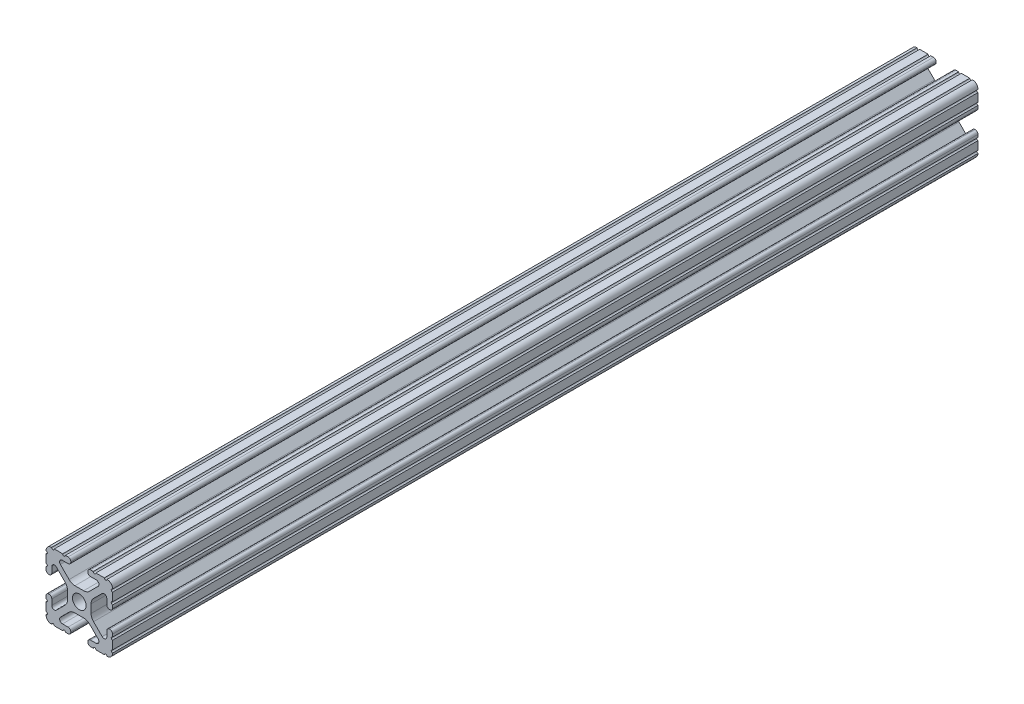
ISO-10303-21;
HEADER;
FILE_DESCRIPTION(('STEP AP214'),'2;1');
FILE_NAME('part.step','',(''),(''),'','','');
FILE_SCHEMA(('AUTOMOTIVE_DESIGN { 1 0 10303 214 1 1 1 1 }'));
ENDSEC;
DATA;
#1=APPLICATION_CONTEXT('core data for automotive mechanical design processes');
#2=APPLICATION_PROTOCOL_DEFINITION('international standard','automotive_design',2000,#1);
#3=PRODUCT_CONTEXT('',#1,'mechanical');
#4=PRODUCT('Part','Part','',(#3));
#5=PRODUCT_RELATED_PRODUCT_CATEGORY('part','',(#4));
#6=PRODUCT_DEFINITION_FORMATION('','',#4);
#7=PRODUCT_DEFINITION_CONTEXT('part definition',#1,'design');
#8=PRODUCT_DEFINITION('design','',#6,#7);
#9=PRODUCT_DEFINITION_SHAPE('','',#8);
#10=(LENGTH_UNIT() NAMED_UNIT(*) SI_UNIT(.MILLI.,.METRE.));
#11=(NAMED_UNIT(*) PLANE_ANGLE_UNIT() SI_UNIT($,.RADIAN.));
#12=(NAMED_UNIT(*) SI_UNIT($,.STERADIAN.) SOLID_ANGLE_UNIT());
#13=UNCERTAINTY_MEASURE_WITH_UNIT(LENGTH_MEASURE(1.E-05),#10,'distance_accuracy_value','');
#14=(GEOMETRIC_REPRESENTATION_CONTEXT(3) GLOBAL_UNCERTAINTY_ASSIGNED_CONTEXT((#13)) GLOBAL_UNIT_ASSIGNED_CONTEXT((#10,
#11,#12)) REPRESENTATION_CONTEXT('',''));
#15=CARTESIAN_POINT('',(0.,0.,0.));
#16=DIRECTION('',(0.,0.,1.));
#17=DIRECTION('',(1.,0.,0.));
#18=AXIS2_PLACEMENT_3D('',#15,#16,#17);
#19=CARTESIAN_POINT('',(-6.41640832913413,-9.40982735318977,165.1));
#20=DIRECTION('',(0.,0.,1.));
#21=DIRECTION('',(1.,0.,0.));
#22=AXIS2_PLACEMENT_3D('',#19,#20,#21);
#23=PLANE('',#22);
#24=CARTESIAN_POINT('',(-6.41640832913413,-9.40982735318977,165.1));
#25=DIRECTION('',(0.,0.,-1.));
#26=DIRECTION('',(1.,0.,0.));
#27=AXIS2_PLACEMENT_3D('',#24,#25,#26);
#28=CIRCLE('',#27,1.08037264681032);
#29=CARTESIAN_POINT('',(-6.41640832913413,-10.4902000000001,165.1));
#30=VERTEX_POINT('',#29);
#31=CARTESIAN_POINT('',(-7.17965049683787,-8.64519250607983,165.1));
#32=VERTEX_POINT('',#31);
#33=EDGE_CURVE('E849',#30,#32,#28,.T.);
#34=ORIENTED_EDGE('',*,*,#33,.T.);
#35=DIRECTION('',(0.707751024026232,0.706461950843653,0.));
#36=VECTOR('',#35,1.);
#37=CARTESIAN_POINT('',(-7.17965049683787,-8.64519250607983,165.1));
#38=LINE('',#37,#36);
#39=CARTESIAN_POINT('',(-3.95227025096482,-5.42369049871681,165.1));
#40=VERTEX_POINT('',#39);
#41=EDGE_CURVE('E357',#32,#40,#38,.T.);
#42=ORIENTED_EDGE('',*,*,#41,.T.);
#43=CARTESIAN_POINT('',(-1.70925355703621,-7.67080000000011,165.1));
#44=DIRECTION('',(0.,0.,-1.));
#45=DIRECTION('',(1.,0.,0.));
#46=AXIS2_PLACEMENT_3D('',#43,#44,#45);
#47=CIRCLE('',#46,3.17500000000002);
#48=CARTESIAN_POINT('',(-1.70925355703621,-4.49580000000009,165.1));
#49=VERTEX_POINT('',#48);
#50=EDGE_CURVE('E1128',#40,#49,#47,.T.);
#51=ORIENTED_EDGE('',*,*,#50,.T.);
#52=DIRECTION('',(1.,0.,0.));
#53=VECTOR('',#52,1.);
#54=CARTESIAN_POINT('',(-1.70925355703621,-4.49580000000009,165.1));
#55=LINE('',#54,#53);
#56=CARTESIAN_POINT('',(1.70925355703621,-4.49580000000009,165.1));
#57=VERTEX_POINT('',#56);
#58=EDGE_CURVE('E1147',#49,#57,#55,.T.);
#59=ORIENTED_EDGE('',*,*,#58,.T.);
#60=CARTESIAN_POINT('',(1.70925355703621,-7.67080000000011,165.1));
#61=DIRECTION('',(0.,0.,-1.));
#62=DIRECTION('',(1.,0.,0.));
#63=AXIS2_PLACEMENT_3D('',#60,#61,#62);
#64=CIRCLE('',#63,3.17500000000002);
#65=CARTESIAN_POINT('',(3.95227025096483,-5.42369049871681,165.1));
#66=VERTEX_POINT('',#65);
#67=EDGE_CURVE('E1144',#57,#66,#64,.T.);
#68=ORIENTED_EDGE('',*,*,#67,.T.);
#69=DIRECTION('',(0.707751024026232,-0.706461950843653,0.));
#70=VECTOR('',#69,1.);
#71=CARTESIAN_POINT('',(3.95227025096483,-5.42369049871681,165.1));
#72=LINE('',#71,#70);
#73=CARTESIAN_POINT('',(7.17965049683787,-8.64519250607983,165.1));
#74=VERTEX_POINT('',#73);
#75=EDGE_CURVE('E1146',#66,#74,#72,.T.);
#76=ORIENTED_EDGE('',*,*,#75,.T.);
#77=CARTESIAN_POINT('',(6.41640832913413,-9.40982735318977,165.1));
#78=DIRECTION('',(0.,0.,-1.));
#79=DIRECTION('',(1.,0.,0.));
#80=AXIS2_PLACEMENT_3D('',#77,#78,#79);
#81=CIRCLE('',#80,1.08037264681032);
#82=CARTESIAN_POINT('',(6.41640832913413,-10.4902000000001,165.1));
#83=VERTEX_POINT('',#82);
#84=EDGE_CURVE('E1149',#74,#83,#81,.T.);
#85=ORIENTED_EDGE('',*,*,#84,.T.);
#86=DIRECTION('',(-1.,0.,0.));
#87=VECTOR('',#86,1.);
#88=CARTESIAN_POINT('',(6.41640832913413,-10.4902000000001,165.1));
#89=LINE('',#88,#87);
#90=CARTESIAN_POINT('',(4.2875124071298,-10.4902000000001,165.1));
#91=VERTEX_POINT('',#90);
#92=EDGE_CURVE('E1155',#83,#91,#89,.T.);
#93=ORIENTED_EDGE('',*,*,#92,.T.);
#94=CARTESIAN_POINT('',(4.2875124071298,-11.5392124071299,165.1));
#95=DIRECTION('',(0.,0.,1.));
#96=DIRECTION('',(1.,0.,0.));
#97=AXIS2_PLACEMENT_3D('',#94,#95,#96);
#98=CIRCLE('',#97,1.04901240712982);
#99=CARTESIAN_POINT('',(3.23849999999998,-11.5392124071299,165.1));
#100=VERTEX_POINT('',#99);
#101=EDGE_CURVE('E1157',#91,#100,#98,.T.);
#102=ORIENTED_EDGE('',*,*,#101,.T.);
#103=DIRECTION('',(0.,-1.,0.));
#104=VECTOR('',#103,1.);
#105=CARTESIAN_POINT('',(3.23849999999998,-11.5392124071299,165.1));
#106=LINE('',#105,#104);
#107=CARTESIAN_POINT('',(3.23849999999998,-11.6509875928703,165.1));
#108=VERTEX_POINT('',#107);
#109=EDGE_CURVE('E1159',#100,#108,#106,.T.);
#110=ORIENTED_EDGE('',*,*,#109,.T.);
#111=CARTESIAN_POINT('',(4.2875124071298,-11.6509875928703,165.1));
#112=DIRECTION('',(0.,0.,1.));
#113=DIRECTION('',(1.,0.,0.));
#114=AXIS2_PLACEMENT_3D('',#111,#112,#113);
#115=CIRCLE('',#114,1.04901240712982);
#116=CARTESIAN_POINT('',(4.2875124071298,-12.7000000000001,165.1));
#117=VERTEX_POINT('',#116);
#118=EDGE_CURVE('E1161',#108,#117,#115,.T.);
#119=ORIENTED_EDGE('',*,*,#118,.T.);
#120=DIRECTION('',(1.,0.,0.));
#121=VECTOR('',#120,1.);
#122=CARTESIAN_POINT('',(4.2875124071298,-12.7000000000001,165.1));
#123=LINE('',#122,#121);
#124=CARTESIAN_POINT('',(5.31712671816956,-12.7000000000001,165.1));
#125=VERTEX_POINT('',#124);
#126=EDGE_CURVE('E1163',#117,#125,#123,.T.);
#127=ORIENTED_EDGE('',*,*,#126,.T.);
#128=CARTESIAN_POINT('',(5.82512671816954,-12.7000000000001,165.1));
#129=DIRECTION('',(0.,0.,-1.));
#130=DIRECTION('',(1.,0.,0.));
#131=AXIS2_PLACEMENT_3D('',#128,#129,#130);
#132=CIRCLE('',#131,0.507999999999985);
#133=CARTESIAN_POINT('',(6.33312671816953,-12.7000000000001,165.1));
#134=VERTEX_POINT('',#133);
#135=EDGE_CURVE('E1165',#125,#134,#132,.T.);
#136=ORIENTED_EDGE('',*,*,#135,.T.);
#137=DIRECTION('',(1.,0.,0.));
#138=VECTOR('',#137,1.);
#139=CARTESIAN_POINT('',(6.33312671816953,-12.7000000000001,165.1));
#140=LINE('',#139,#138);
#141=CARTESIAN_POINT('',(9.55044311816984,-12.7000000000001,165.1));
#142=VERTEX_POINT('',#141);
#143=EDGE_CURVE('E1167',#134,#142,#140,.T.);
#144=ORIENTED_EDGE('',*,*,#143,.T.);
#145=CARTESIAN_POINT('',(10.0584431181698,-12.7000000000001,165.1));
#146=DIRECTION('',(0.,0.,-1.));
#147=DIRECTION('',(1.,0.,0.));
#148=AXIS2_PLACEMENT_3D('',#145,#146,#147);
#149=CIRCLE('',#148,0.507999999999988);
#150=CARTESIAN_POINT('',(10.5664430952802,-12.6998475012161,165.1));
#151=VERTEX_POINT('',#150);
#152=EDGE_CURVE('E1169',#142,#151,#149,.T.);
#153=ORIENTED_EDGE('',*,*,#152,.T.);
#154=CARTESIAN_POINT('',(10.5918000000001,-10.5918000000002,165.1));
#155=DIRECTION('',(0.,0.,1.));
#156=DIRECTION('',(1.,0.,0.));
#157=AXIS2_PLACEMENT_3D('',#154,#155,#156);
#158=CIRCLE('',#157,2.1081999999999);
#159=CARTESIAN_POINT('',(12.699846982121,-10.5663999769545,165.1));
#160=VERTEX_POINT('',#159);
#161=EDGE_CURVE('E1171',#151,#160,#158,.T.);
#162=ORIENTED_EDGE('',*,*,#161,.T.);
#163=CARTESIAN_POINT('',(12.7,-10.0584000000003,165.1));
#164=DIRECTION('',(0.,0.,-1.));
#165=DIRECTION('',(1.,0.,0.));
#166=AXIS2_PLACEMENT_3D('',#163,#164,#165);
#167=CIRCLE('',#166,0.507999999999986);
#168=CARTESIAN_POINT('',(12.7,-9.5504000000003,165.1));
#169=VERTEX_POINT('',#168);
#170=EDGE_CURVE('E1173',#160,#169,#167,.T.);
#171=ORIENTED_EDGE('',*,*,#170,.T.);
#172=DIRECTION('',(0.,1.,0.));
#173=VECTOR('',#172,1.);
#174=CARTESIAN_POINT('',(12.7,-9.5504000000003,165.1));
#175=LINE('',#174,#173);
#176=CARTESIAN_POINT('',(12.7,-6.33308359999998,165.1));
#177=VERTEX_POINT('',#176);
#178=EDGE_CURVE('E1175',#169,#177,#175,.T.);
#179=ORIENTED_EDGE('',*,*,#178,.T.);
#180=CARTESIAN_POINT('',(12.7,-5.8250836,165.1));
#181=DIRECTION('',(0.,0.,-1.));
#182=DIRECTION('',(1.,0.,0.));
#183=AXIS2_PLACEMENT_3D('',#180,#181,#182);
#184=CIRCLE('',#183,0.507999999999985);
#185=CARTESIAN_POINT('',(12.7,-5.31708360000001,165.1));
#186=VERTEX_POINT('',#185);
#187=EDGE_CURVE('E1177',#177,#186,#184,.T.);
#188=ORIENTED_EDGE('',*,*,#187,.T.);
#189=DIRECTION('',(0.,1.,0.));
#190=VECTOR('',#189,1.);
#191=CARTESIAN_POINT('',(12.7,-5.31708360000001,165.1));
#192=LINE('',#191,#190);
#193=CARTESIAN_POINT('',(12.7,-4.28746928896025,165.1));
#194=VERTEX_POINT('',#193);
#195=EDGE_CURVE('E1179',#186,#194,#192,.T.);
#196=ORIENTED_EDGE('',*,*,#195,.T.);
#197=CARTESIAN_POINT('',(11.6509875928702,-4.28746928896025,165.1));
#198=DIRECTION('',(0.,0.,1.));
#199=DIRECTION('',(1.,0.,0.));
#200=AXIS2_PLACEMENT_3D('',#197,#198,#199);
#201=CIRCLE('',#200,1.04901240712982);
#202=CARTESIAN_POINT('',(11.6509875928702,-3.23845688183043,165.1));
#203=VERTEX_POINT('',#202);
#204=EDGE_CURVE('E1181',#194,#203,#201,.T.);
#205=ORIENTED_EDGE('',*,*,#204,.T.);
#206=DIRECTION('',(-1.,0.,0.));
#207=VECTOR('',#206,1.);
#208=CARTESIAN_POINT('',(11.6509875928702,-3.23845688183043,165.1));
#209=LINE('',#208,#207);
#210=CARTESIAN_POINT('',(11.5392124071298,-3.23845688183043,165.1));
#211=VERTEX_POINT('',#210);
#212=EDGE_CURVE('E1183',#203,#211,#209,.T.);
#213=ORIENTED_EDGE('',*,*,#212,.T.);
#214=CARTESIAN_POINT('',(11.5392124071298,-4.28746928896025,165.1));
#215=DIRECTION('',(0.,0.,1.));
#216=DIRECTION('',(1.,0.,0.));
#217=AXIS2_PLACEMENT_3D('',#214,#215,#216);
#218=CIRCLE('',#217,1.04901240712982);
#219=CARTESIAN_POINT('',(10.4902,-4.28746928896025,165.1));
#220=VERTEX_POINT('',#219);
#221=EDGE_CURVE('E1185',#211,#220,#218,.T.);
#222=ORIENTED_EDGE('',*,*,#221,.T.);
#223=DIRECTION('',(0.,-1.,0.));
#224=VECTOR('',#223,1.);
#225=CARTESIAN_POINT('',(10.4902,-4.28746928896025,165.1));
#226=LINE('',#225,#224);
#227=CARTESIAN_POINT('',(10.4902,-6.4020890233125,165.1));
#228=VERTEX_POINT('',#227);
#229=EDGE_CURVE('E1187',#220,#228,#226,.T.);
#230=ORIENTED_EDGE('',*,*,#229,.T.);
#231=CARTESIAN_POINT('',(9.4627890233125,-6.4020890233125,165.1));
#232=DIRECTION('',(0.,0.,-1.));
#233=DIRECTION('',(1.,0.,0.));
#234=AXIS2_PLACEMENT_3D('',#231,#232,#233);
#235=CIRCLE('',#234,1.0274109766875);
#236=CARTESIAN_POINT('',(8.7371313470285,-7.12940893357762,165.1));
#237=VERTEX_POINT('',#236);
#238=EDGE_CURVE('E1189',#228,#237,#235,.T.);
#239=ORIENTED_EDGE('',*,*,#238,.T.);
#240=DIRECTION('',(-0.70791526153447,0.706297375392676,0.));
#241=VECTOR('',#240,1.);
#242=CARTESIAN_POINT('',(8.7371313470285,-7.12940893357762,165.1));
#243=LINE('',#242,#241);
#244=CARTESIAN_POINT('',(5.44100583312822,-3.84081646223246,165.1));
#245=VERTEX_POINT('',#244);
#246=EDGE_CURVE('E1191',#237,#245,#243,.T.);
#247=ORIENTED_EDGE('',*,*,#246,.T.);
#248=CARTESIAN_POINT('',(7.68350000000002,-1.59318550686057,165.1));
#249=DIRECTION('',(0.,0.,-1.));
#250=DIRECTION('',(1.,0.,0.));
#251=AXIS2_PLACEMENT_3D('',#248,#249,#250);
#252=CIRCLE('',#251,3.17500000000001);
#253=CARTESIAN_POINT('',(4.50850000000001,-1.59318550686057,165.1));
#254=VERTEX_POINT('',#253);
#255=EDGE_CURVE('E1193',#245,#254,#252,.T.);
#256=ORIENTED_EDGE('',*,*,#255,.T.);
#257=DIRECTION('',(0.,1.,0.));
#258=VECTOR('',#257,1.);
#259=CARTESIAN_POINT('',(4.5085,-1.59318550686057,165.1));
#260=LINE('',#259,#258);
#261=CARTESIAN_POINT('',(4.50850000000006,1.59318550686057,165.1));
#262=VERTEX_POINT('',#261);
#263=EDGE_CURVE('E1195',#254,#262,#260,.T.);
#264=ORIENTED_EDGE('',*,*,#263,.T.);
#265=CARTESIAN_POINT('',(7.68350000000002,1.59318550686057,165.1));
#266=DIRECTION('',(0.,0.,-1.));
#267=DIRECTION('',(1.,0.,0.));
#268=AXIS2_PLACEMENT_3D('',#265,#266,#267);
#269=CIRCLE('',#268,3.17499999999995);
#270=CARTESIAN_POINT('',(5.44100583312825,3.84081646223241,165.1));
#271=VERTEX_POINT('',#270);
#272=EDGE_CURVE('E1197',#262,#271,#269,.T.);
#273=ORIENTED_EDGE('',*,*,#272,.T.);
#274=DIRECTION('',(0.70791526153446,0.706297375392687,0.));
#275=VECTOR('',#274,1.);
#276=CARTESIAN_POINT('',(5.44100583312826,3.8408164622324,165.1));
#277=LINE('',#276,#275);
#278=CARTESIAN_POINT('',(8.73713134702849,7.12940893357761,165.1));
#279=VERTEX_POINT('',#278);
#280=EDGE_CURVE('E1199',#271,#279,#277,.T.);
#281=ORIENTED_EDGE('',*,*,#280,.T.);
#282=CARTESIAN_POINT('',(9.4627890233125,6.4020890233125,165.1));
#283=DIRECTION('',(0.,0.,-1.));
#284=DIRECTION('',(1.,0.,0.));
#285=AXIS2_PLACEMENT_3D('',#282,#283,#284);
#286=CIRCLE('',#285,1.0274109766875);
#287=CARTESIAN_POINT('',(10.4902,6.4020890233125,165.1));
#288=VERTEX_POINT('',#287);
#289=EDGE_CURVE('E1201',#279,#288,#286,.T.);
#290=ORIENTED_EDGE('',*,*,#289,.T.);
#291=DIRECTION('',(0.,-1.,0.));
#292=VECTOR('',#291,1.);
#293=CARTESIAN_POINT('',(10.4902,6.4020890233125,165.1));
#294=LINE('',#293,#292);
#295=CARTESIAN_POINT('',(10.4902,4.28746928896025,165.1));
#296=VERTEX_POINT('',#295);
#297=EDGE_CURVE('E1203',#288,#296,#294,.T.);
#298=ORIENTED_EDGE('',*,*,#297,.T.);
#299=CARTESIAN_POINT('',(11.5392124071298,4.28746928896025,165.1));
#300=DIRECTION('',(0.,0.,1.));
#301=DIRECTION('',(1.,0.,0.));
#302=AXIS2_PLACEMENT_3D('',#299,#300,#301);
#303=CIRCLE('',#302,1.04901240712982);
#304=CARTESIAN_POINT('',(11.5392124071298,3.23845688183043,165.1));
#305=VERTEX_POINT('',#304);
#306=EDGE_CURVE('E1205',#296,#305,#303,.T.);
#307=ORIENTED_EDGE('',*,*,#306,.T.);
#308=DIRECTION('',(1.,0.,0.));
#309=VECTOR('',#308,1.);
#310=CARTESIAN_POINT('',(11.5392124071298,3.23845688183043,165.1));
#311=LINE('',#310,#309);
#312=CARTESIAN_POINT('',(11.6509875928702,3.23845688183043,165.1));
#313=VERTEX_POINT('',#312);
#314=EDGE_CURVE('E1207',#305,#313,#311,.T.);
#315=ORIENTED_EDGE('',*,*,#314,.T.);
#316=CARTESIAN_POINT('',(11.6509875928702,4.28746928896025,165.1));
#317=DIRECTION('',(0.,0.,1.));
#318=DIRECTION('',(1.,0.,0.));
#319=AXIS2_PLACEMENT_3D('',#316,#317,#318);
#320=CIRCLE('',#319,1.04901240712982);
#321=CARTESIAN_POINT('',(12.7,4.28746928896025,165.1));
#322=VERTEX_POINT('',#321);
#323=EDGE_CURVE('E1209',#313,#322,#320,.T.);
#324=ORIENTED_EDGE('',*,*,#323,.T.);
#325=DIRECTION('',(0.,1.,0.));
#326=VECTOR('',#325,1.);
#327=CARTESIAN_POINT('',(12.7,4.28746928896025,165.1));
#328=LINE('',#327,#326);
#329=CARTESIAN_POINT('',(12.7,5.31708360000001,165.1));
#330=VERTEX_POINT('',#329);
#331=EDGE_CURVE('E1211',#322,#330,#328,.T.);
#332=ORIENTED_EDGE('',*,*,#331,.T.);
#333=CARTESIAN_POINT('',(12.7,5.8250836,165.1));
#334=DIRECTION('',(0.,0.,-1.));
#335=DIRECTION('',(1.,0.,0.));
#336=AXIS2_PLACEMENT_3D('',#333,#334,#335);
#337=CIRCLE('',#336,0.507999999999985);
#338=CARTESIAN_POINT('',(12.7,6.33308359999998,165.1));
#339=VERTEX_POINT('',#338);
#340=EDGE_CURVE('E1213',#330,#339,#337,.T.);
#341=ORIENTED_EDGE('',*,*,#340,.T.);
#342=DIRECTION('',(0.,1.,0.));
#343=VECTOR('',#342,1.);
#344=CARTESIAN_POINT('',(12.7,6.33308359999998,165.1));
#345=LINE('',#344,#343);
#346=CARTESIAN_POINT('',(12.7,9.55040000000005,165.1));
#347=VERTEX_POINT('',#346);
#348=EDGE_CURVE('E1215',#339,#347,#345,.T.);
#349=ORIENTED_EDGE('',*,*,#348,.T.);
#350=CARTESIAN_POINT('',(12.7,10.0584000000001,165.1));
#351=DIRECTION('',(0.,0.,-1.));
#352=DIRECTION('',(1.,0.,0.));
#353=AXIS2_PLACEMENT_3D('',#350,#351,#352);
#354=CIRCLE('',#353,0.508000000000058);
#355=CARTESIAN_POINT('',(12.699846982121,10.5663999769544,165.1));
#356=VERTEX_POINT('',#355);
#357=EDGE_CURVE('E1217',#347,#356,#354,.T.);
#358=ORIENTED_EDGE('',*,*,#357,.T.);
#359=CARTESIAN_POINT('',(10.5918000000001,10.5918000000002,165.1));
#360=DIRECTION('',(0.,0.,1.));
#361=DIRECTION('',(1.,0.,0.));
#362=AXIS2_PLACEMENT_3D('',#359,#360,#361);
#363=CIRCLE('',#362,2.1081999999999);
#364=CARTESIAN_POINT('',(10.5664430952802,12.6998475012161,165.1));
#365=VERTEX_POINT('',#364);
#366=EDGE_CURVE('E1219',#356,#365,#363,.T.);
#367=ORIENTED_EDGE('',*,*,#366,.T.);
#368=CARTESIAN_POINT('',(10.0584431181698,12.7000000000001,165.1));
#369=DIRECTION('',(0.,0.,-1.));
#370=DIRECTION('',(1.,0.,0.));
#371=AXIS2_PLACEMENT_3D('',#368,#369,#370);
#372=CIRCLE('',#371,0.507999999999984);
#373=CARTESIAN_POINT('',(9.55044311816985,12.7000000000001,165.1));
#374=VERTEX_POINT('',#373);
#375=EDGE_CURVE('E1221',#365,#374,#372,.T.);
#376=ORIENTED_EDGE('',*,*,#375,.T.);
#377=DIRECTION('',(-1.,0.,0.));
#378=VECTOR('',#377,1.);
#379=CARTESIAN_POINT('',(9.55044311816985,12.7000000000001,165.1));
#380=LINE('',#379,#378);
#381=CARTESIAN_POINT('',(6.33312671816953,12.7000000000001,165.1));
#382=VERTEX_POINT('',#381);
#383=EDGE_CURVE('E1223',#374,#382,#380,.T.);
#384=ORIENTED_EDGE('',*,*,#383,.T.);
#385=CARTESIAN_POINT('',(5.82512671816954,12.7000000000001,165.1));
#386=DIRECTION('',(0.,0.,-1.));
#387=DIRECTION('',(1.,0.,0.));
#388=AXIS2_PLACEMENT_3D('',#385,#386,#387);
#389=CIRCLE('',#388,0.507999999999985);
#390=CARTESIAN_POINT('',(5.31712671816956,12.7000000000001,165.1));
#391=VERTEX_POINT('',#390);
#392=EDGE_CURVE('E1225',#382,#391,#389,.T.);
#393=ORIENTED_EDGE('',*,*,#392,.T.);
#394=DIRECTION('',(-1.,0.,0.));
#395=VECTOR('',#394,1.);
#396=CARTESIAN_POINT('',(5.31712671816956,12.7000000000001,165.1));
#397=LINE('',#396,#395);
#398=CARTESIAN_POINT('',(4.2875124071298,12.7000000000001,165.1));
#399=VERTEX_POINT('',#398);
#400=EDGE_CURVE('E1227',#391,#399,#397,.T.);
#401=ORIENTED_EDGE('',*,*,#400,.T.);
#402=CARTESIAN_POINT('',(4.2875124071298,11.6509875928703,165.1));
#403=DIRECTION('',(0.,0.,1.));
#404=DIRECTION('',(1.,0.,0.));
#405=AXIS2_PLACEMENT_3D('',#402,#403,#404);
#406=CIRCLE('',#405,1.04901240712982);
#407=CARTESIAN_POINT('',(3.23849999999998,11.6509875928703,165.1));
#408=VERTEX_POINT('',#407);
#409=EDGE_CURVE('E1229',#399,#408,#406,.T.);
#410=ORIENTED_EDGE('',*,*,#409,.T.);
#411=DIRECTION('',(0.,-1.,0.));
#412=VECTOR('',#411,1.);
#413=CARTESIAN_POINT('',(3.23849999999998,11.6509875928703,165.1));
#414=LINE('',#413,#412);
#415=CARTESIAN_POINT('',(3.23849999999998,11.5392124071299,165.1));
#416=VERTEX_POINT('',#415);
#417=EDGE_CURVE('E1231',#408,#416,#414,.T.);
#418=ORIENTED_EDGE('',*,*,#417,.T.);
#419=CARTESIAN_POINT('',(4.2875124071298,11.5392124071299,165.1));
#420=DIRECTION('',(0.,0.,1.));
#421=DIRECTION('',(1.,0.,0.));
#422=AXIS2_PLACEMENT_3D('',#419,#420,#421);
#423=CIRCLE('',#422,1.04901240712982);
#424=CARTESIAN_POINT('',(4.2875124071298,10.4902000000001,165.1));
#425=VERTEX_POINT('',#424);
#426=EDGE_CURVE('E1233',#416,#425,#423,.T.);
#427=ORIENTED_EDGE('',*,*,#426,.T.);
#428=DIRECTION('',(1.,0.,0.));
#429=VECTOR('',#428,1.);
#430=CARTESIAN_POINT('',(4.2875124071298,10.4902000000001,165.1));
#431=LINE('',#430,#429);
#432=CARTESIAN_POINT('',(6.47678859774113,10.4902000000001,165.1));
#433=VERTEX_POINT('',#432);
#434=EDGE_CURVE('E1235',#425,#433,#431,.T.);
#435=ORIENTED_EDGE('',*,*,#434,.T.);
#436=CARTESIAN_POINT('',(6.47678859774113,9.45629072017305,165.1));
#437=DIRECTION('',(0.,0.,-1.));
#438=DIRECTION('',(1.,0.,0.));
#439=AXIS2_PLACEMENT_3D('',#436,#437,#438);
#440=CIRCLE('',#439,1.03390927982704);
#441=CARTESIAN_POINT('',(7.2070360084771,8.72437056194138,165.1));
#442=VERTEX_POINT('',#441);
#443=EDGE_CURVE('E1237',#433,#442,#440,.T.);
#444=ORIENTED_EDGE('',*,*,#443,.T.);
#445=DIRECTION('',(-0.707915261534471,-0.706297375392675,0.));
#446=VECTOR('',#445,1.);
#447=CARTESIAN_POINT('',(7.2070360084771,8.72437056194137,165.1));
#448=LINE('',#447,#446);
#449=CARTESIAN_POINT('',(3.89827256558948,5.42316904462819,165.1));
#450=VERTEX_POINT('',#449);
#451=EDGE_CURVE('E1239',#442,#450,#448,.T.);
#452=ORIENTED_EDGE('',*,*,#451,.T.);
#453=CARTESIAN_POINT('',(1.65577839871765,7.67080000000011,165.1));
#454=DIRECTION('',(0.,0.,-1.));
#455=DIRECTION('',(1.,0.,0.));
#456=AXIS2_PLACEMENT_3D('',#453,#454,#455);
#457=CIRCLE('',#456,3.17500000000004);
#458=CARTESIAN_POINT('',(1.65577839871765,4.49580000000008,165.1));
#459=VERTEX_POINT('',#458);
#460=EDGE_CURVE('E1241',#450,#459,#457,.T.);
#461=ORIENTED_EDGE('',*,*,#460,.T.);
#462=DIRECTION('',(-1.,0.,0.));
#463=VECTOR('',#462,1.);
#464=CARTESIAN_POINT('',(1.65577839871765,4.49580000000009,165.1));
#465=LINE('',#464,#463);
#466=CARTESIAN_POINT('',(-1.65577839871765,4.49580000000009,165.1));
#467=VERTEX_POINT('',#466);
#468=EDGE_CURVE('E1243',#459,#467,#465,.T.);
#469=ORIENTED_EDGE('',*,*,#468,.T.);
#470=CARTESIAN_POINT('',(-1.65577839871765,7.67080000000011,165.1));
#471=DIRECTION('',(0.,0.,-1.));
#472=DIRECTION('',(1.,0.,0.));
#473=AXIS2_PLACEMENT_3D('',#470,#471,#472);
#474=CIRCLE('',#473,3.17500000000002);
#475=CARTESIAN_POINT('',(-3.89827256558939,5.42316904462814,165.1));
#476=VERTEX_POINT('',#475);
#477=EDGE_CURVE('E1245',#467,#476,#474,.T.);
#478=ORIENTED_EDGE('',*,*,#477,.T.);
#479=DIRECTION('',(-0.707915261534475,0.706297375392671,0.));
#480=VECTOR('',#479,1.);
#481=CARTESIAN_POINT('',(-3.89827256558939,5.42316904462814,165.1));
#482=LINE('',#481,#480);
#483=CARTESIAN_POINT('',(-7.20703600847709,8.72437056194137,165.1));
#484=VERTEX_POINT('',#483);
#485=EDGE_CURVE('E1247',#476,#484,#482,.T.);
#486=ORIENTED_EDGE('',*,*,#485,.T.);
#487=CARTESIAN_POINT('',(-6.47678859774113,9.45629072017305,165.1));
#488=DIRECTION('',(0.,0.,-1.));
#489=DIRECTION('',(1.,0.,0.));
#490=AXIS2_PLACEMENT_3D('',#487,#488,#489);
#491=CIRCLE('',#490,1.03390927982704);
#492=CARTESIAN_POINT('',(-6.47678859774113,10.4902000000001,165.1));
#493=VERTEX_POINT('',#492);
#494=EDGE_CURVE('E1249',#484,#493,#491,.T.);
#495=ORIENTED_EDGE('',*,*,#494,.T.);
#496=DIRECTION('',(1.,0.,0.));
#497=VECTOR('',#496,1.);
#498=CARTESIAN_POINT('',(-6.47678859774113,10.4902000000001,165.1));
#499=LINE('',#498,#497);
#500=CARTESIAN_POINT('',(-4.2875124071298,10.4902000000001,165.1));
#501=VERTEX_POINT('',#500);
#502=EDGE_CURVE('E1251',#493,#501,#499,.T.);
#503=ORIENTED_EDGE('',*,*,#502,.T.);
#504=CARTESIAN_POINT('',(-4.2875124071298,11.5392124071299,165.1));
#505=DIRECTION('',(0.,0.,1.));
#506=DIRECTION('',(1.,0.,0.));
#507=AXIS2_PLACEMENT_3D('',#504,#505,#506);
#508=CIRCLE('',#507,1.04901240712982);
#509=CARTESIAN_POINT('',(-3.23849999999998,11.5392124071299,165.1));
#510=VERTEX_POINT('',#509);
#511=EDGE_CURVE('E1253',#501,#510,#508,.T.);
#512=ORIENTED_EDGE('',*,*,#511,.T.);
#513=DIRECTION('',(0.,1.,0.));
#514=VECTOR('',#513,1.);
#515=CARTESIAN_POINT('',(-3.23849999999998,11.5392124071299,165.1));
#516=LINE('',#515,#514);
#517=CARTESIAN_POINT('',(-3.23849999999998,11.6509875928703,165.1));
#518=VERTEX_POINT('',#517);
#519=EDGE_CURVE('E1255',#510,#518,#516,.T.);
#520=ORIENTED_EDGE('',*,*,#519,.T.);
#521=CARTESIAN_POINT('',(-4.2875124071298,11.6509875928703,165.1));
#522=DIRECTION('',(0.,0.,1.));
#523=DIRECTION('',(1.,0.,0.));
#524=AXIS2_PLACEMENT_3D('',#521,#522,#523);
#525=CIRCLE('',#524,1.04901240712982);
#526=CARTESIAN_POINT('',(-4.2875124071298,12.7000000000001,165.1));
#527=VERTEX_POINT('',#526);
#528=EDGE_CURVE('E1257',#518,#527,#525,.T.);
#529=ORIENTED_EDGE('',*,*,#528,.T.);
#530=DIRECTION('',(-1.,0.,0.));
#531=VECTOR('',#530,1.);
#532=CARTESIAN_POINT('',(-4.2875124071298,12.7000000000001,165.1));
#533=LINE('',#532,#531);
#534=CARTESIAN_POINT('',(-5.31712671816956,12.7000000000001,165.1));
#535=VERTEX_POINT('',#534);
#536=EDGE_CURVE('E1259',#527,#535,#533,.T.);
#537=ORIENTED_EDGE('',*,*,#536,.T.);
#538=CARTESIAN_POINT('',(-5.82512671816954,12.7000000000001,165.1));
#539=DIRECTION('',(0.,0.,-1.));
#540=DIRECTION('',(1.,0.,0.));
#541=AXIS2_PLACEMENT_3D('',#538,#539,#540);
#542=CIRCLE('',#541,0.507999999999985);
#543=CARTESIAN_POINT('',(-6.33312671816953,12.7000000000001,165.1));
#544=VERTEX_POINT('',#543);
#545=EDGE_CURVE('E1261',#535,#544,#542,.T.);
#546=ORIENTED_EDGE('',*,*,#545,.T.);
#547=DIRECTION('',(-1.,0.,0.));
#548=VECTOR('',#547,1.);
#549=CARTESIAN_POINT('',(-6.33312671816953,12.7000000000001,165.1));
#550=LINE('',#549,#548);
#551=CARTESIAN_POINT('',(-9.55044311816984,12.7000000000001,165.1));
#552=VERTEX_POINT('',#551);
#553=EDGE_CURVE('E1263',#544,#552,#550,.T.);
#554=ORIENTED_EDGE('',*,*,#553,.T.);
#555=CARTESIAN_POINT('',(-10.0584431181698,12.7000000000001,165.1));
#556=DIRECTION('',(0.,0.,-1.));
#557=DIRECTION('',(1.,0.,0.));
#558=AXIS2_PLACEMENT_3D('',#555,#556,#557);
#559=CIRCLE('',#558,0.507999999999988);
#560=CARTESIAN_POINT('',(-10.5664430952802,12.6998475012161,165.1));
#561=VERTEX_POINT('',#560);
#562=EDGE_CURVE('E1265',#552,#561,#559,.T.);
#563=ORIENTED_EDGE('',*,*,#562,.T.);
#564=CARTESIAN_POINT('',(-10.5918000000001,10.5918000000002,165.1));
#565=DIRECTION('',(0.,0.,1.));
#566=DIRECTION('',(1.,0.,0.));
#567=AXIS2_PLACEMENT_3D('',#564,#565,#566);
#568=CIRCLE('',#567,2.1081999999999);
#569=CARTESIAN_POINT('',(-12.699846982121,10.5663999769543,165.1));
#570=VERTEX_POINT('',#569);
#571=EDGE_CURVE('E1267',#561,#570,#568,.T.);
#572=ORIENTED_EDGE('',*,*,#571,.T.);
#573=CARTESIAN_POINT('',(-12.7,10.0584000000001,165.1));
#574=DIRECTION('',(0.,0.,-1.));
#575=DIRECTION('',(1.,0.,0.));
#576=AXIS2_PLACEMENT_3D('',#573,#574,#575);
#577=CIRCLE('',#576,0.50799999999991);
#578=CARTESIAN_POINT('',(-12.7,9.55040000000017,165.1));
#579=VERTEX_POINT('',#578);
#580=EDGE_CURVE('E1269',#570,#579,#577,.T.);
#581=ORIENTED_EDGE('',*,*,#580,.T.);
#582=DIRECTION('',(0.,-1.,0.));
#583=VECTOR('',#582,1.);
#584=CARTESIAN_POINT('',(-12.7,9.5504000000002,165.1));
#585=LINE('',#584,#583);
#586=CARTESIAN_POINT('',(-12.7,6.33308359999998,165.1));
#587=VERTEX_POINT('',#586);
#588=EDGE_CURVE('E1271',#579,#587,#585,.T.);
#589=ORIENTED_EDGE('',*,*,#588,.T.);
#590=CARTESIAN_POINT('',(-12.7,5.8250836,165.1));
#591=DIRECTION('',(0.,0.,-1.));
#592=DIRECTION('',(1.,0.,0.));
#593=AXIS2_PLACEMENT_3D('',#590,#591,#592);
#594=CIRCLE('',#593,0.507999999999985);
#595=CARTESIAN_POINT('',(-12.7,5.31708360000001,165.1));
#596=VERTEX_POINT('',#595);
#597=EDGE_CURVE('E1273',#587,#596,#594,.T.);
#598=ORIENTED_EDGE('',*,*,#597,.T.);
#599=DIRECTION('',(0.,-1.,0.));
#600=VECTOR('',#599,1.);
#601=CARTESIAN_POINT('',(-12.7,5.31708360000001,165.1));
#602=LINE('',#601,#600);
#603=CARTESIAN_POINT('',(-12.7,4.28746928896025,165.1));
#604=VERTEX_POINT('',#603);
#605=EDGE_CURVE('E1275',#596,#604,#602,.T.);
#606=ORIENTED_EDGE('',*,*,#605,.T.);
#607=CARTESIAN_POINT('',(-11.6509875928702,4.28746928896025,165.1));
#608=DIRECTION('',(0.,0.,1.));
#609=DIRECTION('',(1.,0.,0.));
#610=AXIS2_PLACEMENT_3D('',#607,#608,#609);
#611=CIRCLE('',#610,1.04901240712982);
#612=CARTESIAN_POINT('',(-11.6509875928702,3.23845688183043,165.1));
#613=VERTEX_POINT('',#612);
#614=EDGE_CURVE('E1277',#604,#613,#611,.T.);
#615=ORIENTED_EDGE('',*,*,#614,.T.);
#616=DIRECTION('',(1.,0.,0.));
#617=VECTOR('',#616,1.);
#618=CARTESIAN_POINT('',(-11.6509875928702,3.23845688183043,165.1));
#619=LINE('',#618,#617);
#620=CARTESIAN_POINT('',(-11.5392124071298,3.23845688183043,165.1));
#621=VERTEX_POINT('',#620);
#622=EDGE_CURVE('E1279',#613,#621,#619,.T.);
#623=ORIENTED_EDGE('',*,*,#622,.T.);
#624=CARTESIAN_POINT('',(-11.5392124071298,4.28746928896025,165.1));
#625=DIRECTION('',(0.,0.,1.));
#626=DIRECTION('',(1.,0.,0.));
#627=AXIS2_PLACEMENT_3D('',#624,#625,#626);
#628=CIRCLE('',#627,1.04901240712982);
#629=CARTESIAN_POINT('',(-10.4902,4.28746928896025,165.1));
#630=VERTEX_POINT('',#629);
#631=EDGE_CURVE('E1281',#621,#630,#628,.T.);
#632=ORIENTED_EDGE('',*,*,#631,.T.);
#633=DIRECTION('',(0.,1.,0.));
#634=VECTOR('',#633,1.);
#635=CARTESIAN_POINT('',(-10.4902,4.28746928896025,165.1));
#636=LINE('',#635,#634);
#637=CARTESIAN_POINT('',(-10.4902,6.4020890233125,165.1));
#638=VERTEX_POINT('',#637);
#639=EDGE_CURVE('E1283',#630,#638,#636,.T.);
#640=ORIENTED_EDGE('',*,*,#639,.T.);
#641=CARTESIAN_POINT('',(-9.4627890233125,6.4020890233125,165.1));
#642=DIRECTION('',(0.,0.,-1.));
#643=DIRECTION('',(1.,0.,0.));
#644=AXIS2_PLACEMENT_3D('',#641,#642,#643);
#645=CIRCLE('',#644,1.0274109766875);
#646=CARTESIAN_POINT('',(-8.73713134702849,7.12940893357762,165.1));
#647=VERTEX_POINT('',#646);
#648=EDGE_CURVE('E1285',#638,#647,#645,.T.);
#649=ORIENTED_EDGE('',*,*,#648,.T.);
#650=DIRECTION('',(0.707915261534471,-0.706297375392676,0.));
#651=VECTOR('',#650,1.);
#652=CARTESIAN_POINT('',(-8.73713134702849,7.12940893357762,165.1));
#653=LINE('',#652,#651);
#654=CARTESIAN_POINT('',(-5.44100583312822,3.84081646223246,165.1));
#655=VERTEX_POINT('',#654);
#656=EDGE_CURVE('E1287',#647,#655,#653,.T.);
#657=ORIENTED_EDGE('',*,*,#656,.T.);
#658=CARTESIAN_POINT('',(-7.68350000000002,1.59318550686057,165.1));
#659=DIRECTION('',(0.,0.,-1.));
#660=DIRECTION('',(1.,0.,0.));
#661=AXIS2_PLACEMENT_3D('',#658,#659,#660);
#662=CIRCLE('',#661,3.17500000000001);
#663=CARTESIAN_POINT('',(-4.50850000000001,1.59318550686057,165.1));
#664=VERTEX_POINT('',#663);
#665=EDGE_CURVE('E1289',#655,#664,#662,.T.);
#666=ORIENTED_EDGE('',*,*,#665,.T.);
#667=DIRECTION('',(0.,-1.,0.));
#668=VECTOR('',#667,1.);
#669=CARTESIAN_POINT('',(-4.5085,1.59318550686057,165.1));
#670=LINE('',#669,#668);
#671=CARTESIAN_POINT('',(-4.5085,-1.59318550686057,165.1));
#672=VERTEX_POINT('',#671);
#673=EDGE_CURVE('E1291',#664,#672,#670,.T.);
#674=ORIENTED_EDGE('',*,*,#673,.T.);
#675=CARTESIAN_POINT('',(-7.68350000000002,-1.59318550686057,165.1));
#676=DIRECTION('',(0.,0.,-1.));
#677=DIRECTION('',(1.,0.,0.));
#678=AXIS2_PLACEMENT_3D('',#675,#676,#677);
#679=CIRCLE('',#678,3.17500000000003);
#680=CARTESIAN_POINT('',(-5.44100583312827,-3.84081646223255,165.1));
#681=VERTEX_POINT('',#680);
#682=EDGE_CURVE('E1293',#672,#681,#679,.T.);
#683=ORIENTED_EDGE('',*,*,#682,.T.);
#684=DIRECTION('',(-0.707915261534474,-0.706297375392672,0.));
#685=VECTOR('',#684,1.);
#686=CARTESIAN_POINT('',(-5.44100583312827,-3.84081646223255,165.1));
#687=LINE('',#686,#685);
#688=CARTESIAN_POINT('',(-8.7371313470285,-7.12940893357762,165.1));
#689=VERTEX_POINT('',#688);
#690=EDGE_CURVE('E1295',#681,#689,#687,.T.);
#691=ORIENTED_EDGE('',*,*,#690,.T.);
#692=CARTESIAN_POINT('',(-9.4627890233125,-6.4020890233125,165.1));
#693=DIRECTION('',(0.,0.,-1.));
#694=DIRECTION('',(1.,0.,0.));
#695=AXIS2_PLACEMENT_3D('',#692,#693,#694);
#696=CIRCLE('',#695,1.0274109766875);
#697=CARTESIAN_POINT('',(-10.4902,-6.4020890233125,165.1));
#698=VERTEX_POINT('',#697);
#699=EDGE_CURVE('E1297',#689,#698,#696,.T.);
#700=ORIENTED_EDGE('',*,*,#699,.T.);
#701=DIRECTION('',(0.,1.,0.));
#702=VECTOR('',#701,1.);
#703=CARTESIAN_POINT('',(-10.4902,-6.4020890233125,165.1));
#704=LINE('',#703,#702);
#705=CARTESIAN_POINT('',(-10.4902,-4.28746928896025,165.1));
#706=VERTEX_POINT('',#705);
#707=EDGE_CURVE('E1299',#698,#706,#704,.T.);
#708=ORIENTED_EDGE('',*,*,#707,.T.);
#709=CARTESIAN_POINT('',(-11.5392124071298,-4.28746928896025,165.1));
#710=DIRECTION('',(0.,0.,1.));
#711=DIRECTION('',(1.,0.,0.));
#712=AXIS2_PLACEMENT_3D('',#709,#710,#711);
#713=CIRCLE('',#712,1.04901240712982);
#714=CARTESIAN_POINT('',(-11.5392124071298,-3.23845688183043,165.1));
#715=VERTEX_POINT('',#714);
#716=EDGE_CURVE('E1301',#706,#715,#713,.T.);
#717=ORIENTED_EDGE('',*,*,#716,.T.);
#718=DIRECTION('',(-1.,0.,0.));
#719=VECTOR('',#718,1.);
#720=CARTESIAN_POINT('',(-11.5392124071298,-3.23845688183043,165.1));
#721=LINE('',#720,#719);
#722=CARTESIAN_POINT('',(-11.6509875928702,-3.23845688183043,165.1));
#723=VERTEX_POINT('',#722);
#724=EDGE_CURVE('E1303',#715,#723,#721,.T.);
#725=ORIENTED_EDGE('',*,*,#724,.T.);
#726=CARTESIAN_POINT('',(-11.6509875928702,-4.28746928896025,165.1));
#727=DIRECTION('',(0.,0.,1.));
#728=DIRECTION('',(1.,0.,0.));
#729=AXIS2_PLACEMENT_3D('',#726,#727,#728);
#730=CIRCLE('',#729,1.04901240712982);
#731=CARTESIAN_POINT('',(-12.7,-4.28746928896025,165.1));
#732=VERTEX_POINT('',#731);
#733=EDGE_CURVE('E1305',#723,#732,#730,.T.);
#734=ORIENTED_EDGE('',*,*,#733,.T.);
#735=DIRECTION('',(0.,-1.,0.));
#736=VECTOR('',#735,1.);
#737=CARTESIAN_POINT('',(-12.7,-4.28746928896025,165.1));
#738=LINE('',#737,#736);
#739=CARTESIAN_POINT('',(-12.7,-5.31708360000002,165.1));
#740=VERTEX_POINT('',#739);
#741=EDGE_CURVE('E1307',#732,#740,#738,.T.);
#742=ORIENTED_EDGE('',*,*,#741,.T.);
#743=CARTESIAN_POINT('',(-12.7,-5.8250836,165.1));
#744=DIRECTION('',(0.,0.,-1.));
#745=DIRECTION('',(1.,0.,0.));
#746=AXIS2_PLACEMENT_3D('',#743,#744,#745);
#747=CIRCLE('',#746,0.507999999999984);
#748=CARTESIAN_POINT('',(-12.7,-6.33308359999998,165.1));
#749=VERTEX_POINT('',#748);
#750=EDGE_CURVE('E1309',#740,#749,#747,.T.);
#751=ORIENTED_EDGE('',*,*,#750,.T.);
#752=DIRECTION('',(0.,-1.,0.));
#753=VECTOR('',#752,1.);
#754=CARTESIAN_POINT('',(-12.7,-6.33308359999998,165.1));
#755=LINE('',#754,#753);
#756=CARTESIAN_POINT('',(-12.7,-9.5504000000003,165.1));
#757=VERTEX_POINT('',#756);
#758=EDGE_CURVE('E1311',#749,#757,#755,.T.);
#759=ORIENTED_EDGE('',*,*,#758,.T.);
#760=CARTESIAN_POINT('',(-12.7,-10.0584000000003,165.1));
#761=DIRECTION('',(0.,0.,-1.));
#762=DIRECTION('',(1.,0.,0.));
#763=AXIS2_PLACEMENT_3D('',#760,#761,#762);
#764=CIRCLE('',#763,0.507999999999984);
#765=CARTESIAN_POINT('',(-12.699846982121,-10.5663999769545,165.1));
#766=VERTEX_POINT('',#765);
#767=EDGE_CURVE('E1313',#757,#766,#764,.T.);
#768=ORIENTED_EDGE('',*,*,#767,.T.);
#769=CARTESIAN_POINT('',(-10.5918000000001,-10.5918000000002,165.1));
#770=DIRECTION('',(0.,0.,1.));
#771=DIRECTION('',(1.,0.,0.));
#772=AXIS2_PLACEMENT_3D('',#769,#770,#771);
#773=CIRCLE('',#772,2.1081999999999);
#774=CARTESIAN_POINT('',(-10.5664430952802,-12.6998475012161,165.1));
#775=VERTEX_POINT('',#774);
#776=EDGE_CURVE('E1315',#766,#775,#773,.T.);
#777=ORIENTED_EDGE('',*,*,#776,.T.);
#778=CARTESIAN_POINT('',(-10.0584431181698,-12.7000000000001,165.1));
#779=DIRECTION('',(0.,0.,-1.));
#780=DIRECTION('',(1.,0.,0.));
#781=AXIS2_PLACEMENT_3D('',#778,#779,#780);
#782=CIRCLE('',#781,0.507999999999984);
#783=CARTESIAN_POINT('',(-9.55044311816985,-12.7000000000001,165.1));
#784=VERTEX_POINT('',#783);
#785=EDGE_CURVE('E1317',#775,#784,#782,.T.);
#786=ORIENTED_EDGE('',*,*,#785,.T.);
#787=DIRECTION('',(1.,0.,0.));
#788=VECTOR('',#787,1.);
#789=CARTESIAN_POINT('',(-9.55044311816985,-12.7000000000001,165.1));
#790=LINE('',#789,#788);
#791=CARTESIAN_POINT('',(-6.33312671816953,-12.7000000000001,165.1));
#792=VERTEX_POINT('',#791);
#793=EDGE_CURVE('E1319',#784,#792,#790,.T.);
#794=ORIENTED_EDGE('',*,*,#793,.T.);
#795=CARTESIAN_POINT('',(-5.82512671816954,-12.7000000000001,165.1));
#796=DIRECTION('',(0.,0.,-1.));
#797=DIRECTION('',(1.,0.,0.));
#798=AXIS2_PLACEMENT_3D('',#795,#796,#797);
#799=CIRCLE('',#798,0.507999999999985);
#800=CARTESIAN_POINT('',(-5.31712671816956,-12.7000000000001,165.1));
#801=VERTEX_POINT('',#800);
#802=EDGE_CURVE('E1321',#792,#801,#799,.T.);
#803=ORIENTED_EDGE('',*,*,#802,.T.);
#804=DIRECTION('',(1.,0.,0.));
#805=VECTOR('',#804,1.);
#806=CARTESIAN_POINT('',(-5.31712671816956,-12.7000000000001,165.1));
#807=LINE('',#806,#805);
#808=CARTESIAN_POINT('',(-4.2875124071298,-12.7000000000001,165.1));
#809=VERTEX_POINT('',#808);
#810=EDGE_CURVE('E1323',#801,#809,#807,.T.);
#811=ORIENTED_EDGE('',*,*,#810,.T.);
#812=CARTESIAN_POINT('',(-4.2875124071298,-11.6509875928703,165.1));
#813=DIRECTION('',(0.,0.,1.));
#814=DIRECTION('',(1.,0.,0.));
#815=AXIS2_PLACEMENT_3D('',#812,#813,#814);
#816=CIRCLE('',#815,1.04901240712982);
#817=CARTESIAN_POINT('',(-3.23849999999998,-11.6509875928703,165.1));
#818=VERTEX_POINT('',#817);
#819=EDGE_CURVE('E640',#809,#818,#816,.T.);
#820=ORIENTED_EDGE('',*,*,#819,.T.);
#821=DIRECTION('',(0.,1.,0.));
#822=VECTOR('',#821,1.);
#823=CARTESIAN_POINT('',(-3.23849999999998,-11.6509875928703,165.1));
#824=LINE('',#823,#822);
#825=CARTESIAN_POINT('',(-3.23849999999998,-11.5392124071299,165.1));
#826=VERTEX_POINT('',#825);
#827=EDGE_CURVE('E634',#818,#826,#824,.T.);
#828=ORIENTED_EDGE('',*,*,#827,.T.);
#829=CARTESIAN_POINT('',(-4.2875124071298,-11.5392124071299,165.1));
#830=DIRECTION('',(0.,0.,1.));
#831=DIRECTION('',(1.,0.,0.));
#832=AXIS2_PLACEMENT_3D('',#829,#830,#831);
#833=CIRCLE('',#832,1.04901240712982);
#834=CARTESIAN_POINT('',(-4.2875124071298,-10.4902000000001,165.1));
#835=VERTEX_POINT('',#834);
#836=EDGE_CURVE('E638',#826,#835,#833,.T.);
#837=ORIENTED_EDGE('',*,*,#836,.T.);
#838=DIRECTION('',(-1.,0.,0.));
#839=VECTOR('',#838,1.);
#840=CARTESIAN_POINT('',(-4.2875124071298,-10.4902000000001,165.1));
#841=LINE('',#840,#839);
#842=EDGE_CURVE('E50',#835,#30,#841,.T.);
#843=ORIENTED_EDGE('',*,*,#842,.T.);
#844=EDGE_LOOP('',(#34,#42,#51,#59,#68,#76,#85,#93,#102,#110,#119,#127,#136,#144,#153,#162,#171,
#179,#188,#196,#205,#213,#222,#230,#239,#247,#256,#264,#273,#281,#290,#298,#307,#315,#324,#332,
#341,#349,#358,#367,#376,#384,#393,#401,#410,#418,#427,#435,#444,#452,#461,#469,#478,#486,#495,
#503,#512,#520,#529,#537,#546,#554,#563,#572,#581,#589,#598,#606,#615,#623,#632,#640,#649,#657,
#666,#674,#683,#691,#700,#708,#717,#725,#734,#742,#751,#759,#768,#777,#786,#794,#803,#811,#820,
#828,#837,#843));
#845=FACE_BOUND('',#844,.T.);
#846=CARTESIAN_POINT('',(0.,0.,165.1));
#847=DIRECTION('',(0.,0.,1.));
#848=DIRECTION('',(1.,0.,0.));
#849=AXIS2_PLACEMENT_3D('',#846,#847,#848);
#850=CIRCLE('',#849,2.6035);
#851=CARTESIAN_POINT('',(2.6035,0.,165.1));
#852=VERTEX_POINT('',#851);
#853=EDGE_CURVE('E662',#852,#852,#850,.T.);
#854=ORIENTED_EDGE('',*,*,#853,.F.);
#855=EDGE_LOOP('',(#854));
#856=FACE_BOUND('',#855,.T.);
#857=ADVANCED_FACE('F33',(#845,#856),#23,.T.);
#858=CARTESIAN_POINT('',(-6.41640832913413,-9.40982735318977,-165.1));
#859=DIRECTION('',(0.,0.,1.));
#860=DIRECTION('',(1.,0.,0.));
#861=AXIS2_PLACEMENT_3D('',#858,#859,#860);
#862=PLANE('',#861);
#863=CARTESIAN_POINT('',(-6.41640832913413,-9.40982735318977,-165.1));
#864=DIRECTION('',(0.,0.,-1.));
#865=DIRECTION('',(1.,0.,0.));
#866=AXIS2_PLACEMENT_3D('',#863,#864,#865);
#867=CIRCLE('',#866,1.08037264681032);
#868=CARTESIAN_POINT('',(-6.41640832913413,-10.4902000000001,-165.1));
#869=VERTEX_POINT('',#868);
#870=CARTESIAN_POINT('',(-7.17965049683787,-8.64519250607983,-165.1));
#871=VERTEX_POINT('',#870);
#872=EDGE_CURVE('E658',#869,#871,#867,.T.);
#873=ORIENTED_EDGE('',*,*,#872,.F.);
#874=DIRECTION('',(-1.,0.,0.));
#875=VECTOR('',#874,1.);
#876=CARTESIAN_POINT('',(-4.2875124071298,-10.4902000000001,-165.1));
#877=LINE('',#876,#875);
#878=CARTESIAN_POINT('',(-4.2875124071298,-10.4902000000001,-165.1));
#879=VERTEX_POINT('',#878);
#880=EDGE_CURVE('E349',#879,#869,#877,.T.);
#881=ORIENTED_EDGE('',*,*,#880,.F.);
#882=CARTESIAN_POINT('',(-4.2875124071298,-11.5392124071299,-165.1));
#883=DIRECTION('',(0.,0.,1.));
#884=DIRECTION('',(1.,0.,0.));
#885=AXIS2_PLACEMENT_3D('',#882,#883,#884);
#886=CIRCLE('',#885,1.04901240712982);
#887=CARTESIAN_POINT('',(-3.23849999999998,-11.5392124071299,-165.1));
#888=VERTEX_POINT('',#887);
#889=EDGE_CURVE('E343',#888,#879,#886,.T.);
#890=ORIENTED_EDGE('',*,*,#889,.F.);
#891=DIRECTION('',(0.,1.,0.));
#892=VECTOR('',#891,1.);
#893=CARTESIAN_POINT('',(-3.23849999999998,-11.6509875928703,-165.1));
#894=LINE('',#893,#892);
#895=CARTESIAN_POINT('',(-3.23849999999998,-11.6509875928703,-165.1));
#896=VERTEX_POINT('',#895);
#897=EDGE_CURVE('E648',#896,#888,#894,.T.);
#898=ORIENTED_EDGE('',*,*,#897,.F.);
#899=CARTESIAN_POINT('',(-4.2875124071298,-11.6509875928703,-165.1));
#900=DIRECTION('',(0.,0.,1.));
#901=DIRECTION('',(1.,0.,0.));
#902=AXIS2_PLACEMENT_3D('',#899,#900,#901);
#903=CIRCLE('',#902,1.04901240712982);
#904=CARTESIAN_POINT('',(-4.2875124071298,-12.7000000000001,-165.1));
#905=VERTEX_POINT('',#904);
#906=EDGE_CURVE('E844',#905,#896,#903,.T.);
#907=ORIENTED_EDGE('',*,*,#906,.F.);
#908=DIRECTION('',(1.,0.,0.));
#909=VECTOR('',#908,1.);
#910=CARTESIAN_POINT('',(-5.31712671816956,-12.7000000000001,-165.1));
#911=LINE('',#910,#909);
#912=CARTESIAN_POINT('',(-5.31712671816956,-12.7000000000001,-165.1));
#913=VERTEX_POINT('',#912);
#914=EDGE_CURVE('E842',#913,#905,#911,.T.);
#915=ORIENTED_EDGE('',*,*,#914,.F.);
#916=CARTESIAN_POINT('',(-5.82512671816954,-12.7000000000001,-165.1));
#917=DIRECTION('',(0.,0.,-1.));
#918=DIRECTION('',(1.,0.,0.));
#919=AXIS2_PLACEMENT_3D('',#916,#917,#918);
#920=CIRCLE('',#919,0.507999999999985);
#921=CARTESIAN_POINT('',(-6.33312671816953,-12.7000000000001,-165.1));
#922=VERTEX_POINT('',#921);
#923=EDGE_CURVE('E840',#922,#913,#920,.T.);
#924=ORIENTED_EDGE('',*,*,#923,.F.);
#925=DIRECTION('',(1.,0.,0.));
#926=VECTOR('',#925,1.);
#927=CARTESIAN_POINT('',(-9.55044311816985,-12.7000000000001,-165.1));
#928=LINE('',#927,#926);
#929=CARTESIAN_POINT('',(-9.55044311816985,-12.7000000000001,-165.1));
#930=VERTEX_POINT('',#929);
#931=EDGE_CURVE('E838',#930,#922,#928,.T.);
#932=ORIENTED_EDGE('',*,*,#931,.F.);
#933=CARTESIAN_POINT('',(-10.0584431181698,-12.7000000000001,-165.1));
#934=DIRECTION('',(0.,0.,-1.));
#935=DIRECTION('',(1.,0.,0.));
#936=AXIS2_PLACEMENT_3D('',#933,#934,#935);
#937=CIRCLE('',#936,0.507999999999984);
#938=CARTESIAN_POINT('',(-10.5664430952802,-12.6998475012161,-165.1));
#939=VERTEX_POINT('',#938);
#940=EDGE_CURVE('E836',#939,#930,#937,.T.);
#941=ORIENTED_EDGE('',*,*,#940,.F.);
#942=CARTESIAN_POINT('',(-10.5918000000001,-10.5918000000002,-165.1));
#943=DIRECTION('',(0.,0.,1.));
#944=DIRECTION('',(1.,0.,0.));
#945=AXIS2_PLACEMENT_3D('',#942,#943,#944);
#946=CIRCLE('',#945,2.1081999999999);
#947=CARTESIAN_POINT('',(-12.699846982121,-10.5663999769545,-165.1));
#948=VERTEX_POINT('',#947);
#949=EDGE_CURVE('E834',#948,#939,#946,.T.);
#950=ORIENTED_EDGE('',*,*,#949,.F.);
#951=CARTESIAN_POINT('',(-12.7,-10.0584000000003,-165.1));
#952=DIRECTION('',(0.,0.,-1.));
#953=DIRECTION('',(1.,0.,0.));
#954=AXIS2_PLACEMENT_3D('',#951,#952,#953);
#955=CIRCLE('',#954,0.507999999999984);
#956=CARTESIAN_POINT('',(-12.7,-9.5504000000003,-165.1));
#957=VERTEX_POINT('',#956);
#958=EDGE_CURVE('E832',#957,#948,#955,.T.);
#959=ORIENTED_EDGE('',*,*,#958,.F.);
#960=DIRECTION('',(0.,-1.,0.));
#961=VECTOR('',#960,1.);
#962=CARTESIAN_POINT('',(-12.7,-6.33308359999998,-165.1));
#963=LINE('',#962,#961);
#964=CARTESIAN_POINT('',(-12.7,-6.33308359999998,-165.1));
#965=VERTEX_POINT('',#964);
#966=EDGE_CURVE('E830',#965,#957,#963,.T.);
#967=ORIENTED_EDGE('',*,*,#966,.F.);
#968=CARTESIAN_POINT('',(-12.7,-5.8250836,-165.1));
#969=DIRECTION('',(0.,0.,-1.));
#970=DIRECTION('',(1.,0.,0.));
#971=AXIS2_PLACEMENT_3D('',#968,#969,#970);
#972=CIRCLE('',#971,0.507999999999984);
#973=CARTESIAN_POINT('',(-12.7,-5.31708360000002,-165.1));
#974=VERTEX_POINT('',#973);
#975=EDGE_CURVE('E828',#974,#965,#972,.T.);
#976=ORIENTED_EDGE('',*,*,#975,.F.);
#977=DIRECTION('',(0.,-1.,0.));
#978=VECTOR('',#977,1.);
#979=CARTESIAN_POINT('',(-12.7,-4.28746928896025,-165.1));
#980=LINE('',#979,#978);
#981=CARTESIAN_POINT('',(-12.7,-4.28746928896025,-165.1));
#982=VERTEX_POINT('',#981);
#983=EDGE_CURVE('E826',#982,#974,#980,.T.);
#984=ORIENTED_EDGE('',*,*,#983,.F.);
#985=CARTESIAN_POINT('',(-11.6509875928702,-4.28746928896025,-165.1));
#986=DIRECTION('',(0.,0.,1.));
#987=DIRECTION('',(1.,0.,0.));
#988=AXIS2_PLACEMENT_3D('',#985,#986,#987);
#989=CIRCLE('',#988,1.04901240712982);
#990=CARTESIAN_POINT('',(-11.6509875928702,-3.23845688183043,-165.1));
#991=VERTEX_POINT('',#990);
#992=EDGE_CURVE('E824',#991,#982,#989,.T.);
#993=ORIENTED_EDGE('',*,*,#992,.F.);
#994=DIRECTION('',(-1.,0.,0.));
#995=VECTOR('',#994,1.);
#996=CARTESIAN_POINT('',(-11.5392124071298,-3.23845688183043,-165.1));
#997=LINE('',#996,#995);
#998=CARTESIAN_POINT('',(-11.5392124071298,-3.23845688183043,-165.1));
#999=VERTEX_POINT('',#998);
#1000=EDGE_CURVE('E822',#999,#991,#997,.T.);
#1001=ORIENTED_EDGE('',*,*,#1000,.F.);
#1002=CARTESIAN_POINT('',(-11.5392124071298,-4.28746928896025,-165.1));
#1003=DIRECTION('',(0.,0.,1.));
#1004=DIRECTION('',(1.,0.,0.));
#1005=AXIS2_PLACEMENT_3D('',#1002,#1003,#1004);
#1006=CIRCLE('',#1005,1.04901240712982);
#1007=CARTESIAN_POINT('',(-10.4902,-4.28746928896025,-165.1));
#1008=VERTEX_POINT('',#1007);
#1009=EDGE_CURVE('E820',#1008,#999,#1006,.T.);
#1010=ORIENTED_EDGE('',*,*,#1009,.F.);
#1011=DIRECTION('',(0.,1.,0.));
#1012=VECTOR('',#1011,1.);
#1013=CARTESIAN_POINT('',(-10.4902,-6.4020890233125,-165.1));
#1014=LINE('',#1013,#1012);
#1015=CARTESIAN_POINT('',(-10.4902,-6.4020890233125,-165.1));
#1016=VERTEX_POINT('',#1015);
#1017=EDGE_CURVE('E818',#1016,#1008,#1014,.T.);
#1018=ORIENTED_EDGE('',*,*,#1017,.F.);
#1019=CARTESIAN_POINT('',(-9.4627890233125,-6.4020890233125,-165.1));
#1020=DIRECTION('',(0.,0.,-1.));
#1021=DIRECTION('',(1.,0.,0.));
#1022=AXIS2_PLACEMENT_3D('',#1019,#1020,#1021);
#1023=CIRCLE('',#1022,1.0274109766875);
#1024=CARTESIAN_POINT('',(-8.7371313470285,-7.12940893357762,-165.1));
#1025=VERTEX_POINT('',#1024);
#1026=EDGE_CURVE('E816',#1025,#1016,#1023,.T.);
#1027=ORIENTED_EDGE('',*,*,#1026,.F.);
#1028=DIRECTION('',(-0.707915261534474,-0.706297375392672,0.));
#1029=VECTOR('',#1028,1.);
#1030=CARTESIAN_POINT('',(-5.44100583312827,-3.84081646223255,-165.1));
#1031=LINE('',#1030,#1029);
#1032=CARTESIAN_POINT('',(-5.44100583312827,-3.84081646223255,-165.1));
#1033=VERTEX_POINT('',#1032);
#1034=EDGE_CURVE('E814',#1033,#1025,#1031,.T.);
#1035=ORIENTED_EDGE('',*,*,#1034,.F.);
#1036=CARTESIAN_POINT('',(-7.68350000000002,-1.59318550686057,-165.1));
#1037=DIRECTION('',(0.,0.,-1.));
#1038=DIRECTION('',(1.,0.,0.));
#1039=AXIS2_PLACEMENT_3D('',#1036,#1037,#1038);
#1040=CIRCLE('',#1039,3.17500000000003);
#1041=CARTESIAN_POINT('',(-4.5085,-1.59318550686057,-165.1));
#1042=VERTEX_POINT('',#1041);
#1043=EDGE_CURVE('E812',#1042,#1033,#1040,.T.);
#1044=ORIENTED_EDGE('',*,*,#1043,.F.);
#1045=DIRECTION('',(0.,-1.,0.));
#1046=VECTOR('',#1045,1.);
#1047=CARTESIAN_POINT('',(-4.5085,1.59318550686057,-165.1));
#1048=LINE('',#1047,#1046);
#1049=CARTESIAN_POINT('',(-4.50850000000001,1.59318550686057,-165.1));
#1050=VERTEX_POINT('',#1049);
#1051=EDGE_CURVE('E810',#1050,#1042,#1048,.T.);
#1052=ORIENTED_EDGE('',*,*,#1051,.F.);
#1053=CARTESIAN_POINT('',(-7.68350000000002,1.59318550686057,-165.1));
#1054=DIRECTION('',(0.,0.,-1.));
#1055=DIRECTION('',(1.,0.,0.));
#1056=AXIS2_PLACEMENT_3D('',#1053,#1054,#1055);
#1057=CIRCLE('',#1056,3.17500000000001);
#1058=CARTESIAN_POINT('',(-5.44100583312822,3.84081646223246,-165.1));
#1059=VERTEX_POINT('',#1058);
#1060=EDGE_CURVE('E808',#1059,#1050,#1057,.T.);
#1061=ORIENTED_EDGE('',*,*,#1060,.F.);
#1062=DIRECTION('',(0.707915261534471,-0.706297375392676,0.));
#1063=VECTOR('',#1062,1.);
#1064=CARTESIAN_POINT('',(-8.73713134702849,7.12940893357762,-165.1));
#1065=LINE('',#1064,#1063);
#1066=CARTESIAN_POINT('',(-8.73713134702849,7.12940893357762,-165.1));
#1067=VERTEX_POINT('',#1066);
#1068=EDGE_CURVE('E806',#1067,#1059,#1065,.T.);
#1069=ORIENTED_EDGE('',*,*,#1068,.F.);
#1070=CARTESIAN_POINT('',(-9.4627890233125,6.4020890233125,-165.1));
#1071=DIRECTION('',(0.,0.,-1.));
#1072=DIRECTION('',(1.,0.,0.));
#1073=AXIS2_PLACEMENT_3D('',#1070,#1071,#1072);
#1074=CIRCLE('',#1073,1.0274109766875);
#1075=CARTESIAN_POINT('',(-10.4902,6.4020890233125,-165.1));
#1076=VERTEX_POINT('',#1075);
#1077=EDGE_CURVE('E804',#1076,#1067,#1074,.T.);
#1078=ORIENTED_EDGE('',*,*,#1077,.F.);
#1079=DIRECTION('',(0.,1.,0.));
#1080=VECTOR('',#1079,1.);
#1081=CARTESIAN_POINT('',(-10.4902,4.28746928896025,-165.1));
#1082=LINE('',#1081,#1080);
#1083=CARTESIAN_POINT('',(-10.4902,4.28746928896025,-165.1));
#1084=VERTEX_POINT('',#1083);
#1085=EDGE_CURVE('E802',#1084,#1076,#1082,.T.);
#1086=ORIENTED_EDGE('',*,*,#1085,.F.);
#1087=CARTESIAN_POINT('',(-11.5392124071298,4.28746928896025,-165.1));
#1088=DIRECTION('',(0.,0.,1.));
#1089=DIRECTION('',(1.,0.,0.));
#1090=AXIS2_PLACEMENT_3D('',#1087,#1088,#1089);
#1091=CIRCLE('',#1090,1.04901240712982);
#1092=CARTESIAN_POINT('',(-11.5392124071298,3.23845688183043,-165.1));
#1093=VERTEX_POINT('',#1092);
#1094=EDGE_CURVE('E800',#1093,#1084,#1091,.T.);
#1095=ORIENTED_EDGE('',*,*,#1094,.F.);
#1096=DIRECTION('',(1.,0.,0.));
#1097=VECTOR('',#1096,1.);
#1098=CARTESIAN_POINT('',(-11.6509875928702,3.23845688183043,-165.1));
#1099=LINE('',#1098,#1097);
#1100=CARTESIAN_POINT('',(-11.6509875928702,3.23845688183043,-165.1));
#1101=VERTEX_POINT('',#1100);
#1102=EDGE_CURVE('E798',#1101,#1093,#1099,.T.);
#1103=ORIENTED_EDGE('',*,*,#1102,.F.);
#1104=CARTESIAN_POINT('',(-11.6509875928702,4.28746928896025,-165.1));
#1105=DIRECTION('',(0.,0.,1.));
#1106=DIRECTION('',(1.,0.,0.));
#1107=AXIS2_PLACEMENT_3D('',#1104,#1105,#1106);
#1108=CIRCLE('',#1107,1.04901240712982);
#1109=CARTESIAN_POINT('',(-12.7,4.28746928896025,-165.1));
#1110=VERTEX_POINT('',#1109);
#1111=EDGE_CURVE('E796',#1110,#1101,#1108,.T.);
#1112=ORIENTED_EDGE('',*,*,#1111,.F.);
#1113=DIRECTION('',(0.,-1.,0.));
#1114=VECTOR('',#1113,1.);
#1115=CARTESIAN_POINT('',(-12.7,5.31708360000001,-165.1));
#1116=LINE('',#1115,#1114);
#1117=CARTESIAN_POINT('',(-12.7,5.31708360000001,-165.1));
#1118=VERTEX_POINT('',#1117);
#1119=EDGE_CURVE('E794',#1118,#1110,#1116,.T.);
#1120=ORIENTED_EDGE('',*,*,#1119,.F.);
#1121=CARTESIAN_POINT('',(-12.7,5.8250836,-165.1));
#1122=DIRECTION('',(0.,0.,-1.));
#1123=DIRECTION('',(1.,0.,0.));
#1124=AXIS2_PLACEMENT_3D('',#1121,#1122,#1123);
#1125=CIRCLE('',#1124,0.507999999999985);
#1126=CARTESIAN_POINT('',(-12.7,6.33308359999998,-165.1));
#1127=VERTEX_POINT('',#1126);
#1128=EDGE_CURVE('E792',#1127,#1118,#1125,.T.);
#1129=ORIENTED_EDGE('',*,*,#1128,.F.);
#1130=DIRECTION('',(0.,-1.,0.));
#1131=VECTOR('',#1130,1.);
#1132=CARTESIAN_POINT('',(-12.7,9.5504000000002,-165.1));
#1133=LINE('',#1132,#1131);
#1134=CARTESIAN_POINT('',(-12.7,9.55040000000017,-165.1));
#1135=VERTEX_POINT('',#1134);
#1136=EDGE_CURVE('E790',#1135,#1127,#1133,.T.);
#1137=ORIENTED_EDGE('',*,*,#1136,.F.);
#1138=CARTESIAN_POINT('',(-12.7,10.0584000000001,-165.1));
#1139=DIRECTION('',(0.,0.,-1.));
#1140=DIRECTION('',(1.,0.,0.));
#1141=AXIS2_PLACEMENT_3D('',#1138,#1139,#1140);
#1142=CIRCLE('',#1141,0.50799999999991);
#1143=CARTESIAN_POINT('',(-12.699846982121,10.5663999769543,-165.1));
#1144=VERTEX_POINT('',#1143);
#1145=EDGE_CURVE('E788',#1144,#1135,#1142,.T.);
#1146=ORIENTED_EDGE('',*,*,#1145,.F.);
#1147=CARTESIAN_POINT('',(-10.5918000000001,10.5918000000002,-165.1));
#1148=DIRECTION('',(0.,0.,1.));
#1149=DIRECTION('',(1.,0.,0.));
#1150=AXIS2_PLACEMENT_3D('',#1147,#1148,#1149);
#1151=CIRCLE('',#1150,2.1081999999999);
#1152=CARTESIAN_POINT('',(-10.5664430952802,12.6998475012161,-165.1));
#1153=VERTEX_POINT('',#1152);
#1154=EDGE_CURVE('E786',#1153,#1144,#1151,.T.);
#1155=ORIENTED_EDGE('',*,*,#1154,.F.);
#1156=CARTESIAN_POINT('',(-10.0584431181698,12.7000000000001,-165.1));
#1157=DIRECTION('',(0.,0.,-1.));
#1158=DIRECTION('',(1.,0.,0.));
#1159=AXIS2_PLACEMENT_3D('',#1156,#1157,#1158);
#1160=CIRCLE('',#1159,0.507999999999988);
#1161=CARTESIAN_POINT('',(-9.55044311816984,12.7000000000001,-165.1));
#1162=VERTEX_POINT('',#1161);
#1163=EDGE_CURVE('E784',#1162,#1153,#1160,.T.);
#1164=ORIENTED_EDGE('',*,*,#1163,.F.);
#1165=DIRECTION('',(-1.,0.,0.));
#1166=VECTOR('',#1165,1.);
#1167=CARTESIAN_POINT('',(-6.33312671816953,12.7000000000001,-165.1));
#1168=LINE('',#1167,#1166);
#1169=CARTESIAN_POINT('',(-6.33312671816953,12.7000000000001,-165.1));
#1170=VERTEX_POINT('',#1169);
#1171=EDGE_CURVE('E782',#1170,#1162,#1168,.T.);
#1172=ORIENTED_EDGE('',*,*,#1171,.F.);
#1173=CARTESIAN_POINT('',(-5.82512671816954,12.7000000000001,-165.1));
#1174=DIRECTION('',(0.,0.,-1.));
#1175=DIRECTION('',(1.,0.,0.));
#1176=AXIS2_PLACEMENT_3D('',#1173,#1174,#1175);
#1177=CIRCLE('',#1176,0.507999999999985);
#1178=CARTESIAN_POINT('',(-5.31712671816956,12.7000000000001,-165.1));
#1179=VERTEX_POINT('',#1178);
#1180=EDGE_CURVE('E780',#1179,#1170,#1177,.T.);
#1181=ORIENTED_EDGE('',*,*,#1180,.F.);
#1182=DIRECTION('',(-1.,0.,0.));
#1183=VECTOR('',#1182,1.);
#1184=CARTESIAN_POINT('',(-4.2875124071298,12.7000000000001,-165.1));
#1185=LINE('',#1184,#1183);
#1186=CARTESIAN_POINT('',(-4.2875124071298,12.7000000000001,-165.1));
#1187=VERTEX_POINT('',#1186);
#1188=EDGE_CURVE('E778',#1187,#1179,#1185,.T.);
#1189=ORIENTED_EDGE('',*,*,#1188,.F.);
#1190=CARTESIAN_POINT('',(-4.2875124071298,11.6509875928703,-165.1));
#1191=DIRECTION('',(0.,0.,1.));
#1192=DIRECTION('',(1.,0.,0.));
#1193=AXIS2_PLACEMENT_3D('',#1190,#1191,#1192);
#1194=CIRCLE('',#1193,1.04901240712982);
#1195=CARTESIAN_POINT('',(-3.23849999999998,11.6509875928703,-165.1));
#1196=VERTEX_POINT('',#1195);
#1197=EDGE_CURVE('E776',#1196,#1187,#1194,.T.);
#1198=ORIENTED_EDGE('',*,*,#1197,.F.);
#1199=DIRECTION('',(0.,1.,0.));
#1200=VECTOR('',#1199,1.);
#1201=CARTESIAN_POINT('',(-3.23849999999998,11.5392124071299,-165.1));
#1202=LINE('',#1201,#1200);
#1203=CARTESIAN_POINT('',(-3.23849999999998,11.5392124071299,-165.1));
#1204=VERTEX_POINT('',#1203);
#1205=EDGE_CURVE('E774',#1204,#1196,#1202,.T.);
#1206=ORIENTED_EDGE('',*,*,#1205,.F.);
#1207=CARTESIAN_POINT('',(-4.2875124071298,11.5392124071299,-165.1));
#1208=DIRECTION('',(0.,0.,1.));
#1209=DIRECTION('',(1.,0.,0.));
#1210=AXIS2_PLACEMENT_3D('',#1207,#1208,#1209);
#1211=CIRCLE('',#1210,1.04901240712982);
#1212=CARTESIAN_POINT('',(-4.2875124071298,10.4902000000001,-165.1));
#1213=VERTEX_POINT('',#1212);
#1214=EDGE_CURVE('E772',#1213,#1204,#1211,.T.);
#1215=ORIENTED_EDGE('',*,*,#1214,.F.);
#1216=DIRECTION('',(1.,0.,0.));
#1217=VECTOR('',#1216,1.);
#1218=CARTESIAN_POINT('',(-6.47678859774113,10.4902000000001,-165.1));
#1219=LINE('',#1218,#1217);
#1220=CARTESIAN_POINT('',(-6.47678859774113,10.4902000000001,-165.1));
#1221=VERTEX_POINT('',#1220);
#1222=EDGE_CURVE('E770',#1221,#1213,#1219,.T.);
#1223=ORIENTED_EDGE('',*,*,#1222,.F.);
#1224=CARTESIAN_POINT('',(-6.47678859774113,9.45629072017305,-165.1));
#1225=DIRECTION('',(0.,0.,-1.));
#1226=DIRECTION('',(1.,0.,0.));
#1227=AXIS2_PLACEMENT_3D('',#1224,#1225,#1226);
#1228=CIRCLE('',#1227,1.03390927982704);
#1229=CARTESIAN_POINT('',(-7.20703600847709,8.72437056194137,-165.1));
#1230=VERTEX_POINT('',#1229);
#1231=EDGE_CURVE('E768',#1230,#1221,#1228,.T.);
#1232=ORIENTED_EDGE('',*,*,#1231,.F.);
#1233=DIRECTION('',(-0.707915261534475,0.706297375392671,0.));
#1234=VECTOR('',#1233,1.);
#1235=CARTESIAN_POINT('',(-3.89827256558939,5.42316904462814,-165.1));
#1236=LINE('',#1235,#1234);
#1237=CARTESIAN_POINT('',(-3.89827256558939,5.42316904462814,-165.1));
#1238=VERTEX_POINT('',#1237);
#1239=EDGE_CURVE('E766',#1238,#1230,#1236,.T.);
#1240=ORIENTED_EDGE('',*,*,#1239,.F.);
#1241=CARTESIAN_POINT('',(-1.65577839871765,7.67080000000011,-165.1));
#1242=DIRECTION('',(0.,0.,-1.));
#1243=DIRECTION('',(1.,0.,0.));
#1244=AXIS2_PLACEMENT_3D('',#1241,#1242,#1243);
#1245=CIRCLE('',#1244,3.17500000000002);
#1246=CARTESIAN_POINT('',(-1.65577839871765,4.49580000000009,-165.1));
#1247=VERTEX_POINT('',#1246);
#1248=EDGE_CURVE('E764',#1247,#1238,#1245,.T.);
#1249=ORIENTED_EDGE('',*,*,#1248,.F.);
#1250=DIRECTION('',(-1.,0.,0.));
#1251=VECTOR('',#1250,1.);
#1252=CARTESIAN_POINT('',(1.65577839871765,4.49580000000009,-165.1));
#1253=LINE('',#1252,#1251);
#1254=CARTESIAN_POINT('',(1.65577839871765,4.49580000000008,-165.1));
#1255=VERTEX_POINT('',#1254);
#1256=EDGE_CURVE('E762',#1255,#1247,#1253,.T.);
#1257=ORIENTED_EDGE('',*,*,#1256,.F.);
#1258=CARTESIAN_POINT('',(1.65577839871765,7.67080000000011,-165.1));
#1259=DIRECTION('',(0.,0.,-1.));
#1260=DIRECTION('',(1.,0.,0.));
#1261=AXIS2_PLACEMENT_3D('',#1258,#1259,#1260);
#1262=CIRCLE('',#1261,3.17500000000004);
#1263=CARTESIAN_POINT('',(3.89827256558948,5.42316904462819,-165.1));
#1264=VERTEX_POINT('',#1263);
#1265=EDGE_CURVE('E760',#1264,#1255,#1262,.T.);
#1266=ORIENTED_EDGE('',*,*,#1265,.F.);
#1267=DIRECTION('',(-0.707915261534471,-0.706297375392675,0.));
#1268=VECTOR('',#1267,1.);
#1269=CARTESIAN_POINT('',(7.2070360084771,8.72437056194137,-165.1));
#1270=LINE('',#1269,#1268);
#1271=CARTESIAN_POINT('',(7.2070360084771,8.72437056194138,-165.1));
#1272=VERTEX_POINT('',#1271);
#1273=EDGE_CURVE('E758',#1272,#1264,#1270,.T.);
#1274=ORIENTED_EDGE('',*,*,#1273,.F.);
#1275=CARTESIAN_POINT('',(6.47678859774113,9.45629072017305,-165.1));
#1276=DIRECTION('',(0.,0.,-1.));
#1277=DIRECTION('',(1.,0.,0.));
#1278=AXIS2_PLACEMENT_3D('',#1275,#1276,#1277);
#1279=CIRCLE('',#1278,1.03390927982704);
#1280=CARTESIAN_POINT('',(6.47678859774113,10.4902000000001,-165.1));
#1281=VERTEX_POINT('',#1280);
#1282=EDGE_CURVE('E756',#1281,#1272,#1279,.T.);
#1283=ORIENTED_EDGE('',*,*,#1282,.F.);
#1284=DIRECTION('',(1.,0.,0.));
#1285=VECTOR('',#1284,1.);
#1286=CARTESIAN_POINT('',(4.2875124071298,10.4902000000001,-165.1));
#1287=LINE('',#1286,#1285);
#1288=CARTESIAN_POINT('',(4.2875124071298,10.4902000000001,-165.1));
#1289=VERTEX_POINT('',#1288);
#1290=EDGE_CURVE('E754',#1289,#1281,#1287,.T.);
#1291=ORIENTED_EDGE('',*,*,#1290,.F.);
#1292=CARTESIAN_POINT('',(4.2875124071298,11.5392124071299,-165.1));
#1293=DIRECTION('',(0.,0.,1.));
#1294=DIRECTION('',(1.,0.,0.));
#1295=AXIS2_PLACEMENT_3D('',#1292,#1293,#1294);
#1296=CIRCLE('',#1295,1.04901240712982);
#1297=CARTESIAN_POINT('',(3.23849999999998,11.5392124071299,-165.1));
#1298=VERTEX_POINT('',#1297);
#1299=EDGE_CURVE('E752',#1298,#1289,#1296,.T.);
#1300=ORIENTED_EDGE('',*,*,#1299,.F.);
#1301=DIRECTION('',(0.,-1.,0.));
#1302=VECTOR('',#1301,1.);
#1303=CARTESIAN_POINT('',(3.23849999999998,11.6509875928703,-165.1));
#1304=LINE('',#1303,#1302);
#1305=CARTESIAN_POINT('',(3.23849999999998,11.6509875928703,-165.1));
#1306=VERTEX_POINT('',#1305);
#1307=EDGE_CURVE('E750',#1306,#1298,#1304,.T.);
#1308=ORIENTED_EDGE('',*,*,#1307,.F.);
#1309=CARTESIAN_POINT('',(4.2875124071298,11.6509875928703,-165.1));
#1310=DIRECTION('',(0.,0.,1.));
#1311=DIRECTION('',(1.,0.,0.));
#1312=AXIS2_PLACEMENT_3D('',#1309,#1310,#1311);
#1313=CIRCLE('',#1312,1.04901240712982);
#1314=CARTESIAN_POINT('',(4.2875124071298,12.7000000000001,-165.1));
#1315=VERTEX_POINT('',#1314);
#1316=EDGE_CURVE('E748',#1315,#1306,#1313,.T.);
#1317=ORIENTED_EDGE('',*,*,#1316,.F.);
#1318=DIRECTION('',(-1.,0.,0.));
#1319=VECTOR('',#1318,1.);
#1320=CARTESIAN_POINT('',(5.31712671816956,12.7000000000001,-165.1));
#1321=LINE('',#1320,#1319);
#1322=CARTESIAN_POINT('',(5.31712671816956,12.7000000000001,-165.1));
#1323=VERTEX_POINT('',#1322);
#1324=EDGE_CURVE('E746',#1323,#1315,#1321,.T.);
#1325=ORIENTED_EDGE('',*,*,#1324,.F.);
#1326=CARTESIAN_POINT('',(5.82512671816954,12.7000000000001,-165.1));
#1327=DIRECTION('',(0.,0.,-1.));
#1328=DIRECTION('',(1.,0.,0.));
#1329=AXIS2_PLACEMENT_3D('',#1326,#1327,#1328);
#1330=CIRCLE('',#1329,0.507999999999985);
#1331=CARTESIAN_POINT('',(6.33312671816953,12.7000000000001,-165.1));
#1332=VERTEX_POINT('',#1331);
#1333=EDGE_CURVE('E744',#1332,#1323,#1330,.T.);
#1334=ORIENTED_EDGE('',*,*,#1333,.F.);
#1335=DIRECTION('',(-1.,0.,0.));
#1336=VECTOR('',#1335,1.);
#1337=CARTESIAN_POINT('',(9.55044311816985,12.7000000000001,-165.1));
#1338=LINE('',#1337,#1336);
#1339=CARTESIAN_POINT('',(9.55044311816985,12.7000000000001,-165.1));
#1340=VERTEX_POINT('',#1339);
#1341=EDGE_CURVE('E742',#1340,#1332,#1338,.T.);
#1342=ORIENTED_EDGE('',*,*,#1341,.F.);
#1343=CARTESIAN_POINT('',(10.0584431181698,12.7000000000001,-165.1));
#1344=DIRECTION('',(0.,0.,-1.));
#1345=DIRECTION('',(1.,0.,0.));
#1346=AXIS2_PLACEMENT_3D('',#1343,#1344,#1345);
#1347=CIRCLE('',#1346,0.507999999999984);
#1348=CARTESIAN_POINT('',(10.5664430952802,12.6998475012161,-165.1));
#1349=VERTEX_POINT('',#1348);
#1350=EDGE_CURVE('E740',#1349,#1340,#1347,.T.);
#1351=ORIENTED_EDGE('',*,*,#1350,.F.);
#1352=CARTESIAN_POINT('',(10.5918000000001,10.5918000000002,-165.1));
#1353=DIRECTION('',(0.,0.,1.));
#1354=DIRECTION('',(1.,0.,0.));
#1355=AXIS2_PLACEMENT_3D('',#1352,#1353,#1354);
#1356=CIRCLE('',#1355,2.1081999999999);
#1357=CARTESIAN_POINT('',(12.699846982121,10.5663999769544,-165.1));
#1358=VERTEX_POINT('',#1357);
#1359=EDGE_CURVE('E738',#1358,#1349,#1356,.T.);
#1360=ORIENTED_EDGE('',*,*,#1359,.F.);
#1361=CARTESIAN_POINT('',(12.7,10.0584000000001,-165.1));
#1362=DIRECTION('',(0.,0.,-1.));
#1363=DIRECTION('',(1.,0.,0.));
#1364=AXIS2_PLACEMENT_3D('',#1361,#1362,#1363);
#1365=CIRCLE('',#1364,0.508000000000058);
#1366=CARTESIAN_POINT('',(12.7,9.55040000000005,-165.1));
#1367=VERTEX_POINT('',#1366);
#1368=EDGE_CURVE('E736',#1367,#1358,#1365,.T.);
#1369=ORIENTED_EDGE('',*,*,#1368,.F.);
#1370=DIRECTION('',(0.,1.,0.));
#1371=VECTOR('',#1370,1.);
#1372=CARTESIAN_POINT('',(12.7,6.33308359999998,-165.1));
#1373=LINE('',#1372,#1371);
#1374=CARTESIAN_POINT('',(12.7,6.33308359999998,-165.1));
#1375=VERTEX_POINT('',#1374);
#1376=EDGE_CURVE('E734',#1375,#1367,#1373,.T.);
#1377=ORIENTED_EDGE('',*,*,#1376,.F.);
#1378=CARTESIAN_POINT('',(12.7,5.8250836,-165.1));
#1379=DIRECTION('',(0.,0.,-1.));
#1380=DIRECTION('',(1.,0.,0.));
#1381=AXIS2_PLACEMENT_3D('',#1378,#1379,#1380);
#1382=CIRCLE('',#1381,0.507999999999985);
#1383=CARTESIAN_POINT('',(12.7,5.31708360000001,-165.1));
#1384=VERTEX_POINT('',#1383);
#1385=EDGE_CURVE('E732',#1384,#1375,#1382,.T.);
#1386=ORIENTED_EDGE('',*,*,#1385,.F.);
#1387=DIRECTION('',(0.,1.,0.));
#1388=VECTOR('',#1387,1.);
#1389=CARTESIAN_POINT('',(12.7,4.28746928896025,-165.1));
#1390=LINE('',#1389,#1388);
#1391=CARTESIAN_POINT('',(12.7,4.28746928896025,-165.1));
#1392=VERTEX_POINT('',#1391);
#1393=EDGE_CURVE('E730',#1392,#1384,#1390,.T.);
#1394=ORIENTED_EDGE('',*,*,#1393,.F.);
#1395=CARTESIAN_POINT('',(11.6509875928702,4.28746928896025,-165.1));
#1396=DIRECTION('',(0.,0.,1.));
#1397=DIRECTION('',(1.,0.,0.));
#1398=AXIS2_PLACEMENT_3D('',#1395,#1396,#1397);
#1399=CIRCLE('',#1398,1.04901240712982);
#1400=CARTESIAN_POINT('',(11.6509875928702,3.23845688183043,-165.1));
#1401=VERTEX_POINT('',#1400);
#1402=EDGE_CURVE('E728',#1401,#1392,#1399,.T.);
#1403=ORIENTED_EDGE('',*,*,#1402,.F.);
#1404=DIRECTION('',(1.,0.,0.));
#1405=VECTOR('',#1404,1.);
#1406=CARTESIAN_POINT('',(11.5392124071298,3.23845688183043,-165.1));
#1407=LINE('',#1406,#1405);
#1408=CARTESIAN_POINT('',(11.5392124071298,3.23845688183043,-165.1));
#1409=VERTEX_POINT('',#1408);
#1410=EDGE_CURVE('E726',#1409,#1401,#1407,.T.);
#1411=ORIENTED_EDGE('',*,*,#1410,.F.);
#1412=CARTESIAN_POINT('',(11.5392124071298,4.28746928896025,-165.1));
#1413=DIRECTION('',(0.,0.,1.));
#1414=DIRECTION('',(1.,0.,0.));
#1415=AXIS2_PLACEMENT_3D('',#1412,#1413,#1414);
#1416=CIRCLE('',#1415,1.04901240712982);
#1417=CARTESIAN_POINT('',(10.4902,4.28746928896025,-165.1));
#1418=VERTEX_POINT('',#1417);
#1419=EDGE_CURVE('E724',#1418,#1409,#1416,.T.);
#1420=ORIENTED_EDGE('',*,*,#1419,.F.);
#1421=DIRECTION('',(0.,-1.,0.));
#1422=VECTOR('',#1421,1.);
#1423=CARTESIAN_POINT('',(10.4902,6.4020890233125,-165.1));
#1424=LINE('',#1423,#1422);
#1425=CARTESIAN_POINT('',(10.4902,6.4020890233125,-165.1));
#1426=VERTEX_POINT('',#1425);
#1427=EDGE_CURVE('E722',#1426,#1418,#1424,.T.);
#1428=ORIENTED_EDGE('',*,*,#1427,.F.);
#1429=CARTESIAN_POINT('',(9.4627890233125,6.4020890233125,-165.1));
#1430=DIRECTION('',(0.,0.,-1.));
#1431=DIRECTION('',(1.,0.,0.));
#1432=AXIS2_PLACEMENT_3D('',#1429,#1430,#1431);
#1433=CIRCLE('',#1432,1.0274109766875);
#1434=CARTESIAN_POINT('',(8.73713134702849,7.12940893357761,-165.1));
#1435=VERTEX_POINT('',#1434);
#1436=EDGE_CURVE('E720',#1435,#1426,#1433,.T.);
#1437=ORIENTED_EDGE('',*,*,#1436,.F.);
#1438=DIRECTION('',(0.70791526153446,0.706297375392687,0.));
#1439=VECTOR('',#1438,1.);
#1440=CARTESIAN_POINT('',(5.44100583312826,3.8408164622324,-165.1));
#1441=LINE('',#1440,#1439);
#1442=CARTESIAN_POINT('',(5.44100583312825,3.84081646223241,-165.1));
#1443=VERTEX_POINT('',#1442);
#1444=EDGE_CURVE('E718',#1443,#1435,#1441,.T.);
#1445=ORIENTED_EDGE('',*,*,#1444,.F.);
#1446=CARTESIAN_POINT('',(7.68350000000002,1.59318550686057,-165.1));
#1447=DIRECTION('',(0.,0.,-1.));
#1448=DIRECTION('',(1.,0.,0.));
#1449=AXIS2_PLACEMENT_3D('',#1446,#1447,#1448);
#1450=CIRCLE('',#1449,3.17499999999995);
#1451=CARTESIAN_POINT('',(4.50850000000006,1.59318550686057,-165.1));
#1452=VERTEX_POINT('',#1451);
#1453=EDGE_CURVE('E716',#1452,#1443,#1450,.T.);
#1454=ORIENTED_EDGE('',*,*,#1453,.F.);
#1455=DIRECTION('',(0.,1.,0.));
#1456=VECTOR('',#1455,1.);
#1457=CARTESIAN_POINT('',(4.5085,-1.59318550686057,-165.1));
#1458=LINE('',#1457,#1456);
#1459=CARTESIAN_POINT('',(4.50850000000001,-1.59318550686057,-165.1));
#1460=VERTEX_POINT('',#1459);
#1461=EDGE_CURVE('E714',#1460,#1452,#1458,.T.);
#1462=ORIENTED_EDGE('',*,*,#1461,.F.);
#1463=CARTESIAN_POINT('',(7.68350000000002,-1.59318550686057,-165.1));
#1464=DIRECTION('',(0.,0.,-1.));
#1465=DIRECTION('',(1.,0.,0.));
#1466=AXIS2_PLACEMENT_3D('',#1463,#1464,#1465);
#1467=CIRCLE('',#1466,3.17500000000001);
#1468=CARTESIAN_POINT('',(5.44100583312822,-3.84081646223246,-165.1));
#1469=VERTEX_POINT('',#1468);
#1470=EDGE_CURVE('E712',#1469,#1460,#1467,.T.);
#1471=ORIENTED_EDGE('',*,*,#1470,.F.);
#1472=DIRECTION('',(-0.70791526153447,0.706297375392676,0.));
#1473=VECTOR('',#1472,1.);
#1474=CARTESIAN_POINT('',(8.7371313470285,-7.12940893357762,-165.1));
#1475=LINE('',#1474,#1473);
#1476=CARTESIAN_POINT('',(8.7371313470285,-7.12940893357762,-165.1));
#1477=VERTEX_POINT('',#1476);
#1478=EDGE_CURVE('E710',#1477,#1469,#1475,.T.);
#1479=ORIENTED_EDGE('',*,*,#1478,.F.);
#1480=CARTESIAN_POINT('',(9.4627890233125,-6.4020890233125,-165.1));
#1481=DIRECTION('',(0.,0.,-1.));
#1482=DIRECTION('',(1.,0.,0.));
#1483=AXIS2_PLACEMENT_3D('',#1480,#1481,#1482);
#1484=CIRCLE('',#1483,1.0274109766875);
#1485=CARTESIAN_POINT('',(10.4902,-6.4020890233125,-165.1));
#1486=VERTEX_POINT('',#1485);
#1487=EDGE_CURVE('E708',#1486,#1477,#1484,.T.);
#1488=ORIENTED_EDGE('',*,*,#1487,.F.);
#1489=DIRECTION('',(0.,-1.,0.));
#1490=VECTOR('',#1489,1.);
#1491=CARTESIAN_POINT('',(10.4902,-4.28746928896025,-165.1));
#1492=LINE('',#1491,#1490);
#1493=CARTESIAN_POINT('',(10.4902,-4.28746928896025,-165.1));
#1494=VERTEX_POINT('',#1493);
#1495=EDGE_CURVE('E706',#1494,#1486,#1492,.T.);
#1496=ORIENTED_EDGE('',*,*,#1495,.F.);
#1497=CARTESIAN_POINT('',(11.5392124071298,-4.28746928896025,-165.1));
#1498=DIRECTION('',(0.,0.,1.));
#1499=DIRECTION('',(1.,0.,0.));
#1500=AXIS2_PLACEMENT_3D('',#1497,#1498,#1499);
#1501=CIRCLE('',#1500,1.04901240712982);
#1502=CARTESIAN_POINT('',(11.5392124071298,-3.23845688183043,-165.1));
#1503=VERTEX_POINT('',#1502);
#1504=EDGE_CURVE('E704',#1503,#1494,#1501,.T.);
#1505=ORIENTED_EDGE('',*,*,#1504,.F.);
#1506=DIRECTION('',(-1.,0.,0.));
#1507=VECTOR('',#1506,1.);
#1508=CARTESIAN_POINT('',(11.6509875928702,-3.23845688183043,-165.1));
#1509=LINE('',#1508,#1507);
#1510=CARTESIAN_POINT('',(11.6509875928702,-3.23845688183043,-165.1));
#1511=VERTEX_POINT('',#1510);
#1512=EDGE_CURVE('E702',#1511,#1503,#1509,.T.);
#1513=ORIENTED_EDGE('',*,*,#1512,.F.);
#1514=CARTESIAN_POINT('',(11.6509875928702,-4.28746928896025,-165.1));
#1515=DIRECTION('',(0.,0.,1.));
#1516=DIRECTION('',(1.,0.,0.));
#1517=AXIS2_PLACEMENT_3D('',#1514,#1515,#1516);
#1518=CIRCLE('',#1517,1.04901240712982);
#1519=CARTESIAN_POINT('',(12.7,-4.28746928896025,-165.1));
#1520=VERTEX_POINT('',#1519);
#1521=EDGE_CURVE('E700',#1520,#1511,#1518,.T.);
#1522=ORIENTED_EDGE('',*,*,#1521,.F.);
#1523=DIRECTION('',(0.,1.,0.));
#1524=VECTOR('',#1523,1.);
#1525=CARTESIAN_POINT('',(12.7,-5.31708360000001,-165.1));
#1526=LINE('',#1525,#1524);
#1527=CARTESIAN_POINT('',(12.7,-5.31708360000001,-165.1));
#1528=VERTEX_POINT('',#1527);
#1529=EDGE_CURVE('E698',#1528,#1520,#1526,.T.);
#1530=ORIENTED_EDGE('',*,*,#1529,.F.);
#1531=CARTESIAN_POINT('',(12.7,-5.8250836,-165.1));
#1532=DIRECTION('',(0.,0.,-1.));
#1533=DIRECTION('',(1.,0.,0.));
#1534=AXIS2_PLACEMENT_3D('',#1531,#1532,#1533);
#1535=CIRCLE('',#1534,0.507999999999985);
#1536=CARTESIAN_POINT('',(12.7,-6.33308359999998,-165.1));
#1537=VERTEX_POINT('',#1536);
#1538=EDGE_CURVE('E696',#1537,#1528,#1535,.T.);
#1539=ORIENTED_EDGE('',*,*,#1538,.F.);
#1540=DIRECTION('',(0.,1.,0.));
#1541=VECTOR('',#1540,1.);
#1542=CARTESIAN_POINT('',(12.7,-9.5504000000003,-165.1));
#1543=LINE('',#1542,#1541);
#1544=CARTESIAN_POINT('',(12.7,-9.5504000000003,-165.1));
#1545=VERTEX_POINT('',#1544);
#1546=EDGE_CURVE('E694',#1545,#1537,#1543,.T.);
#1547=ORIENTED_EDGE('',*,*,#1546,.F.);
#1548=CARTESIAN_POINT('',(12.7,-10.0584000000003,-165.1));
#1549=DIRECTION('',(0.,0.,-1.));
#1550=DIRECTION('',(1.,0.,0.));
#1551=AXIS2_PLACEMENT_3D('',#1548,#1549,#1550);
#1552=CIRCLE('',#1551,0.507999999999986);
#1553=CARTESIAN_POINT('',(12.699846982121,-10.5663999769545,-165.1));
#1554=VERTEX_POINT('',#1553);
#1555=EDGE_CURVE('E692',#1554,#1545,#1552,.T.);
#1556=ORIENTED_EDGE('',*,*,#1555,.F.);
#1557=CARTESIAN_POINT('',(10.5918000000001,-10.5918000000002,-165.1));
#1558=DIRECTION('',(0.,0.,1.));
#1559=DIRECTION('',(1.,0.,0.));
#1560=AXIS2_PLACEMENT_3D('',#1557,#1558,#1559);
#1561=CIRCLE('',#1560,2.1081999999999);
#1562=CARTESIAN_POINT('',(10.5664430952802,-12.6998475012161,-165.1));
#1563=VERTEX_POINT('',#1562);
#1564=EDGE_CURVE('E690',#1563,#1554,#1561,.T.);
#1565=ORIENTED_EDGE('',*,*,#1564,.F.);
#1566=CARTESIAN_POINT('',(10.0584431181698,-12.7000000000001,-165.1));
#1567=DIRECTION('',(0.,0.,-1.));
#1568=DIRECTION('',(1.,0.,0.));
#1569=AXIS2_PLACEMENT_3D('',#1566,#1567,#1568);
#1570=CIRCLE('',#1569,0.507999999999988);
#1571=CARTESIAN_POINT('',(9.55044311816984,-12.7000000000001,-165.1));
#1572=VERTEX_POINT('',#1571);
#1573=EDGE_CURVE('E688',#1572,#1563,#1570,.T.);
#1574=ORIENTED_EDGE('',*,*,#1573,.F.);
#1575=DIRECTION('',(1.,0.,0.));
#1576=VECTOR('',#1575,1.);
#1577=CARTESIAN_POINT('',(6.33312671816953,-12.7000000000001,-165.1));
#1578=LINE('',#1577,#1576);
#1579=CARTESIAN_POINT('',(6.33312671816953,-12.7000000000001,-165.1));
#1580=VERTEX_POINT('',#1579);
#1581=EDGE_CURVE('E686',#1580,#1572,#1578,.T.);
#1582=ORIENTED_EDGE('',*,*,#1581,.F.);
#1583=CARTESIAN_POINT('',(5.82512671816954,-12.7000000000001,-165.1));
#1584=DIRECTION('',(0.,0.,-1.));
#1585=DIRECTION('',(1.,0.,0.));
#1586=AXIS2_PLACEMENT_3D('',#1583,#1584,#1585);
#1587=CIRCLE('',#1586,0.507999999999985);
#1588=CARTESIAN_POINT('',(5.31712671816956,-12.7000000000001,-165.1));
#1589=VERTEX_POINT('',#1588);
#1590=EDGE_CURVE('E684',#1589,#1580,#1587,.T.);
#1591=ORIENTED_EDGE('',*,*,#1590,.F.);
#1592=DIRECTION('',(1.,0.,0.));
#1593=VECTOR('',#1592,1.);
#1594=CARTESIAN_POINT('',(4.2875124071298,-12.7000000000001,-165.1));
#1595=LINE('',#1594,#1593);
#1596=CARTESIAN_POINT('',(4.2875124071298,-12.7000000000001,-165.1));
#1597=VERTEX_POINT('',#1596);
#1598=EDGE_CURVE('E682',#1597,#1589,#1595,.T.);
#1599=ORIENTED_EDGE('',*,*,#1598,.F.);
#1600=CARTESIAN_POINT('',(4.2875124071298,-11.6509875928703,-165.1));
#1601=DIRECTION('',(0.,0.,1.));
#1602=DIRECTION('',(1.,0.,0.));
#1603=AXIS2_PLACEMENT_3D('',#1600,#1601,#1602);
#1604=CIRCLE('',#1603,1.04901240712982);
#1605=CARTESIAN_POINT('',(3.23849999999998,-11.6509875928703,-165.1));
#1606=VERTEX_POINT('',#1605);
#1607=EDGE_CURVE('E680',#1606,#1597,#1604,.T.);
#1608=ORIENTED_EDGE('',*,*,#1607,.F.);
#1609=DIRECTION('',(0.,-1.,0.));
#1610=VECTOR('',#1609,1.);
#1611=CARTESIAN_POINT('',(3.23849999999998,-11.5392124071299,-165.1));
#1612=LINE('',#1611,#1610);
#1613=CARTESIAN_POINT('',(3.23849999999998,-11.5392124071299,-165.1));
#1614=VERTEX_POINT('',#1613);
#1615=EDGE_CURVE('E678',#1614,#1606,#1612,.T.);
#1616=ORIENTED_EDGE('',*,*,#1615,.F.);
#1617=CARTESIAN_POINT('',(4.2875124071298,-11.5392124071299,-165.1));
#1618=DIRECTION('',(0.,0.,1.));
#1619=DIRECTION('',(1.,0.,0.));
#1620=AXIS2_PLACEMENT_3D('',#1617,#1618,#1619);
#1621=CIRCLE('',#1620,1.04901240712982);
#1622=CARTESIAN_POINT('',(4.2875124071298,-10.4902000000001,-165.1));
#1623=VERTEX_POINT('',#1622);
#1624=EDGE_CURVE('E676',#1623,#1614,#1621,.T.);
#1625=ORIENTED_EDGE('',*,*,#1624,.F.);
#1626=DIRECTION('',(-1.,0.,0.));
#1627=VECTOR('',#1626,1.);
#1628=CARTESIAN_POINT('',(6.41640832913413,-10.4902000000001,-165.1));
#1629=LINE('',#1628,#1627);
#1630=CARTESIAN_POINT('',(6.41640832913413,-10.4902000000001,-165.1));
#1631=VERTEX_POINT('',#1630);
#1632=EDGE_CURVE('E674',#1631,#1623,#1629,.T.);
#1633=ORIENTED_EDGE('',*,*,#1632,.F.);
#1634=CARTESIAN_POINT('',(6.41640832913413,-9.40982735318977,-165.1));
#1635=DIRECTION('',(0.,0.,-1.));
#1636=DIRECTION('',(1.,0.,0.));
#1637=AXIS2_PLACEMENT_3D('',#1634,#1635,#1636);
#1638=CIRCLE('',#1637,1.08037264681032);
#1639=CARTESIAN_POINT('',(7.17965049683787,-8.64519250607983,-165.1));
#1640=VERTEX_POINT('',#1639);
#1641=EDGE_CURVE('E672',#1640,#1631,#1638,.T.);
#1642=ORIENTED_EDGE('',*,*,#1641,.F.);
#1643=DIRECTION('',(0.707751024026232,-0.706461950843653,0.));
#1644=VECTOR('',#1643,1.);
#1645=CARTESIAN_POINT('',(3.95227025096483,-5.42369049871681,-165.1));
#1646=LINE('',#1645,#1644);
#1647=CARTESIAN_POINT('',(3.95227025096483,-5.42369049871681,-165.1));
#1648=VERTEX_POINT('',#1647);
#1649=EDGE_CURVE('E670',#1648,#1640,#1646,.T.);
#1650=ORIENTED_EDGE('',*,*,#1649,.F.);
#1651=CARTESIAN_POINT('',(1.70925355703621,-7.67080000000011,-165.1));
#1652=DIRECTION('',(0.,0.,-1.));
#1653=DIRECTION('',(1.,0.,0.));
#1654=AXIS2_PLACEMENT_3D('',#1651,#1652,#1653);
#1655=CIRCLE('',#1654,3.17500000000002);
#1656=CARTESIAN_POINT('',(1.70925355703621,-4.49580000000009,-165.1));
#1657=VERTEX_POINT('',#1656);
#1658=EDGE_CURVE('E668',#1657,#1648,#1655,.T.);
#1659=ORIENTED_EDGE('',*,*,#1658,.F.);
#1660=DIRECTION('',(1.,0.,0.));
#1661=VECTOR('',#1660,1.);
#1662=CARTESIAN_POINT('',(-1.70925355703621,-4.49580000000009,-165.1));
#1663=LINE('',#1662,#1661);
#1664=CARTESIAN_POINT('',(-1.70925355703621,-4.49580000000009,-165.1));
#1665=VERTEX_POINT('',#1664);
#1666=EDGE_CURVE('E666',#1665,#1657,#1663,.T.);
#1667=ORIENTED_EDGE('',*,*,#1666,.F.);
#1668=CARTESIAN_POINT('',(-1.70925355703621,-7.67080000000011,-165.1));
#1669=DIRECTION('',(0.,0.,-1.));
#1670=DIRECTION('',(1.,0.,0.));
#1671=AXIS2_PLACEMENT_3D('',#1668,#1669,#1670);
#1672=CIRCLE('',#1671,3.17500000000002);
#1673=CARTESIAN_POINT('',(-3.95227025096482,-5.42369049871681,-165.1));
#1674=VERTEX_POINT('',#1673);
#1675=EDGE_CURVE('E664',#1674,#1665,#1672,.T.);
#1676=ORIENTED_EDGE('',*,*,#1675,.F.);
#1677=DIRECTION('',(0.707751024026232,0.706461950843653,0.));
#1678=VECTOR('',#1677,1.);
#1679=CARTESIAN_POINT('',(-7.17965049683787,-8.64519250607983,-165.1));
#1680=LINE('',#1679,#1678);
#1681=EDGE_CURVE('E661',#871,#1674,#1680,.T.);
#1682=ORIENTED_EDGE('',*,*,#1681,.F.);
#1683=EDGE_LOOP('',(#873,#881,#890,#898,#907,#915,#924,#932,#941,#950,#959,#967,#976,#984,#993,
#1001,#1010,#1018,#1027,#1035,#1044,#1052,#1061,#1069,#1078,#1086,#1095,#1103,#1112,#1120,#1129,
#1137,#1146,#1155,#1164,#1172,#1181,#1189,#1198,#1206,#1215,#1223,#1232,#1240,#1249,#1257,#1266,
#1274,#1283,#1291,#1300,#1308,#1317,#1325,#1334,#1342,#1351,#1360,#1369,#1377,#1386,#1394,#1403,
#1411,#1420,#1428,#1437,#1445,#1454,#1462,#1471,#1479,#1488,#1496,#1505,#1513,#1522,#1530,#1539,
#1547,#1556,#1565,#1574,#1582,#1591,#1599,#1608,#1616,#1625,#1633,#1642,#1650,#1659,#1667,#1676,#1682));
#1684=FACE_BOUND('',#1683,.T.);
#1685=CARTESIAN_POINT('',(0.,0.,-165.1));
#1686=DIRECTION('',(0.,0.,1.));
#1687=DIRECTION('',(1.,0.,0.));
#1688=AXIS2_PLACEMENT_3D('',#1685,#1686,#1687);
#1689=CIRCLE('',#1688,2.6035);
#1690=CARTESIAN_POINT('',(2.6035,0.,-165.1));
#1691=VERTEX_POINT('',#1690);
#1692=EDGE_CURVE('E2562',#1691,#1691,#1689,.T.);
#1693=ORIENTED_EDGE('',*,*,#1692,.T.);
#1694=EDGE_LOOP('',(#1693));
#1695=FACE_BOUND('',#1694,.T.);
#1696=ADVANCED_FACE('F1132',(#1684,#1695),#862,.F.);
#1697=CARTESIAN_POINT('',(-6.41640832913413,-9.40982735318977,165.1));
#1698=DIRECTION('',(0.,0.,-1.));
#1699=DIRECTION('',(-1.,0.,0.));
#1700=AXIS2_PLACEMENT_3D('',#1697,#1698,#1699);
#1701=CYLINDRICAL_SURFACE('',#1700,1.08037264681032);
#1702=ORIENTED_EDGE('',*,*,#872,.T.);
#1703=DIRECTION('',(0.,0.,-1.));
#1704=VECTOR('',#1703,1.);
#1705=CARTESIAN_POINT('',(-7.17965049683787,-8.64519250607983,165.1));
#1706=LINE('',#1705,#1704);
#1707=EDGE_CURVE('E11',#32,#871,#1706,.T.);
#1708=ORIENTED_EDGE('',*,*,#1707,.F.);
#1709=ORIENTED_EDGE('',*,*,#33,.F.);
#1710=DIRECTION('',(0.,0.,-1.));
#1711=VECTOR('',#1710,1.);
#1712=CARTESIAN_POINT('',(-6.41640832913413,-10.4902000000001,165.1));
#1713=LINE('',#1712,#1711);
#1714=EDGE_CURVE('E654',#30,#869,#1713,.T.);
#1715=ORIENTED_EDGE('',*,*,#1714,.T.);
#1716=EDGE_LOOP('',(#1702,#1708,#1709,#1715));
#1717=FACE_BOUND('',#1716,.T.);
#1718=ADVANCED_FACE('F35',(#1717),#1701,.F.);
#1719=CARTESIAN_POINT('',(-7.17965049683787,-8.64519250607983,165.1));
#1720=DIRECTION('',(-0.706461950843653,0.707751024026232,0.));
#1721=DIRECTION('',(-0.707751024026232,-0.706461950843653,0.));
#1722=AXIS2_PLACEMENT_3D('',#1719,#1720,#1721);
#1723=PLANE('',#1722);
#1724=ORIENTED_EDGE('',*,*,#1681,.T.);
#1725=DIRECTION('',(0.,0.,-1.));
#1726=VECTOR('',#1725,1.);
#1727=CARTESIAN_POINT('',(-3.95227025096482,-5.42369049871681,165.1));
#1728=LINE('',#1727,#1726);
#1729=EDGE_CURVE('E42',#40,#1674,#1728,.T.);
#1730=ORIENTED_EDGE('',*,*,#1729,.F.);
#1731=ORIENTED_EDGE('',*,*,#41,.F.);
#1732=ORIENTED_EDGE('',*,*,#1707,.T.);
#1733=EDGE_LOOP('',(#1724,#1730,#1731,#1732));
#1734=FACE_BOUND('',#1733,.T.);
#1735=ADVANCED_FACE('F1357',(#1734),#1723,.F.);
#1736=CARTESIAN_POINT('',(-1.70925355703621,-7.67080000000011,165.1));
#1737=DIRECTION('',(0.,0.,-1.));
#1738=DIRECTION('',(-1.,0.,0.));
#1739=AXIS2_PLACEMENT_3D('',#1736,#1737,#1738);
#1740=CYLINDRICAL_SURFACE('',#1739,3.17500000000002);
#1741=ORIENTED_EDGE('',*,*,#1675,.T.);
#1742=DIRECTION('',(0.,0.,-1.));
#1743=VECTOR('',#1742,1.);
#1744=CARTESIAN_POINT('',(-1.70925355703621,-4.49580000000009,165.1));
#1745=LINE('',#1744,#1743);
#1746=EDGE_CURVE('E1120',#49,#1665,#1745,.T.);
#1747=ORIENTED_EDGE('',*,*,#1746,.F.);
#1748=ORIENTED_EDGE('',*,*,#50,.F.);
#1749=ORIENTED_EDGE('',*,*,#1729,.T.);
#1750=EDGE_LOOP('',(#1741,#1747,#1748,#1749));
#1751=FACE_BOUND('',#1750,.T.);
#1752=ADVANCED_FACE('F1126',(#1751),#1740,.F.);
#1753=CARTESIAN_POINT('',(-1.70925355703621,-4.49580000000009,165.1));
#1754=DIRECTION('',(0.,1.,0.));
#1755=DIRECTION('',(-1.,0.,0.));
#1756=AXIS2_PLACEMENT_3D('',#1753,#1754,#1755);
#1757=PLANE('',#1756);
#1758=ORIENTED_EDGE('',*,*,#1666,.T.);
#1759=DIRECTION('',(0.,0.,-1.));
#1760=VECTOR('',#1759,1.);
#1761=CARTESIAN_POINT('',(1.70925355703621,-4.49580000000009,165.1));
#1762=LINE('',#1761,#1760);
#1763=EDGE_CURVE('E1117',#57,#1657,#1762,.T.);
#1764=ORIENTED_EDGE('',*,*,#1763,.F.);
#1765=ORIENTED_EDGE('',*,*,#58,.F.);
#1766=ORIENTED_EDGE('',*,*,#1746,.T.);
#1767=EDGE_LOOP('',(#1758,#1764,#1765,#1766));
#1768=FACE_BOUND('',#1767,.T.);
#1769=ADVANCED_FACE('F1138',(#1768),#1757,.F.);
#1770=CARTESIAN_POINT('',(1.70925355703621,-7.67080000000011,165.1));
#1771=DIRECTION('',(0.,0.,-1.));
#1772=DIRECTION('',(-1.,0.,0.));
#1773=AXIS2_PLACEMENT_3D('',#1770,#1771,#1772);
#1774=CYLINDRICAL_SURFACE('',#1773,3.17500000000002);
#1775=ORIENTED_EDGE('',*,*,#1658,.T.);
#1776=DIRECTION('',(0.,0.,-1.));
#1777=VECTOR('',#1776,1.);
#1778=CARTESIAN_POINT('',(3.95227025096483,-5.42369049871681,165.1));
#1779=LINE('',#1778,#1777);
#1780=EDGE_CURVE('E1114',#66,#1648,#1779,.T.);
#1781=ORIENTED_EDGE('',*,*,#1780,.F.);
#1782=ORIENTED_EDGE('',*,*,#67,.F.);
#1783=ORIENTED_EDGE('',*,*,#1763,.T.);
#1784=EDGE_LOOP('',(#1775,#1781,#1782,#1783));
#1785=FACE_BOUND('',#1784,.T.);
#1786=ADVANCED_FACE('F1142',(#1785),#1774,.F.);
#1787=CARTESIAN_POINT('',(3.95227025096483,-5.42369049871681,165.1));
#1788=DIRECTION('',(0.706461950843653,0.707751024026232,0.));
#1789=DIRECTION('',(-0.707751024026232,0.706461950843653,0.));
#1790=AXIS2_PLACEMENT_3D('',#1787,#1788,#1789);
#1791=PLANE('',#1790);
#1792=ORIENTED_EDGE('',*,*,#1649,.T.);
#1793=DIRECTION('',(0.,0.,-1.));
#1794=VECTOR('',#1793,1.);
#1795=CARTESIAN_POINT('',(7.17965049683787,-8.64519250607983,165.1));
#1796=LINE('',#1795,#1794);
#1797=EDGE_CURVE('E1111',#74,#1640,#1796,.T.);
#1798=ORIENTED_EDGE('',*,*,#1797,.F.);
#1799=ORIENTED_EDGE('',*,*,#75,.F.);
#1800=ORIENTED_EDGE('',*,*,#1780,.T.);
#1801=EDGE_LOOP('',(#1792,#1798,#1799,#1800));
#1802=FACE_BOUND('',#1801,.T.);
#1803=ADVANCED_FACE('F1370',(#1802),#1791,.F.);
#1804=CARTESIAN_POINT('',(6.41640832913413,-9.40982735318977,165.1));
#1805=DIRECTION('',(0.,0.,-1.));
#1806=DIRECTION('',(-1.,0.,0.));
#1807=AXIS2_PLACEMENT_3D('',#1804,#1805,#1806);
#1808=CYLINDRICAL_SURFACE('',#1807,1.08037264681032);
#1809=ORIENTED_EDGE('',*,*,#1641,.T.);
#1810=DIRECTION('',(0.,0.,-1.));
#1811=VECTOR('',#1810,1.);
#1812=CARTESIAN_POINT('',(6.41640832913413,-10.4902000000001,165.1));
#1813=LINE('',#1812,#1811);
#1814=EDGE_CURVE('E1108',#83,#1631,#1813,.T.);
#1815=ORIENTED_EDGE('',*,*,#1814,.F.);
#1816=ORIENTED_EDGE('',*,*,#84,.F.);
#1817=ORIENTED_EDGE('',*,*,#1797,.T.);
#1818=EDGE_LOOP('',(#1809,#1815,#1816,#1817));
#1819=FACE_BOUND('',#1818,.T.);
#1820=ADVANCED_FACE('F1373',(#1819),#1808,.F.);
#1821=CARTESIAN_POINT('',(6.41640832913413,-10.4902000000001,165.1));
#1822=DIRECTION('',(0.,-1.,0.));
#1823=DIRECTION('',(0.,0.,-1.));
#1824=AXIS2_PLACEMENT_3D('',#1821,#1822,#1823);
#1825=PLANE('',#1824);
#1826=ORIENTED_EDGE('',*,*,#1632,.T.);
#1827=DIRECTION('',(0.,0.,-1.));
#1828=VECTOR('',#1827,1.);
#1829=CARTESIAN_POINT('',(4.2875124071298,-10.4902000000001,165.1));
#1830=LINE('',#1829,#1828);
#1831=EDGE_CURVE('E1105',#91,#1623,#1830,.T.);
#1832=ORIENTED_EDGE('',*,*,#1831,.F.);
#1833=ORIENTED_EDGE('',*,*,#92,.F.);
#1834=ORIENTED_EDGE('',*,*,#1814,.T.);
#1835=EDGE_LOOP('',(#1826,#1832,#1833,#1834));
#1836=FACE_BOUND('',#1835,.T.);
#1837=ADVANCED_FACE('F1377',(#1836),#1825,.F.);
#1838=CARTESIAN_POINT('',(4.2875124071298,-11.5392124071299,165.1));
#1839=DIRECTION('',(0.,0.,-1.));
#1840=DIRECTION('',(-1.,0.,0.));
#1841=AXIS2_PLACEMENT_3D('',#1838,#1839,#1840);
#1842=CYLINDRICAL_SURFACE('',#1841,1.04901240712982);
#1843=ORIENTED_EDGE('',*,*,#1624,.T.);
#1844=DIRECTION('',(0.,0.,-1.));
#1845=VECTOR('',#1844,1.);
#1846=CARTESIAN_POINT('',(3.23849999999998,-11.5392124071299,165.1));
#1847=LINE('',#1846,#1845);
#1848=EDGE_CURVE('E1102',#100,#1614,#1847,.T.);
#1849=ORIENTED_EDGE('',*,*,#1848,.F.);
#1850=ORIENTED_EDGE('',*,*,#101,.F.);
#1851=ORIENTED_EDGE('',*,*,#1831,.T.);
#1852=EDGE_LOOP('',(#1843,#1849,#1850,#1851));
#1853=FACE_BOUND('',#1852,.T.);
#1854=ADVANCED_FACE('F1381',(#1853),#1842,.T.);
#1855=CARTESIAN_POINT('',(3.23849999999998,-11.5392124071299,165.1));
#1856=DIRECTION('',(1.,0.,0.));
#1857=DIRECTION('',(0.,0.,-1.));
#1858=AXIS2_PLACEMENT_3D('',#1855,#1856,#1857);
#1859=PLANE('',#1858);
#1860=ORIENTED_EDGE('',*,*,#1615,.T.);
#1861=DIRECTION('',(0.,0.,-1.));
#1862=VECTOR('',#1861,1.);
#1863=CARTESIAN_POINT('',(3.23849999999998,-11.6509875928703,165.1));
#1864=LINE('',#1863,#1862);
#1865=EDGE_CURVE('E1099',#108,#1606,#1864,.T.);
#1866=ORIENTED_EDGE('',*,*,#1865,.F.);
#1867=ORIENTED_EDGE('',*,*,#109,.F.);
#1868=ORIENTED_EDGE('',*,*,#1848,.T.);
#1869=EDGE_LOOP('',(#1860,#1866,#1867,#1868));
#1870=FACE_BOUND('',#1869,.T.);
#1871=ADVANCED_FACE('F1385',(#1870),#1859,.F.);
#1872=CARTESIAN_POINT('',(4.2875124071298,-11.6509875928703,165.1));
#1873=DIRECTION('',(0.,0.,-1.));
#1874=DIRECTION('',(-1.,0.,0.));
#1875=AXIS2_PLACEMENT_3D('',#1872,#1873,#1874);
#1876=CYLINDRICAL_SURFACE('',#1875,1.04901240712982);
#1877=ORIENTED_EDGE('',*,*,#1607,.T.);
#1878=DIRECTION('',(0.,0.,-1.));
#1879=VECTOR('',#1878,1.);
#1880=CARTESIAN_POINT('',(4.2875124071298,-12.7000000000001,165.1));
#1881=LINE('',#1880,#1879);
#1882=EDGE_CURVE('E1096',#117,#1597,#1881,.T.);
#1883=ORIENTED_EDGE('',*,*,#1882,.F.);
#1884=ORIENTED_EDGE('',*,*,#118,.F.);
#1885=ORIENTED_EDGE('',*,*,#1865,.T.);
#1886=EDGE_LOOP('',(#1877,#1883,#1884,#1885));
#1887=FACE_BOUND('',#1886,.T.);
#1888=ADVANCED_FACE('F1389',(#1887),#1876,.T.);
#1889=CARTESIAN_POINT('',(4.2875124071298,-12.7000000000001,165.1));
#1890=DIRECTION('',(0.,1.,0.));
#1891=DIRECTION('',(-1.,0.,0.));
#1892=AXIS2_PLACEMENT_3D('',#1889,#1890,#1891);
#1893=PLANE('',#1892);
#1894=ORIENTED_EDGE('',*,*,#1598,.T.);
#1895=DIRECTION('',(0.,0.,-1.));
#1896=VECTOR('',#1895,1.);
#1897=CARTESIAN_POINT('',(5.31712671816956,-12.7000000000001,165.1));
#1898=LINE('',#1897,#1896);
#1899=EDGE_CURVE('E1093',#125,#1589,#1898,.T.);
#1900=ORIENTED_EDGE('',*,*,#1899,.F.);
#1901=ORIENTED_EDGE('',*,*,#126,.F.);
#1902=ORIENTED_EDGE('',*,*,#1882,.T.);
#1903=EDGE_LOOP('',(#1894,#1900,#1901,#1902));
#1904=FACE_BOUND('',#1903,.T.);
#1905=ADVANCED_FACE('F1393',(#1904),#1893,.F.);
#1906=CARTESIAN_POINT('',(5.82512671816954,-12.7000000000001,165.1));
#1907=DIRECTION('',(0.,0.,-1.));
#1908=DIRECTION('',(-1.,0.,0.));
#1909=AXIS2_PLACEMENT_3D('',#1906,#1907,#1908);
#1910=CYLINDRICAL_SURFACE('',#1909,0.507999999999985);
#1911=ORIENTED_EDGE('',*,*,#1590,.T.);
#1912=DIRECTION('',(0.,0.,-1.));
#1913=VECTOR('',#1912,1.);
#1914=CARTESIAN_POINT('',(6.33312671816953,-12.7000000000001,165.1));
#1915=LINE('',#1914,#1913);
#1916=EDGE_CURVE('E1090',#134,#1580,#1915,.T.);
#1917=ORIENTED_EDGE('',*,*,#1916,.F.);
#1918=ORIENTED_EDGE('',*,*,#135,.F.);
#1919=ORIENTED_EDGE('',*,*,#1899,.T.);
#1920=EDGE_LOOP('',(#1911,#1917,#1918,#1919));
#1921=FACE_BOUND('',#1920,.T.);
#1922=ADVANCED_FACE('F1397',(#1921),#1910,.F.);
#1923=CARTESIAN_POINT('',(6.33312671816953,-12.7000000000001,165.1));
#1924=DIRECTION('',(0.,1.,0.));
#1925=DIRECTION('',(0.,0.,1.));
#1926=AXIS2_PLACEMENT_3D('',#1923,#1924,#1925);
#1927=PLANE('',#1926);
#1928=ORIENTED_EDGE('',*,*,#1581,.T.);
#1929=DIRECTION('',(0.,0.,-1.));
#1930=VECTOR('',#1929,1.);
#1931=CARTESIAN_POINT('',(9.55044311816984,-12.7000000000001,165.1));
#1932=LINE('',#1931,#1930);
#1933=EDGE_CURVE('E1087',#142,#1572,#1932,.T.);
#1934=ORIENTED_EDGE('',*,*,#1933,.F.);
#1935=ORIENTED_EDGE('',*,*,#143,.F.);
#1936=ORIENTED_EDGE('',*,*,#1916,.T.);
#1937=EDGE_LOOP('',(#1928,#1934,#1935,#1936));
#1938=FACE_BOUND('',#1937,.T.);
#1939=ADVANCED_FACE('F1401',(#1938),#1927,.F.);
#1940=CARTESIAN_POINT('',(10.0584431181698,-12.7000000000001,165.1));
#1941=DIRECTION('',(0.,0.,-1.));
#1942=DIRECTION('',(-1.,0.,0.));
#1943=AXIS2_PLACEMENT_3D('',#1940,#1941,#1942);
#1944=CYLINDRICAL_SURFACE('',#1943,0.507999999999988);
#1945=ORIENTED_EDGE('',*,*,#1573,.T.);
#1946=DIRECTION('',(0.,0.,-1.));
#1947=VECTOR('',#1946,1.);
#1948=CARTESIAN_POINT('',(10.5664430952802,-12.6998475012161,165.1));
#1949=LINE('',#1948,#1947);
#1950=EDGE_CURVE('E1084',#151,#1563,#1949,.T.);
#1951=ORIENTED_EDGE('',*,*,#1950,.F.);
#1952=ORIENTED_EDGE('',*,*,#152,.F.);
#1953=ORIENTED_EDGE('',*,*,#1933,.T.);
#1954=EDGE_LOOP('',(#1945,#1951,#1952,#1953));
#1955=FACE_BOUND('',#1954,.T.);
#1956=ADVANCED_FACE('F1405',(#1955),#1944,.F.);
#1957=CARTESIAN_POINT('',(10.5918000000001,-10.5918000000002,165.1));
#1958=DIRECTION('',(0.,0.,-1.));
#1959=DIRECTION('',(-1.,0.,0.));
#1960=AXIS2_PLACEMENT_3D('',#1957,#1958,#1959);
#1961=CYLINDRICAL_SURFACE('',#1960,2.1081999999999);
#1962=ORIENTED_EDGE('',*,*,#1564,.T.);
#1963=DIRECTION('',(0.,0.,-1.));
#1964=VECTOR('',#1963,1.);
#1965=CARTESIAN_POINT('',(12.699846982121,-10.5663999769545,165.1));
#1966=LINE('',#1965,#1964);
#1967=EDGE_CURVE('E1081',#160,#1554,#1966,.T.);
#1968=ORIENTED_EDGE('',*,*,#1967,.F.);
#1969=ORIENTED_EDGE('',*,*,#161,.F.);
#1970=ORIENTED_EDGE('',*,*,#1950,.T.);
#1971=EDGE_LOOP('',(#1962,#1968,#1969,#1970));
#1972=FACE_BOUND('',#1971,.T.);
#1973=ADVANCED_FACE('F1409',(#1972),#1961,.T.);
#1974=CARTESIAN_POINT('',(12.7,-10.0584000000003,165.1));
#1975=DIRECTION('',(0.,0.,-1.));
#1976=DIRECTION('',(-1.,0.,0.));
#1977=AXIS2_PLACEMENT_3D('',#1974,#1975,#1976);
#1978=CYLINDRICAL_SURFACE('',#1977,0.507999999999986);
#1979=ORIENTED_EDGE('',*,*,#1555,.T.);
#1980=DIRECTION('',(0.,0.,-1.));
#1981=VECTOR('',#1980,1.);
#1982=CARTESIAN_POINT('',(12.7,-9.5504000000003,165.1));
#1983=LINE('',#1982,#1981);
#1984=EDGE_CURVE('E1078',#169,#1545,#1983,.T.);
#1985=ORIENTED_EDGE('',*,*,#1984,.F.);
#1986=ORIENTED_EDGE('',*,*,#170,.F.);
#1987=ORIENTED_EDGE('',*,*,#1967,.T.);
#1988=EDGE_LOOP('',(#1979,#1985,#1986,#1987));
#1989=FACE_BOUND('',#1988,.T.);
#1990=ADVANCED_FACE('F1413',(#1989),#1978,.F.);
#1991=CARTESIAN_POINT('',(12.7,-9.5504000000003,165.1));
#1992=DIRECTION('',(-1.,0.,0.));
#1993=DIRECTION('',(0.,-1.,0.));
#1994=AXIS2_PLACEMENT_3D('',#1991,#1992,#1993);
#1995=PLANE('',#1994);
#1996=ORIENTED_EDGE('',*,*,#1546,.T.);
#1997=DIRECTION('',(0.,0.,-1.));
#1998=VECTOR('',#1997,1.);
#1999=CARTESIAN_POINT('',(12.7,-6.33308359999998,165.1));
#2000=LINE('',#1999,#1998);
#2001=EDGE_CURVE('E1075',#177,#1537,#2000,.T.);
#2002=ORIENTED_EDGE('',*,*,#2001,.F.);
#2003=ORIENTED_EDGE('',*,*,#178,.F.);
#2004=ORIENTED_EDGE('',*,*,#1984,.T.);
#2005=EDGE_LOOP('',(#1996,#2002,#2003,#2004));
#2006=FACE_BOUND('',#2005,.T.);
#2007=ADVANCED_FACE('F1417',(#2006),#1995,.F.);
#2008=CARTESIAN_POINT('',(12.7,-5.8250836,165.1));
#2009=DIRECTION('',(0.,0.,-1.));
#2010=DIRECTION('',(-1.,0.,0.));
#2011=AXIS2_PLACEMENT_3D('',#2008,#2009,#2010);
#2012=CYLINDRICAL_SURFACE('',#2011,0.507999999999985);
#2013=ORIENTED_EDGE('',*,*,#1538,.T.);
#2014=DIRECTION('',(0.,0.,-1.));
#2015=VECTOR('',#2014,1.);
#2016=CARTESIAN_POINT('',(12.7,-5.31708360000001,165.1));
#2017=LINE('',#2016,#2015);
#2018=EDGE_CURVE('E1072',#186,#1528,#2017,.T.);
#2019=ORIENTED_EDGE('',*,*,#2018,.F.);
#2020=ORIENTED_EDGE('',*,*,#187,.F.);
#2021=ORIENTED_EDGE('',*,*,#2001,.T.);
#2022=EDGE_LOOP('',(#2013,#2019,#2020,#2021));
#2023=FACE_BOUND('',#2022,.T.);
#2024=ADVANCED_FACE('F1421',(#2023),#2012,.F.);
#2025=CARTESIAN_POINT('',(12.7,-5.31708360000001,165.1));
#2026=DIRECTION('',(-1.,0.,0.));
#2027=DIRECTION('',(0.,-1.,0.));
#2028=AXIS2_PLACEMENT_3D('',#2025,#2026,#2027);
#2029=PLANE('',#2028);
#2030=ORIENTED_EDGE('',*,*,#1529,.T.);
#2031=DIRECTION('',(0.,0.,-1.));
#2032=VECTOR('',#2031,1.);
#2033=CARTESIAN_POINT('',(12.7,-4.28746928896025,165.1));
#2034=LINE('',#2033,#2032);
#2035=EDGE_CURVE('E1069',#194,#1520,#2034,.T.);
#2036=ORIENTED_EDGE('',*,*,#2035,.F.);
#2037=ORIENTED_EDGE('',*,*,#195,.F.);
#2038=ORIENTED_EDGE('',*,*,#2018,.T.);
#2039=EDGE_LOOP('',(#2030,#2036,#2037,#2038));
#2040=FACE_BOUND('',#2039,.T.);
#2041=ADVANCED_FACE('F1425',(#2040),#2029,.F.);
#2042=CARTESIAN_POINT('',(11.6509875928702,-4.28746928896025,165.1));
#2043=DIRECTION('',(0.,0.,-1.));
#2044=DIRECTION('',(-1.,0.,0.));
#2045=AXIS2_PLACEMENT_3D('',#2042,#2043,#2044);
#2046=CYLINDRICAL_SURFACE('',#2045,1.04901240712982);
#2047=ORIENTED_EDGE('',*,*,#1521,.T.);
#2048=DIRECTION('',(0.,0.,-1.));
#2049=VECTOR('',#2048,1.);
#2050=CARTESIAN_POINT('',(11.6509875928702,-3.23845688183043,165.1));
#2051=LINE('',#2050,#2049);
#2052=EDGE_CURVE('E1066',#203,#1511,#2051,.T.);
#2053=ORIENTED_EDGE('',*,*,#2052,.F.);
#2054=ORIENTED_EDGE('',*,*,#204,.F.);
#2055=ORIENTED_EDGE('',*,*,#2035,.T.);
#2056=EDGE_LOOP('',(#2047,#2053,#2054,#2055));
#2057=FACE_BOUND('',#2056,.T.);
#2058=ADVANCED_FACE('F1429',(#2057),#2046,.T.);
#2059=CARTESIAN_POINT('',(11.6509875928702,-3.23845688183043,165.1));
#2060=DIRECTION('',(0.,-1.,0.));
#2061=DIRECTION('',(1.,0.,0.));
#2062=AXIS2_PLACEMENT_3D('',#2059,#2060,#2061);
#2063=PLANE('',#2062);
#2064=ORIENTED_EDGE('',*,*,#1512,.T.);
#2065=DIRECTION('',(0.,0.,-1.));
#2066=VECTOR('',#2065,1.);
#2067=CARTESIAN_POINT('',(11.5392124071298,-3.23845688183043,165.1));
#2068=LINE('',#2067,#2066);
#2069=EDGE_CURVE('E1063',#211,#1503,#2068,.T.);
#2070=ORIENTED_EDGE('',*,*,#2069,.F.);
#2071=ORIENTED_EDGE('',*,*,#212,.F.);
#2072=ORIENTED_EDGE('',*,*,#2052,.T.);
#2073=EDGE_LOOP('',(#2064,#2070,#2071,#2072));
#2074=FACE_BOUND('',#2073,.T.);
#2075=ADVANCED_FACE('F1433',(#2074),#2063,.F.);
#2076=CARTESIAN_POINT('',(11.5392124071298,-4.28746928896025,165.1));
#2077=DIRECTION('',(0.,0.,-1.));
#2078=DIRECTION('',(-1.,0.,0.));
#2079=AXIS2_PLACEMENT_3D('',#2076,#2077,#2078);
#2080=CYLINDRICAL_SURFACE('',#2079,1.04901240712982);
#2081=ORIENTED_EDGE('',*,*,#1504,.T.);
#2082=DIRECTION('',(0.,0.,-1.));
#2083=VECTOR('',#2082,1.);
#2084=CARTESIAN_POINT('',(10.4902,-4.28746928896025,165.1));
#2085=LINE('',#2084,#2083);
#2086=EDGE_CURVE('E1060',#220,#1494,#2085,.T.);
#2087=ORIENTED_EDGE('',*,*,#2086,.F.);
#2088=ORIENTED_EDGE('',*,*,#221,.F.);
#2089=ORIENTED_EDGE('',*,*,#2069,.T.);
#2090=EDGE_LOOP('',(#2081,#2087,#2088,#2089));
#2091=FACE_BOUND('',#2090,.T.);
#2092=ADVANCED_FACE('F1437',(#2091),#2080,.T.);
#2093=CARTESIAN_POINT('',(10.4902,-4.28746928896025,165.1));
#2094=DIRECTION('',(1.,0.,0.));
#2095=DIRECTION('',(0.,1.,0.));
#2096=AXIS2_PLACEMENT_3D('',#2093,#2094,#2095);
#2097=PLANE('',#2096);
#2098=ORIENTED_EDGE('',*,*,#1495,.T.);
#2099=DIRECTION('',(0.,0.,-1.));
#2100=VECTOR('',#2099,1.);
#2101=CARTESIAN_POINT('',(10.4902,-6.4020890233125,165.1));
#2102=LINE('',#2101,#2100);
#2103=EDGE_CURVE('E1057',#228,#1486,#2102,.T.);
#2104=ORIENTED_EDGE('',*,*,#2103,.F.);
#2105=ORIENTED_EDGE('',*,*,#229,.F.);
#2106=ORIENTED_EDGE('',*,*,#2086,.T.);
#2107=EDGE_LOOP('',(#2098,#2104,#2105,#2106));
#2108=FACE_BOUND('',#2107,.T.);
#2109=ADVANCED_FACE('F1441',(#2108),#2097,.F.);
#2110=CARTESIAN_POINT('',(9.4627890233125,-6.4020890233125,165.1));
#2111=DIRECTION('',(0.,0.,-1.));
#2112=DIRECTION('',(-1.,0.,0.));
#2113=AXIS2_PLACEMENT_3D('',#2110,#2111,#2112);
#2114=CYLINDRICAL_SURFACE('',#2113,1.0274109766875);
#2115=ORIENTED_EDGE('',*,*,#1487,.T.);
#2116=DIRECTION('',(0.,0.,-1.));
#2117=VECTOR('',#2116,1.);
#2118=CARTESIAN_POINT('',(8.7371313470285,-7.12940893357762,165.1));
#2119=LINE('',#2118,#2117);
#2120=EDGE_CURVE('E1054',#237,#1477,#2119,.T.);
#2121=ORIENTED_EDGE('',*,*,#2120,.F.);
#2122=ORIENTED_EDGE('',*,*,#238,.F.);
#2123=ORIENTED_EDGE('',*,*,#2103,.T.);
#2124=EDGE_LOOP('',(#2115,#2121,#2122,#2123));
#2125=FACE_BOUND('',#2124,.T.);
#2126=ADVANCED_FACE('F1445',(#2125),#2114,.F.);
#2127=CARTESIAN_POINT('',(8.7371313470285,-7.12940893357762,165.1));
#2128=DIRECTION('',(-0.706297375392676,-0.70791526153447,0.));
#2129=DIRECTION('',(0.70791526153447,-0.706297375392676,0.));
#2130=AXIS2_PLACEMENT_3D('',#2127,#2128,#2129);
#2131=PLANE('',#2130);
#2132=ORIENTED_EDGE('',*,*,#1478,.T.);
#2133=DIRECTION('',(0.,0.,-1.));
#2134=VECTOR('',#2133,1.);
#2135=CARTESIAN_POINT('',(5.44100583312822,-3.84081646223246,165.1));
#2136=LINE('',#2135,#2134);
#2137=EDGE_CURVE('E1051',#245,#1469,#2136,.T.);
#2138=ORIENTED_EDGE('',*,*,#2137,.F.);
#2139=ORIENTED_EDGE('',*,*,#246,.F.);
#2140=ORIENTED_EDGE('',*,*,#2120,.T.);
#2141=EDGE_LOOP('',(#2132,#2138,#2139,#2140));
#2142=FACE_BOUND('',#2141,.T.);
#2143=ADVANCED_FACE('F1449',(#2142),#2131,.F.);
#2144=CARTESIAN_POINT('',(7.68350000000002,-1.59318550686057,165.1));
#2145=DIRECTION('',(0.,0.,-1.));
#2146=DIRECTION('',(-1.,0.,0.));
#2147=AXIS2_PLACEMENT_3D('',#2144,#2145,#2146);
#2148=CYLINDRICAL_SURFACE('',#2147,3.17500000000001);
#2149=ORIENTED_EDGE('',*,*,#1470,.T.);
#2150=DIRECTION('',(0.,0.,-1.));
#2151=VECTOR('',#2150,1.);
#2152=CARTESIAN_POINT('',(4.50850000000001,-1.59318550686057,165.1));
#2153=LINE('',#2152,#2151);
#2154=EDGE_CURVE('E1048',#254,#1460,#2153,.T.);
#2155=ORIENTED_EDGE('',*,*,#2154,.F.);
#2156=ORIENTED_EDGE('',*,*,#255,.F.);
#2157=ORIENTED_EDGE('',*,*,#2137,.T.);
#2158=EDGE_LOOP('',(#2149,#2155,#2156,#2157));
#2159=FACE_BOUND('',#2158,.T.);
#2160=ADVANCED_FACE('F1453',(#2159),#2148,.F.);
#2161=CARTESIAN_POINT('',(4.5085,-1.59318550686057,165.1));
#2162=DIRECTION('',(-1.,0.,0.));
#2163=DIRECTION('',(0.,-1.,0.));
#2164=AXIS2_PLACEMENT_3D('',#2161,#2162,#2163);
#2165=PLANE('',#2164);
#2166=ORIENTED_EDGE('',*,*,#1461,.T.);
#2167=DIRECTION('',(0.,0.,-1.));
#2168=VECTOR('',#2167,1.);
#2169=CARTESIAN_POINT('',(4.50850000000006,1.59318550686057,165.1));
#2170=LINE('',#2169,#2168);
#2171=EDGE_CURVE('E1045',#262,#1452,#2170,.T.);
#2172=ORIENTED_EDGE('',*,*,#2171,.F.);
#2173=ORIENTED_EDGE('',*,*,#263,.F.);
#2174=ORIENTED_EDGE('',*,*,#2154,.T.);
#2175=EDGE_LOOP('',(#2166,#2172,#2173,#2174));
#2176=FACE_BOUND('',#2175,.T.);
#2177=ADVANCED_FACE('F1457',(#2176),#2165,.F.);
#2178=CARTESIAN_POINT('',(7.68350000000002,1.59318550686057,165.1));
#2179=DIRECTION('',(0.,0.,-1.));
#2180=DIRECTION('',(-1.,0.,0.));
#2181=AXIS2_PLACEMENT_3D('',#2178,#2179,#2180);
#2182=CYLINDRICAL_SURFACE('',#2181,3.17499999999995);
#2183=ORIENTED_EDGE('',*,*,#1453,.T.);
#2184=DIRECTION('',(0.,0.,-1.));
#2185=VECTOR('',#2184,1.);
#2186=CARTESIAN_POINT('',(5.44100583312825,3.84081646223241,165.1));
#2187=LINE('',#2186,#2185);
#2188=EDGE_CURVE('E1042',#271,#1443,#2187,.T.);
#2189=ORIENTED_EDGE('',*,*,#2188,.F.);
#2190=ORIENTED_EDGE('',*,*,#272,.F.);
#2191=ORIENTED_EDGE('',*,*,#2171,.T.);
#2192=EDGE_LOOP('',(#2183,#2189,#2190,#2191));
#2193=FACE_BOUND('',#2192,.T.);
#2194=ADVANCED_FACE('F1461',(#2193),#2182,.F.);
#2195=CARTESIAN_POINT('',(5.44100583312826,3.8408164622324,165.1));
#2196=DIRECTION('',(-0.706297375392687,0.70791526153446,0.));
#2197=DIRECTION('',(-0.70791526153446,-0.706297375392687,0.));
#2198=AXIS2_PLACEMENT_3D('',#2195,#2196,#2197);
#2199=PLANE('',#2198);
#2200=ORIENTED_EDGE('',*,*,#1444,.T.);
#2201=DIRECTION('',(0.,0.,-1.));
#2202=VECTOR('',#2201,1.);
#2203=CARTESIAN_POINT('',(8.73713134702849,7.12940893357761,165.1));
#2204=LINE('',#2203,#2202);
#2205=EDGE_CURVE('E1039',#279,#1435,#2204,.T.);
#2206=ORIENTED_EDGE('',*,*,#2205,.F.);
#2207=ORIENTED_EDGE('',*,*,#280,.F.);
#2208=ORIENTED_EDGE('',*,*,#2188,.T.);
#2209=EDGE_LOOP('',(#2200,#2206,#2207,#2208));
#2210=FACE_BOUND('',#2209,.T.);
#2211=ADVANCED_FACE('F1465',(#2210),#2199,.F.);
#2212=CARTESIAN_POINT('',(9.4627890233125,6.4020890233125,165.1));
#2213=DIRECTION('',(0.,0.,-1.));
#2214=DIRECTION('',(-1.,0.,0.));
#2215=AXIS2_PLACEMENT_3D('',#2212,#2213,#2214);
#2216=CYLINDRICAL_SURFACE('',#2215,1.0274109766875);
#2217=ORIENTED_EDGE('',*,*,#1436,.T.);
#2218=DIRECTION('',(0.,0.,-1.));
#2219=VECTOR('',#2218,1.);
#2220=CARTESIAN_POINT('',(10.4902,6.4020890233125,165.1));
#2221=LINE('',#2220,#2219);
#2222=EDGE_CURVE('E1036',#288,#1426,#2221,.T.);
#2223=ORIENTED_EDGE('',*,*,#2222,.F.);
#2224=ORIENTED_EDGE('',*,*,#289,.F.);
#2225=ORIENTED_EDGE('',*,*,#2205,.T.);
#2226=EDGE_LOOP('',(#2217,#2223,#2224,#2225));
#2227=FACE_BOUND('',#2226,.T.);
#2228=ADVANCED_FACE('F1469',(#2227),#2216,.F.);
#2229=CARTESIAN_POINT('',(10.4902,6.4020890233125,165.1));
#2230=DIRECTION('',(1.,0.,0.));
#2231=DIRECTION('',(0.,0.,-1.));
#2232=AXIS2_PLACEMENT_3D('',#2229,#2230,#2231);
#2233=PLANE('',#2232);
#2234=ORIENTED_EDGE('',*,*,#1427,.T.);
#2235=DIRECTION('',(0.,0.,-1.));
#2236=VECTOR('',#2235,1.);
#2237=CARTESIAN_POINT('',(10.4902,4.28746928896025,165.1));
#2238=LINE('',#2237,#2236);
#2239=EDGE_CURVE('E1033',#296,#1418,#2238,.T.);
#2240=ORIENTED_EDGE('',*,*,#2239,.F.);
#2241=ORIENTED_EDGE('',*,*,#297,.F.);
#2242=ORIENTED_EDGE('',*,*,#2222,.T.);
#2243=EDGE_LOOP('',(#2234,#2240,#2241,#2242));
#2244=FACE_BOUND('',#2243,.T.);
#2245=ADVANCED_FACE('F1473',(#2244),#2233,.F.);
#2246=CARTESIAN_POINT('',(11.5392124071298,4.28746928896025,165.1));
#2247=DIRECTION('',(0.,0.,-1.));
#2248=DIRECTION('',(-1.,0.,0.));
#2249=AXIS2_PLACEMENT_3D('',#2246,#2247,#2248);
#2250=CYLINDRICAL_SURFACE('',#2249,1.04901240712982);
#2251=ORIENTED_EDGE('',*,*,#1419,.T.);
#2252=DIRECTION('',(0.,0.,-1.));
#2253=VECTOR('',#2252,1.);
#2254=CARTESIAN_POINT('',(11.5392124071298,3.23845688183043,165.1));
#2255=LINE('',#2254,#2253);
#2256=EDGE_CURVE('E1030',#305,#1409,#2255,.T.);
#2257=ORIENTED_EDGE('',*,*,#2256,.F.);
#2258=ORIENTED_EDGE('',*,*,#306,.F.);
#2259=ORIENTED_EDGE('',*,*,#2239,.T.);
#2260=EDGE_LOOP('',(#2251,#2257,#2258,#2259));
#2261=FACE_BOUND('',#2260,.T.);
#2262=ADVANCED_FACE('F1477',(#2261),#2250,.T.);
#2263=CARTESIAN_POINT('',(11.5392124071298,3.23845688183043,165.1));
#2264=DIRECTION('',(0.,1.,0.));
#2265=DIRECTION('',(-1.,0.,0.));
#2266=AXIS2_PLACEMENT_3D('',#2263,#2264,#2265);
#2267=PLANE('',#2266);
#2268=ORIENTED_EDGE('',*,*,#1410,.T.);
#2269=DIRECTION('',(0.,0.,-1.));
#2270=VECTOR('',#2269,1.);
#2271=CARTESIAN_POINT('',(11.6509875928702,3.23845688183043,165.1));
#2272=LINE('',#2271,#2270);
#2273=EDGE_CURVE('E1027',#313,#1401,#2272,.T.);
#2274=ORIENTED_EDGE('',*,*,#2273,.F.);
#2275=ORIENTED_EDGE('',*,*,#314,.F.);
#2276=ORIENTED_EDGE('',*,*,#2256,.T.);
#2277=EDGE_LOOP('',(#2268,#2274,#2275,#2276));
#2278=FACE_BOUND('',#2277,.T.);
#2279=ADVANCED_FACE('F1481',(#2278),#2267,.F.);
#2280=CARTESIAN_POINT('',(11.6509875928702,4.28746928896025,165.1));
#2281=DIRECTION('',(0.,0.,-1.));
#2282=DIRECTION('',(-1.,0.,0.));
#2283=AXIS2_PLACEMENT_3D('',#2280,#2281,#2282);
#2284=CYLINDRICAL_SURFACE('',#2283,1.04901240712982);
#2285=ORIENTED_EDGE('',*,*,#1402,.T.);
#2286=DIRECTION('',(0.,0.,-1.));
#2287=VECTOR('',#2286,1.);
#2288=CARTESIAN_POINT('',(12.7,4.28746928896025,165.1));
#2289=LINE('',#2288,#2287);
#2290=EDGE_CURVE('E1024',#322,#1392,#2289,.T.);
#2291=ORIENTED_EDGE('',*,*,#2290,.F.);
#2292=ORIENTED_EDGE('',*,*,#323,.F.);
#2293=ORIENTED_EDGE('',*,*,#2273,.T.);
#2294=EDGE_LOOP('',(#2285,#2291,#2292,#2293));
#2295=FACE_BOUND('',#2294,.T.);
#2296=ADVANCED_FACE('F1485',(#2295),#2284,.T.);
#2297=CARTESIAN_POINT('',(12.7,4.28746928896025,165.1));
#2298=DIRECTION('',(-1.,0.,0.));
#2299=DIRECTION('',(0.,-1.,0.));
#2300=AXIS2_PLACEMENT_3D('',#2297,#2298,#2299);
#2301=PLANE('',#2300);
#2302=ORIENTED_EDGE('',*,*,#1393,.T.);
#2303=DIRECTION('',(0.,0.,-1.));
#2304=VECTOR('',#2303,1.);
#2305=CARTESIAN_POINT('',(12.7,5.31708360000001,165.1));
#2306=LINE('',#2305,#2304);
#2307=EDGE_CURVE('E1021',#330,#1384,#2306,.T.);
#2308=ORIENTED_EDGE('',*,*,#2307,.F.);
#2309=ORIENTED_EDGE('',*,*,#331,.F.);
#2310=ORIENTED_EDGE('',*,*,#2290,.T.);
#2311=EDGE_LOOP('',(#2302,#2308,#2309,#2310));
#2312=FACE_BOUND('',#2311,.T.);
#2313=ADVANCED_FACE('F1489',(#2312),#2301,.F.);
#2314=CARTESIAN_POINT('',(12.7,5.8250836,165.1));
#2315=DIRECTION('',(0.,0.,-1.));
#2316=DIRECTION('',(-1.,0.,0.));
#2317=AXIS2_PLACEMENT_3D('',#2314,#2315,#2316);
#2318=CYLINDRICAL_SURFACE('',#2317,0.507999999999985);
#2319=ORIENTED_EDGE('',*,*,#1385,.T.);
#2320=DIRECTION('',(0.,0.,-1.));
#2321=VECTOR('',#2320,1.);
#2322=CARTESIAN_POINT('',(12.7,6.33308359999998,165.1));
#2323=LINE('',#2322,#2321);
#2324=EDGE_CURVE('E1018',#339,#1375,#2323,.T.);
#2325=ORIENTED_EDGE('',*,*,#2324,.F.);
#2326=ORIENTED_EDGE('',*,*,#340,.F.);
#2327=ORIENTED_EDGE('',*,*,#2307,.T.);
#2328=EDGE_LOOP('',(#2319,#2325,#2326,#2327));
#2329=FACE_BOUND('',#2328,.T.);
#2330=ADVANCED_FACE('F1493',(#2329),#2318,.F.);
#2331=CARTESIAN_POINT('',(12.7,6.33308359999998,165.1));
#2332=DIRECTION('',(-1.,0.,0.));
#2333=DIRECTION('',(0.,0.,1.));
#2334=AXIS2_PLACEMENT_3D('',#2331,#2332,#2333);
#2335=PLANE('',#2334);
#2336=ORIENTED_EDGE('',*,*,#1376,.T.);
#2337=DIRECTION('',(0.,0.,-1.));
#2338=VECTOR('',#2337,1.);
#2339=CARTESIAN_POINT('',(12.7,9.55040000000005,165.1));
#2340=LINE('',#2339,#2338);
#2341=EDGE_CURVE('E1015',#347,#1367,#2340,.T.);
#2342=ORIENTED_EDGE('',*,*,#2341,.F.);
#2343=ORIENTED_EDGE('',*,*,#348,.F.);
#2344=ORIENTED_EDGE('',*,*,#2324,.T.);
#2345=EDGE_LOOP('',(#2336,#2342,#2343,#2344));
#2346=FACE_BOUND('',#2345,.T.);
#2347=ADVANCED_FACE('F1497',(#2346),#2335,.F.);
#2348=CARTESIAN_POINT('',(12.7,10.0584000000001,165.1));
#2349=DIRECTION('',(0.,0.,-1.));
#2350=DIRECTION('',(-1.,0.,0.));
#2351=AXIS2_PLACEMENT_3D('',#2348,#2349,#2350);
#2352=CYLINDRICAL_SURFACE('',#2351,0.508000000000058);
#2353=ORIENTED_EDGE('',*,*,#1368,.T.);
#2354=DIRECTION('',(0.,0.,-1.));
#2355=VECTOR('',#2354,1.);
#2356=CARTESIAN_POINT('',(12.699846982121,10.5663999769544,165.1));
#2357=LINE('',#2356,#2355);
#2358=EDGE_CURVE('E1012',#356,#1358,#2357,.T.);
#2359=ORIENTED_EDGE('',*,*,#2358,.F.);
#2360=ORIENTED_EDGE('',*,*,#357,.F.);
#2361=ORIENTED_EDGE('',*,*,#2341,.T.);
#2362=EDGE_LOOP('',(#2353,#2359,#2360,#2361));
#2363=FACE_BOUND('',#2362,.T.);
#2364=ADVANCED_FACE('F1501',(#2363),#2352,.F.);
#2365=CARTESIAN_POINT('',(10.5918000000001,10.5918000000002,165.1));
#2366=DIRECTION('',(0.,0.,-1.));
#2367=DIRECTION('',(-1.,0.,0.));
#2368=AXIS2_PLACEMENT_3D('',#2365,#2366,#2367);
#2369=CYLINDRICAL_SURFACE('',#2368,2.1081999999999);
#2370=ORIENTED_EDGE('',*,*,#1359,.T.);
#2371=DIRECTION('',(0.,0.,-1.));
#2372=VECTOR('',#2371,1.);
#2373=CARTESIAN_POINT('',(10.5664430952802,12.6998475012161,165.1));
#2374=LINE('',#2373,#2372);
#2375=EDGE_CURVE('E1009',#365,#1349,#2374,.T.);
#2376=ORIENTED_EDGE('',*,*,#2375,.F.);
#2377=ORIENTED_EDGE('',*,*,#366,.F.);
#2378=ORIENTED_EDGE('',*,*,#2358,.T.);
#2379=EDGE_LOOP('',(#2370,#2376,#2377,#2378));
#2380=FACE_BOUND('',#2379,.T.);
#2381=ADVANCED_FACE('F1505',(#2380),#2369,.T.);
#2382=CARTESIAN_POINT('',(10.0584431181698,12.7000000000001,165.1));
#2383=DIRECTION('',(0.,0.,-1.));
#2384=DIRECTION('',(-1.,0.,0.));
#2385=AXIS2_PLACEMENT_3D('',#2382,#2383,#2384);
#2386=CYLINDRICAL_SURFACE('',#2385,0.507999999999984);
#2387=ORIENTED_EDGE('',*,*,#1350,.T.);
#2388=DIRECTION('',(0.,0.,-1.));
#2389=VECTOR('',#2388,1.);
#2390=CARTESIAN_POINT('',(9.55044311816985,12.7000000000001,165.1));
#2391=LINE('',#2390,#2389);
#2392=EDGE_CURVE('E1006',#374,#1340,#2391,.T.);
#2393=ORIENTED_EDGE('',*,*,#2392,.F.);
#2394=ORIENTED_EDGE('',*,*,#375,.F.);
#2395=ORIENTED_EDGE('',*,*,#2375,.T.);
#2396=EDGE_LOOP('',(#2387,#2393,#2394,#2395));
#2397=FACE_BOUND('',#2396,.T.);
#2398=ADVANCED_FACE('F1509',(#2397),#2386,.F.);
#2399=CARTESIAN_POINT('',(9.55044311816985,12.7000000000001,165.1));
#2400=DIRECTION('',(0.,-1.,0.));
#2401=DIRECTION('',(0.,0.,-1.));
#2402=AXIS2_PLACEMENT_3D('',#2399,#2400,#2401);
#2403=PLANE('',#2402);
#2404=ORIENTED_EDGE('',*,*,#1341,.T.);
#2405=DIRECTION('',(0.,0.,-1.));
#2406=VECTOR('',#2405,1.);
#2407=CARTESIAN_POINT('',(6.33312671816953,12.7000000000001,165.1));
#2408=LINE('',#2407,#2406);
#2409=EDGE_CURVE('E1003',#382,#1332,#2408,.T.);
#2410=ORIENTED_EDGE('',*,*,#2409,.F.);
#2411=ORIENTED_EDGE('',*,*,#383,.F.);
#2412=ORIENTED_EDGE('',*,*,#2392,.T.);
#2413=EDGE_LOOP('',(#2404,#2410,#2411,#2412));
#2414=FACE_BOUND('',#2413,.T.);
#2415=ADVANCED_FACE('F1513',(#2414),#2403,.F.);
#2416=CARTESIAN_POINT('',(5.82512671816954,12.7000000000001,165.1));
#2417=DIRECTION('',(0.,0.,-1.));
#2418=DIRECTION('',(-1.,0.,0.));
#2419=AXIS2_PLACEMENT_3D('',#2416,#2417,#2418);
#2420=CYLINDRICAL_SURFACE('',#2419,0.507999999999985);
#2421=ORIENTED_EDGE('',*,*,#1333,.T.);
#2422=DIRECTION('',(0.,0.,-1.));
#2423=VECTOR('',#2422,1.);
#2424=CARTESIAN_POINT('',(5.31712671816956,12.7000000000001,165.1));
#2425=LINE('',#2424,#2423);
#2426=EDGE_CURVE('E1000',#391,#1323,#2425,.T.);
#2427=ORIENTED_EDGE('',*,*,#2426,.F.);
#2428=ORIENTED_EDGE('',*,*,#392,.F.);
#2429=ORIENTED_EDGE('',*,*,#2409,.T.);
#2430=EDGE_LOOP('',(#2421,#2427,#2428,#2429));
#2431=FACE_BOUND('',#2430,.T.);
#2432=ADVANCED_FACE('F1517',(#2431),#2420,.F.);
#2433=CARTESIAN_POINT('',(5.31712671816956,12.7000000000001,165.1));
#2434=DIRECTION('',(0.,-1.,0.));
#2435=DIRECTION('',(1.,0.,0.));
#2436=AXIS2_PLACEMENT_3D('',#2433,#2434,#2435);
#2437=PLANE('',#2436);
#2438=ORIENTED_EDGE('',*,*,#1324,.T.);
#2439=DIRECTION('',(0.,0.,-1.));
#2440=VECTOR('',#2439,1.);
#2441=CARTESIAN_POINT('',(4.2875124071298,12.7000000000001,165.1));
#2442=LINE('',#2441,#2440);
#2443=EDGE_CURVE('E997',#399,#1315,#2442,.T.);
#2444=ORIENTED_EDGE('',*,*,#2443,.F.);
#2445=ORIENTED_EDGE('',*,*,#400,.F.);
#2446=ORIENTED_EDGE('',*,*,#2426,.T.);
#2447=EDGE_LOOP('',(#2438,#2444,#2445,#2446));
#2448=FACE_BOUND('',#2447,.T.);
#2449=ADVANCED_FACE('F1521',(#2448),#2437,.F.);
#2450=CARTESIAN_POINT('',(4.2875124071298,11.6509875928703,165.1));
#2451=DIRECTION('',(0.,0.,-1.));
#2452=DIRECTION('',(-1.,0.,0.));
#2453=AXIS2_PLACEMENT_3D('',#2450,#2451,#2452);
#2454=CYLINDRICAL_SURFACE('',#2453,1.04901240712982);
#2455=ORIENTED_EDGE('',*,*,#1316,.T.);
#2456=DIRECTION('',(0.,0.,-1.));
#2457=VECTOR('',#2456,1.);
#2458=CARTESIAN_POINT('',(3.23849999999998,11.6509875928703,165.1));
#2459=LINE('',#2458,#2457);
#2460=EDGE_CURVE('E994',#408,#1306,#2459,.T.);
#2461=ORIENTED_EDGE('',*,*,#2460,.F.);
#2462=ORIENTED_EDGE('',*,*,#409,.F.);
#2463=ORIENTED_EDGE('',*,*,#2443,.T.);
#2464=EDGE_LOOP('',(#2455,#2461,#2462,#2463));
#2465=FACE_BOUND('',#2464,.T.);
#2466=ADVANCED_FACE('F1525',(#2465),#2454,.T.);
#2467=CARTESIAN_POINT('',(3.23849999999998,11.6509875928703,165.1));
#2468=DIRECTION('',(1.,0.,0.));
#2469=DIRECTION('',(0.,1.,0.));
#2470=AXIS2_PLACEMENT_3D('',#2467,#2468,#2469);
#2471=PLANE('',#2470);
#2472=ORIENTED_EDGE('',*,*,#1307,.T.);
#2473=DIRECTION('',(0.,0.,-1.));
#2474=VECTOR('',#2473,1.);
#2475=CARTESIAN_POINT('',(3.23849999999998,11.5392124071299,165.1));
#2476=LINE('',#2475,#2474);
#2477=EDGE_CURVE('E991',#416,#1298,#2476,.T.);
#2478=ORIENTED_EDGE('',*,*,#2477,.F.);
#2479=ORIENTED_EDGE('',*,*,#417,.F.);
#2480=ORIENTED_EDGE('',*,*,#2460,.T.);
#2481=EDGE_LOOP('',(#2472,#2478,#2479,#2480));
#2482=FACE_BOUND('',#2481,.T.);
#2483=ADVANCED_FACE('F1529',(#2482),#2471,.F.);
#2484=CARTESIAN_POINT('',(4.2875124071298,11.5392124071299,165.1));
#2485=DIRECTION('',(0.,0.,-1.));
#2486=DIRECTION('',(-1.,0.,0.));
#2487=AXIS2_PLACEMENT_3D('',#2484,#2485,#2486);
#2488=CYLINDRICAL_SURFACE('',#2487,1.04901240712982);
#2489=ORIENTED_EDGE('',*,*,#1299,.T.);
#2490=DIRECTION('',(0.,0.,-1.));
#2491=VECTOR('',#2490,1.);
#2492=CARTESIAN_POINT('',(4.2875124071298,10.4902000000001,165.1));
#2493=LINE('',#2492,#2491);
#2494=EDGE_CURVE('E988',#425,#1289,#2493,.T.);
#2495=ORIENTED_EDGE('',*,*,#2494,.F.);
#2496=ORIENTED_EDGE('',*,*,#426,.F.);
#2497=ORIENTED_EDGE('',*,*,#2477,.T.);
#2498=EDGE_LOOP('',(#2489,#2495,#2496,#2497));
#2499=FACE_BOUND('',#2498,.T.);
#2500=ADVANCED_FACE('F1533',(#2499),#2488,.T.);
#2501=CARTESIAN_POINT('',(4.2875124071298,10.4902000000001,165.1));
#2502=DIRECTION('',(0.,1.,0.));
#2503=DIRECTION('',(-1.,0.,0.));
#2504=AXIS2_PLACEMENT_3D('',#2501,#2502,#2503);
#2505=PLANE('',#2504);
#2506=ORIENTED_EDGE('',*,*,#1290,.T.);
#2507=DIRECTION('',(0.,0.,-1.));
#2508=VECTOR('',#2507,1.);
#2509=CARTESIAN_POINT('',(6.47678859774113,10.4902000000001,165.1));
#2510=LINE('',#2509,#2508);
#2511=EDGE_CURVE('E985',#433,#1281,#2510,.T.);
#2512=ORIENTED_EDGE('',*,*,#2511,.F.);
#2513=ORIENTED_EDGE('',*,*,#434,.F.);
#2514=ORIENTED_EDGE('',*,*,#2494,.T.);
#2515=EDGE_LOOP('',(#2506,#2512,#2513,#2514));
#2516=FACE_BOUND('',#2515,.T.);
#2517=ADVANCED_FACE('F1537',(#2516),#2505,.F.);
#2518=CARTESIAN_POINT('',(6.47678859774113,9.45629072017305,165.1));
#2519=DIRECTION('',(0.,0.,-1.));
#2520=DIRECTION('',(-1.,0.,0.));
#2521=AXIS2_PLACEMENT_3D('',#2518,#2519,#2520);
#2522=CYLINDRICAL_SURFACE('',#2521,1.03390927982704);
#2523=ORIENTED_EDGE('',*,*,#1282,.T.);
#2524=DIRECTION('',(0.,0.,-1.));
#2525=VECTOR('',#2524,1.);
#2526=CARTESIAN_POINT('',(7.2070360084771,8.72437056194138,165.1));
#2527=LINE('',#2526,#2525);
#2528=EDGE_CURVE('E982',#442,#1272,#2527,.T.);
#2529=ORIENTED_EDGE('',*,*,#2528,.F.);
#2530=ORIENTED_EDGE('',*,*,#443,.F.);
#2531=ORIENTED_EDGE('',*,*,#2511,.T.);
#2532=EDGE_LOOP('',(#2523,#2529,#2530,#2531));
#2533=FACE_BOUND('',#2532,.T.);
#2534=ADVANCED_FACE('F1541',(#2533),#2522,.F.);
#2535=CARTESIAN_POINT('',(7.2070360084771,8.72437056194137,165.1));
#2536=DIRECTION('',(0.706297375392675,-0.707915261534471,0.));
#2537=DIRECTION('',(0.707915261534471,0.706297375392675,0.));
#2538=AXIS2_PLACEMENT_3D('',#2535,#2536,#2537);
#2539=PLANE('',#2538);
#2540=ORIENTED_EDGE('',*,*,#1273,.T.);
#2541=DIRECTION('',(0.,0.,-1.));
#2542=VECTOR('',#2541,1.);
#2543=CARTESIAN_POINT('',(3.89827256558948,5.42316904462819,165.1));
#2544=LINE('',#2543,#2542);
#2545=EDGE_CURVE('E979',#450,#1264,#2544,.T.);
#2546=ORIENTED_EDGE('',*,*,#2545,.F.);
#2547=ORIENTED_EDGE('',*,*,#451,.F.);
#2548=ORIENTED_EDGE('',*,*,#2528,.T.);
#2549=EDGE_LOOP('',(#2540,#2546,#2547,#2548));
#2550=FACE_BOUND('',#2549,.T.);
#2551=ADVANCED_FACE('F1545',(#2550),#2539,.F.);
#2552=CARTESIAN_POINT('',(1.65577839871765,7.67080000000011,165.1));
#2553=DIRECTION('',(0.,0.,-1.));
#2554=DIRECTION('',(-1.,0.,0.));
#2555=AXIS2_PLACEMENT_3D('',#2552,#2553,#2554);
#2556=CYLINDRICAL_SURFACE('',#2555,3.17500000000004);
#2557=ORIENTED_EDGE('',*,*,#1265,.T.);
#2558=DIRECTION('',(0.,0.,-1.));
#2559=VECTOR('',#2558,1.);
#2560=CARTESIAN_POINT('',(1.65577839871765,4.49580000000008,165.1));
#2561=LINE('',#2560,#2559);
#2562=EDGE_CURVE('E976',#459,#1255,#2561,.T.);
#2563=ORIENTED_EDGE('',*,*,#2562,.F.);
#2564=ORIENTED_EDGE('',*,*,#460,.F.);
#2565=ORIENTED_EDGE('',*,*,#2545,.T.);
#2566=EDGE_LOOP('',(#2557,#2563,#2564,#2565));
#2567=FACE_BOUND('',#2566,.T.);
#2568=ADVANCED_FACE('F1549',(#2567),#2556,.F.);
#2569=CARTESIAN_POINT('',(1.65577839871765,4.49580000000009,165.1));
#2570=DIRECTION('',(0.,-1.,0.));
#2571=DIRECTION('',(1.,0.,0.));
#2572=AXIS2_PLACEMENT_3D('',#2569,#2570,#2571);
#2573=PLANE('',#2572);
#2574=ORIENTED_EDGE('',*,*,#1256,.T.);
#2575=DIRECTION('',(0.,0.,-1.));
#2576=VECTOR('',#2575,1.);
#2577=CARTESIAN_POINT('',(-1.65577839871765,4.49580000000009,165.1));
#2578=LINE('',#2577,#2576);
#2579=EDGE_CURVE('E973',#467,#1247,#2578,.T.);
#2580=ORIENTED_EDGE('',*,*,#2579,.F.);
#2581=ORIENTED_EDGE('',*,*,#468,.F.);
#2582=ORIENTED_EDGE('',*,*,#2562,.T.);
#2583=EDGE_LOOP('',(#2574,#2580,#2581,#2582));
#2584=FACE_BOUND('',#2583,.T.);
#2585=ADVANCED_FACE('F1553',(#2584),#2573,.F.);
#2586=CARTESIAN_POINT('',(-1.65577839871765,7.67080000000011,165.1));
#2587=DIRECTION('',(0.,0.,-1.));
#2588=DIRECTION('',(-1.,0.,0.));
#2589=AXIS2_PLACEMENT_3D('',#2586,#2587,#2588);
#2590=CYLINDRICAL_SURFACE('',#2589,3.17500000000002);
#2591=ORIENTED_EDGE('',*,*,#1248,.T.);
#2592=DIRECTION('',(0.,0.,-1.));
#2593=VECTOR('',#2592,1.);
#2594=CARTESIAN_POINT('',(-3.89827256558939,5.42316904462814,165.1));
#2595=LINE('',#2594,#2593);
#2596=EDGE_CURVE('E970',#476,#1238,#2595,.T.);
#2597=ORIENTED_EDGE('',*,*,#2596,.F.);
#2598=ORIENTED_EDGE('',*,*,#477,.F.);
#2599=ORIENTED_EDGE('',*,*,#2579,.T.);
#2600=EDGE_LOOP('',(#2591,#2597,#2598,#2599));
#2601=FACE_BOUND('',#2600,.T.);
#2602=ADVANCED_FACE('F1557',(#2601),#2590,.F.);
#2603=CARTESIAN_POINT('',(-3.89827256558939,5.42316904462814,165.1));
#2604=DIRECTION('',(-0.706297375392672,-0.707915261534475,0.));
#2605=DIRECTION('',(0.707915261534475,-0.706297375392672,0.));
#2606=AXIS2_PLACEMENT_3D('',#2603,#2604,#2605);
#2607=PLANE('',#2606);
#2608=ORIENTED_EDGE('',*,*,#1239,.T.);
#2609=DIRECTION('',(0.,0.,-1.));
#2610=VECTOR('',#2609,1.);
#2611=CARTESIAN_POINT('',(-7.20703600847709,8.72437056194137,165.1));
#2612=LINE('',#2611,#2610);
#2613=EDGE_CURVE('E967',#484,#1230,#2612,.T.);
#2614=ORIENTED_EDGE('',*,*,#2613,.F.);
#2615=ORIENTED_EDGE('',*,*,#485,.F.);
#2616=ORIENTED_EDGE('',*,*,#2596,.T.);
#2617=EDGE_LOOP('',(#2608,#2614,#2615,#2616));
#2618=FACE_BOUND('',#2617,.T.);
#2619=ADVANCED_FACE('F1561',(#2618),#2607,.F.);
#2620=CARTESIAN_POINT('',(-6.47678859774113,9.45629072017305,165.1));
#2621=DIRECTION('',(0.,0.,-1.));
#2622=DIRECTION('',(-1.,0.,0.));
#2623=AXIS2_PLACEMENT_3D('',#2620,#2621,#2622);
#2624=CYLINDRICAL_SURFACE('',#2623,1.03390927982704);
#2625=ORIENTED_EDGE('',*,*,#1231,.T.);
#2626=DIRECTION('',(0.,0.,-1.));
#2627=VECTOR('',#2626,1.);
#2628=CARTESIAN_POINT('',(-6.47678859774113,10.4902000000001,165.1));
#2629=LINE('',#2628,#2627);
#2630=EDGE_CURVE('E964',#493,#1221,#2629,.T.);
#2631=ORIENTED_EDGE('',*,*,#2630,.F.);
#2632=ORIENTED_EDGE('',*,*,#494,.F.);
#2633=ORIENTED_EDGE('',*,*,#2613,.T.);
#2634=EDGE_LOOP('',(#2625,#2631,#2632,#2633));
#2635=FACE_BOUND('',#2634,.T.);
#2636=ADVANCED_FACE('F1565',(#2635),#2624,.F.);
#2637=CARTESIAN_POINT('',(-6.47678859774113,10.4902000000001,165.1));
#2638=DIRECTION('',(0.,1.,0.));
#2639=DIRECTION('',(0.,0.,1.));
#2640=AXIS2_PLACEMENT_3D('',#2637,#2638,#2639);
#2641=PLANE('',#2640);
#2642=ORIENTED_EDGE('',*,*,#1222,.T.);
#2643=DIRECTION('',(0.,0.,-1.));
#2644=VECTOR('',#2643,1.);
#2645=CARTESIAN_POINT('',(-4.2875124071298,10.4902000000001,165.1));
#2646=LINE('',#2645,#2644);
#2647=EDGE_CURVE('E961',#501,#1213,#2646,.T.);
#2648=ORIENTED_EDGE('',*,*,#2647,.F.);
#2649=ORIENTED_EDGE('',*,*,#502,.F.);
#2650=ORIENTED_EDGE('',*,*,#2630,.T.);
#2651=EDGE_LOOP('',(#2642,#2648,#2649,#2650));
#2652=FACE_BOUND('',#2651,.T.);
#2653=ADVANCED_FACE('F1569',(#2652),#2641,.F.);
#2654=CARTESIAN_POINT('',(-4.2875124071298,11.5392124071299,165.1));
#2655=DIRECTION('',(0.,0.,-1.));
#2656=DIRECTION('',(-1.,0.,0.));
#2657=AXIS2_PLACEMENT_3D('',#2654,#2655,#2656);
#2658=CYLINDRICAL_SURFACE('',#2657,1.04901240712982);
#2659=ORIENTED_EDGE('',*,*,#1214,.T.);
#2660=DIRECTION('',(0.,0.,-1.));
#2661=VECTOR('',#2660,1.);
#2662=CARTESIAN_POINT('',(-3.23849999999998,11.5392124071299,165.1));
#2663=LINE('',#2662,#2661);
#2664=EDGE_CURVE('E958',#510,#1204,#2663,.T.);
#2665=ORIENTED_EDGE('',*,*,#2664,.F.);
#2666=ORIENTED_EDGE('',*,*,#511,.F.);
#2667=ORIENTED_EDGE('',*,*,#2647,.T.);
#2668=EDGE_LOOP('',(#2659,#2665,#2666,#2667));
#2669=FACE_BOUND('',#2668,.T.);
#2670=ADVANCED_FACE('F1573',(#2669),#2658,.T.);
#2671=CARTESIAN_POINT('',(-3.23849999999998,11.5392124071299,165.1));
#2672=DIRECTION('',(-1.,0.,0.));
#2673=DIRECTION('',(0.,-1.,0.));
#2674=AXIS2_PLACEMENT_3D('',#2671,#2672,#2673);
#2675=PLANE('',#2674);
#2676=ORIENTED_EDGE('',*,*,#1205,.T.);
#2677=DIRECTION('',(0.,0.,-1.));
#2678=VECTOR('',#2677,1.);
#2679=CARTESIAN_POINT('',(-3.23849999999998,11.6509875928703,165.1));
#2680=LINE('',#2679,#2678);
#2681=EDGE_CURVE('E955',#518,#1196,#2680,.T.);
#2682=ORIENTED_EDGE('',*,*,#2681,.F.);
#2683=ORIENTED_EDGE('',*,*,#519,.F.);
#2684=ORIENTED_EDGE('',*,*,#2664,.T.);
#2685=EDGE_LOOP('',(#2676,#2682,#2683,#2684));
#2686=FACE_BOUND('',#2685,.T.);
#2687=ADVANCED_FACE('F1577',(#2686),#2675,.F.);
#2688=CARTESIAN_POINT('',(-4.2875124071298,11.6509875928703,165.1));
#2689=DIRECTION('',(0.,0.,-1.));
#2690=DIRECTION('',(-1.,0.,0.));
#2691=AXIS2_PLACEMENT_3D('',#2688,#2689,#2690);
#2692=CYLINDRICAL_SURFACE('',#2691,1.04901240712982);
#2693=ORIENTED_EDGE('',*,*,#1197,.T.);
#2694=DIRECTION('',(0.,0.,-1.));
#2695=VECTOR('',#2694,1.);
#2696=CARTESIAN_POINT('',(-4.2875124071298,12.7000000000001,165.1));
#2697=LINE('',#2696,#2695);
#2698=EDGE_CURVE('E952',#527,#1187,#2697,.T.);
#2699=ORIENTED_EDGE('',*,*,#2698,.F.);
#2700=ORIENTED_EDGE('',*,*,#528,.F.);
#2701=ORIENTED_EDGE('',*,*,#2681,.T.);
#2702=EDGE_LOOP('',(#2693,#2699,#2700,#2701));
#2703=FACE_BOUND('',#2702,.T.);
#2704=ADVANCED_FACE('F1581',(#2703),#2692,.T.);
#2705=CARTESIAN_POINT('',(-4.2875124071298,12.7000000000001,165.1));
#2706=DIRECTION('',(0.,-1.,0.));
#2707=DIRECTION('',(1.,0.,0.));
#2708=AXIS2_PLACEMENT_3D('',#2705,#2706,#2707);
#2709=PLANE('',#2708);
#2710=ORIENTED_EDGE('',*,*,#1188,.T.);
#2711=DIRECTION('',(0.,0.,-1.));
#2712=VECTOR('',#2711,1.);
#2713=CARTESIAN_POINT('',(-5.31712671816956,12.7000000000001,165.1));
#2714=LINE('',#2713,#2712);
#2715=EDGE_CURVE('E949',#535,#1179,#2714,.T.);
#2716=ORIENTED_EDGE('',*,*,#2715,.F.);
#2717=ORIENTED_EDGE('',*,*,#536,.F.);
#2718=ORIENTED_EDGE('',*,*,#2698,.T.);
#2719=EDGE_LOOP('',(#2710,#2716,#2717,#2718));
#2720=FACE_BOUND('',#2719,.T.);
#2721=ADVANCED_FACE('F1585',(#2720),#2709,.F.);
#2722=CARTESIAN_POINT('',(-5.82512671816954,12.7000000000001,165.1));
#2723=DIRECTION('',(0.,0.,-1.));
#2724=DIRECTION('',(-1.,0.,0.));
#2725=AXIS2_PLACEMENT_3D('',#2722,#2723,#2724);
#2726=CYLINDRICAL_SURFACE('',#2725,0.507999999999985);
#2727=ORIENTED_EDGE('',*,*,#1180,.T.);
#2728=DIRECTION('',(0.,0.,-1.));
#2729=VECTOR('',#2728,1.);
#2730=CARTESIAN_POINT('',(-6.33312671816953,12.7000000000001,165.1));
#2731=LINE('',#2730,#2729);
#2732=EDGE_CURVE('E946',#544,#1170,#2731,.T.);
#2733=ORIENTED_EDGE('',*,*,#2732,.F.);
#2734=ORIENTED_EDGE('',*,*,#545,.F.);
#2735=ORIENTED_EDGE('',*,*,#2715,.T.);
#2736=EDGE_LOOP('',(#2727,#2733,#2734,#2735));
#2737=FACE_BOUND('',#2736,.T.);
#2738=ADVANCED_FACE('F1589',(#2737),#2726,.F.);
#2739=CARTESIAN_POINT('',(-6.33312671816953,12.7000000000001,165.1));
#2740=DIRECTION('',(0.,-1.,0.));
#2741=DIRECTION('',(0.,0.,-1.));
#2742=AXIS2_PLACEMENT_3D('',#2739,#2740,#2741);
#2743=PLANE('',#2742);
#2744=ORIENTED_EDGE('',*,*,#1171,.T.);
#2745=DIRECTION('',(0.,0.,-1.));
#2746=VECTOR('',#2745,1.);
#2747=CARTESIAN_POINT('',(-9.55044311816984,12.7000000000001,165.1));
#2748=LINE('',#2747,#2746);
#2749=EDGE_CURVE('E943',#552,#1162,#2748,.T.);
#2750=ORIENTED_EDGE('',*,*,#2749,.F.);
#2751=ORIENTED_EDGE('',*,*,#553,.F.);
#2752=ORIENTED_EDGE('',*,*,#2732,.T.);
#2753=EDGE_LOOP('',(#2744,#2750,#2751,#2752));
#2754=FACE_BOUND('',#2753,.T.);
#2755=ADVANCED_FACE('F1593',(#2754),#2743,.F.);
#2756=CARTESIAN_POINT('',(-10.0584431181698,12.7000000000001,165.1));
#2757=DIRECTION('',(0.,0.,-1.));
#2758=DIRECTION('',(-1.,0.,0.));
#2759=AXIS2_PLACEMENT_3D('',#2756,#2757,#2758);
#2760=CYLINDRICAL_SURFACE('',#2759,0.507999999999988);
#2761=ORIENTED_EDGE('',*,*,#1163,.T.);
#2762=DIRECTION('',(0.,0.,-1.));
#2763=VECTOR('',#2762,1.);
#2764=CARTESIAN_POINT('',(-10.5664430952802,12.6998475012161,165.1));
#2765=LINE('',#2764,#2763);
#2766=EDGE_CURVE('E940',#561,#1153,#2765,.T.);
#2767=ORIENTED_EDGE('',*,*,#2766,.F.);
#2768=ORIENTED_EDGE('',*,*,#562,.F.);
#2769=ORIENTED_EDGE('',*,*,#2749,.T.);
#2770=EDGE_LOOP('',(#2761,#2767,#2768,#2769));
#2771=FACE_BOUND('',#2770,.T.);
#2772=ADVANCED_FACE('F1597',(#2771),#2760,.F.);
#2773=CARTESIAN_POINT('',(-10.5918000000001,10.5918000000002,165.1));
#2774=DIRECTION('',(0.,0.,-1.));
#2775=DIRECTION('',(-1.,0.,0.));
#2776=AXIS2_PLACEMENT_3D('',#2773,#2774,#2775);
#2777=CYLINDRICAL_SURFACE('',#2776,2.1081999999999);
#2778=ORIENTED_EDGE('',*,*,#1154,.T.);
#2779=DIRECTION('',(0.,0.,-1.));
#2780=VECTOR('',#2779,1.);
#2781=CARTESIAN_POINT('',(-12.699846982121,10.5663999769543,165.1));
#2782=LINE('',#2781,#2780);
#2783=EDGE_CURVE('E937',#570,#1144,#2782,.T.);
#2784=ORIENTED_EDGE('',*,*,#2783,.F.);
#2785=ORIENTED_EDGE('',*,*,#571,.F.);
#2786=ORIENTED_EDGE('',*,*,#2766,.T.);
#2787=EDGE_LOOP('',(#2778,#2784,#2785,#2786));
#2788=FACE_BOUND('',#2787,.T.);
#2789=ADVANCED_FACE('F1601',(#2788),#2777,.T.);
#2790=CARTESIAN_POINT('',(-12.7,10.0584000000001,165.1));
#2791=DIRECTION('',(0.,0.,-1.));
#2792=DIRECTION('',(-1.,0.,0.));
#2793=AXIS2_PLACEMENT_3D('',#2790,#2791,#2792);
#2794=CYLINDRICAL_SURFACE('',#2793,0.50799999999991);
#2795=ORIENTED_EDGE('',*,*,#1145,.T.);
#2796=DIRECTION('',(0.,0.,-1.));
#2797=VECTOR('',#2796,1.);
#2798=CARTESIAN_POINT('',(-12.7,9.55040000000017,165.1));
#2799=LINE('',#2798,#2797);
#2800=EDGE_CURVE('E934',#579,#1135,#2799,.T.);
#2801=ORIENTED_EDGE('',*,*,#2800,.F.);
#2802=ORIENTED_EDGE('',*,*,#580,.F.);
#2803=ORIENTED_EDGE('',*,*,#2783,.T.);
#2804=EDGE_LOOP('',(#2795,#2801,#2802,#2803));
#2805=FACE_BOUND('',#2804,.T.);
#2806=ADVANCED_FACE('F1605',(#2805),#2794,.F.);
#2807=CARTESIAN_POINT('',(-12.7,9.5504000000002,165.1));
#2808=DIRECTION('',(1.,0.,0.));
#2809=DIRECTION('',(0.,0.,-1.));
#2810=AXIS2_PLACEMENT_3D('',#2807,#2808,#2809);
#2811=PLANE('',#2810);
#2812=ORIENTED_EDGE('',*,*,#1136,.T.);
#2813=DIRECTION('',(0.,0.,-1.));
#2814=VECTOR('',#2813,1.);
#2815=CARTESIAN_POINT('',(-12.7,6.33308359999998,165.1));
#2816=LINE('',#2815,#2814);
#2817=EDGE_CURVE('E931',#587,#1127,#2816,.T.);
#2818=ORIENTED_EDGE('',*,*,#2817,.F.);
#2819=ORIENTED_EDGE('',*,*,#588,.F.);
#2820=ORIENTED_EDGE('',*,*,#2800,.T.);
#2821=EDGE_LOOP('',(#2812,#2818,#2819,#2820));
#2822=FACE_BOUND('',#2821,.T.);
#2823=ADVANCED_FACE('F1609',(#2822),#2811,.F.);
#2824=CARTESIAN_POINT('',(-12.7,5.8250836,165.1));
#2825=DIRECTION('',(0.,0.,-1.));
#2826=DIRECTION('',(-1.,0.,0.));
#2827=AXIS2_PLACEMENT_3D('',#2824,#2825,#2826);
#2828=CYLINDRICAL_SURFACE('',#2827,0.507999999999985);
#2829=ORIENTED_EDGE('',*,*,#1128,.T.);
#2830=DIRECTION('',(0.,0.,-1.));
#2831=VECTOR('',#2830,1.);
#2832=CARTESIAN_POINT('',(-12.7,5.31708360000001,165.1));
#2833=LINE('',#2832,#2831);
#2834=EDGE_CURVE('E928',#596,#1118,#2833,.T.);
#2835=ORIENTED_EDGE('',*,*,#2834,.F.);
#2836=ORIENTED_EDGE('',*,*,#597,.F.);
#2837=ORIENTED_EDGE('',*,*,#2817,.T.);
#2838=EDGE_LOOP('',(#2829,#2835,#2836,#2837));
#2839=FACE_BOUND('',#2838,.T.);
#2840=ADVANCED_FACE('F1613',(#2839),#2828,.F.);
#2841=CARTESIAN_POINT('',(-12.7,5.31708360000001,165.1));
#2842=DIRECTION('',(1.,0.,0.));
#2843=DIRECTION('',(0.,1.,0.));
#2844=AXIS2_PLACEMENT_3D('',#2841,#2842,#2843);
#2845=PLANE('',#2844);
#2846=ORIENTED_EDGE('',*,*,#1119,.T.);
#2847=DIRECTION('',(0.,0.,-1.));
#2848=VECTOR('',#2847,1.);
#2849=CARTESIAN_POINT('',(-12.7,4.28746928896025,165.1));
#2850=LINE('',#2849,#2848);
#2851=EDGE_CURVE('E925',#604,#1110,#2850,.T.);
#2852=ORIENTED_EDGE('',*,*,#2851,.F.);
#2853=ORIENTED_EDGE('',*,*,#605,.F.);
#2854=ORIENTED_EDGE('',*,*,#2834,.T.);
#2855=EDGE_LOOP('',(#2846,#2852,#2853,#2854));
#2856=FACE_BOUND('',#2855,.T.);
#2857=ADVANCED_FACE('F1617',(#2856),#2845,.F.);
#2858=CARTESIAN_POINT('',(-11.6509875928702,4.28746928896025,165.1));
#2859=DIRECTION('',(0.,0.,-1.));
#2860=DIRECTION('',(-1.,0.,0.));
#2861=AXIS2_PLACEMENT_3D('',#2858,#2859,#2860);
#2862=CYLINDRICAL_SURFACE('',#2861,1.04901240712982);
#2863=ORIENTED_EDGE('',*,*,#1111,.T.);
#2864=DIRECTION('',(0.,0.,-1.));
#2865=VECTOR('',#2864,1.);
#2866=CARTESIAN_POINT('',(-11.6509875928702,3.23845688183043,165.1));
#2867=LINE('',#2866,#2865);
#2868=EDGE_CURVE('E922',#613,#1101,#2867,.T.);
#2869=ORIENTED_EDGE('',*,*,#2868,.F.);
#2870=ORIENTED_EDGE('',*,*,#614,.F.);
#2871=ORIENTED_EDGE('',*,*,#2851,.T.);
#2872=EDGE_LOOP('',(#2863,#2869,#2870,#2871));
#2873=FACE_BOUND('',#2872,.T.);
#2874=ADVANCED_FACE('F1621',(#2873),#2862,.T.);
#2875=CARTESIAN_POINT('',(-11.6509875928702,3.23845688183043,165.1));
#2876=DIRECTION('',(0.,1.,0.));
#2877=DIRECTION('',(-1.,0.,0.));
#2878=AXIS2_PLACEMENT_3D('',#2875,#2876,#2877);
#2879=PLANE('',#2878);
#2880=ORIENTED_EDGE('',*,*,#1102,.T.);
#2881=DIRECTION('',(0.,0.,-1.));
#2882=VECTOR('',#2881,1.);
#2883=CARTESIAN_POINT('',(-11.5392124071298,3.23845688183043,165.1));
#2884=LINE('',#2883,#2882);
#2885=EDGE_CURVE('E919',#621,#1093,#2884,.T.);
#2886=ORIENTED_EDGE('',*,*,#2885,.F.);
#2887=ORIENTED_EDGE('',*,*,#622,.F.);
#2888=ORIENTED_EDGE('',*,*,#2868,.T.);
#2889=EDGE_LOOP('',(#2880,#2886,#2887,#2888));
#2890=FACE_BOUND('',#2889,.T.);
#2891=ADVANCED_FACE('F1625',(#2890),#2879,.F.);
#2892=CARTESIAN_POINT('',(-11.5392124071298,4.28746928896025,165.1));
#2893=DIRECTION('',(0.,0.,-1.));
#2894=DIRECTION('',(-1.,0.,0.));
#2895=AXIS2_PLACEMENT_3D('',#2892,#2893,#2894);
#2896=CYLINDRICAL_SURFACE('',#2895,1.04901240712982);
#2897=ORIENTED_EDGE('',*,*,#1094,.T.);
#2898=DIRECTION('',(0.,0.,-1.));
#2899=VECTOR('',#2898,1.);
#2900=CARTESIAN_POINT('',(-10.4902,4.28746928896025,165.1));
#2901=LINE('',#2900,#2899);
#2902=EDGE_CURVE('E916',#630,#1084,#2901,.T.);
#2903=ORIENTED_EDGE('',*,*,#2902,.F.);
#2904=ORIENTED_EDGE('',*,*,#631,.F.);
#2905=ORIENTED_EDGE('',*,*,#2885,.T.);
#2906=EDGE_LOOP('',(#2897,#2903,#2904,#2905));
#2907=FACE_BOUND('',#2906,.T.);
#2908=ADVANCED_FACE('F1629',(#2907),#2896,.T.);
#2909=CARTESIAN_POINT('',(-10.4902,4.28746928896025,165.1));
#2910=DIRECTION('',(-1.,0.,0.));
#2911=DIRECTION('',(0.,-1.,0.));
#2912=AXIS2_PLACEMENT_3D('',#2909,#2910,#2911);
#2913=PLANE('',#2912);
#2914=ORIENTED_EDGE('',*,*,#1085,.T.);
#2915=DIRECTION('',(0.,0.,-1.));
#2916=VECTOR('',#2915,1.);
#2917=CARTESIAN_POINT('',(-10.4902,6.4020890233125,165.1));
#2918=LINE('',#2917,#2916);
#2919=EDGE_CURVE('E913',#638,#1076,#2918,.T.);
#2920=ORIENTED_EDGE('',*,*,#2919,.F.);
#2921=ORIENTED_EDGE('',*,*,#639,.F.);
#2922=ORIENTED_EDGE('',*,*,#2902,.T.);
#2923=EDGE_LOOP('',(#2914,#2920,#2921,#2922));
#2924=FACE_BOUND('',#2923,.T.);
#2925=ADVANCED_FACE('F1633',(#2924),#2913,.F.);
#2926=CARTESIAN_POINT('',(-9.4627890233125,6.4020890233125,165.1));
#2927=DIRECTION('',(0.,0.,-1.));
#2928=DIRECTION('',(-1.,0.,0.));
#2929=AXIS2_PLACEMENT_3D('',#2926,#2927,#2928);
#2930=CYLINDRICAL_SURFACE('',#2929,1.0274109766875);
#2931=ORIENTED_EDGE('',*,*,#1077,.T.);
#2932=DIRECTION('',(0.,0.,-1.));
#2933=VECTOR('',#2932,1.);
#2934=CARTESIAN_POINT('',(-8.73713134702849,7.12940893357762,165.1));
#2935=LINE('',#2934,#2933);
#2936=EDGE_CURVE('E910',#647,#1067,#2935,.T.);
#2937=ORIENTED_EDGE('',*,*,#2936,.F.);
#2938=ORIENTED_EDGE('',*,*,#648,.F.);
#2939=ORIENTED_EDGE('',*,*,#2919,.T.);
#2940=EDGE_LOOP('',(#2931,#2937,#2938,#2939));
#2941=FACE_BOUND('',#2940,.T.);
#2942=ADVANCED_FACE('F1637',(#2941),#2930,.F.);
#2943=CARTESIAN_POINT('',(-8.73713134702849,7.12940893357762,165.1));
#2944=DIRECTION('',(0.706297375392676,0.707915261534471,0.));
#2945=DIRECTION('',(-0.707915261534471,0.706297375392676,0.));
#2946=AXIS2_PLACEMENT_3D('',#2943,#2944,#2945);
#2947=PLANE('',#2946);
#2948=ORIENTED_EDGE('',*,*,#1068,.T.);
#2949=DIRECTION('',(0.,0.,-1.));
#2950=VECTOR('',#2949,1.);
#2951=CARTESIAN_POINT('',(-5.44100583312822,3.84081646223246,165.1));
#2952=LINE('',#2951,#2950);
#2953=EDGE_CURVE('E907',#655,#1059,#2952,.T.);
#2954=ORIENTED_EDGE('',*,*,#2953,.F.);
#2955=ORIENTED_EDGE('',*,*,#656,.F.);
#2956=ORIENTED_EDGE('',*,*,#2936,.T.);
#2957=EDGE_LOOP('',(#2948,#2954,#2955,#2956));
#2958=FACE_BOUND('',#2957,.T.);
#2959=ADVANCED_FACE('F1641',(#2958),#2947,.F.);
#2960=CARTESIAN_POINT('',(-7.68350000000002,1.59318550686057,165.1));
#2961=DIRECTION('',(0.,0.,-1.));
#2962=DIRECTION('',(-1.,0.,0.));
#2963=AXIS2_PLACEMENT_3D('',#2960,#2961,#2962);
#2964=CYLINDRICAL_SURFACE('',#2963,3.17500000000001);
#2965=ORIENTED_EDGE('',*,*,#1060,.T.);
#2966=DIRECTION('',(0.,0.,-1.));
#2967=VECTOR('',#2966,1.);
#2968=CARTESIAN_POINT('',(-4.50850000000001,1.59318550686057,165.1));
#2969=LINE('',#2968,#2967);
#2970=EDGE_CURVE('E904',#664,#1050,#2969,.T.);
#2971=ORIENTED_EDGE('',*,*,#2970,.F.);
#2972=ORIENTED_EDGE('',*,*,#665,.F.);
#2973=ORIENTED_EDGE('',*,*,#2953,.T.);
#2974=EDGE_LOOP('',(#2965,#2971,#2972,#2973));
#2975=FACE_BOUND('',#2974,.T.);
#2976=ADVANCED_FACE('F1645',(#2975),#2964,.F.);
#2977=CARTESIAN_POINT('',(-4.5085,1.59318550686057,165.1));
#2978=DIRECTION('',(1.,0.,0.));
#2979=DIRECTION('',(0.,1.,0.));
#2980=AXIS2_PLACEMENT_3D('',#2977,#2978,#2979);
#2981=PLANE('',#2980);
#2982=ORIENTED_EDGE('',*,*,#1051,.T.);
#2983=DIRECTION('',(0.,0.,-1.));
#2984=VECTOR('',#2983,1.);
#2985=CARTESIAN_POINT('',(-4.5085,-1.59318550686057,165.1));
#2986=LINE('',#2985,#2984);
#2987=EDGE_CURVE('E901',#672,#1042,#2986,.T.);
#2988=ORIENTED_EDGE('',*,*,#2987,.F.);
#2989=ORIENTED_EDGE('',*,*,#673,.F.);
#2990=ORIENTED_EDGE('',*,*,#2970,.T.);
#2991=EDGE_LOOP('',(#2982,#2988,#2989,#2990));
#2992=FACE_BOUND('',#2991,.T.);
#2993=ADVANCED_FACE('F1649',(#2992),#2981,.F.);
#2994=CARTESIAN_POINT('',(-7.68350000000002,-1.59318550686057,165.1));
#2995=DIRECTION('',(0.,0.,-1.));
#2996=DIRECTION('',(-1.,0.,0.));
#2997=AXIS2_PLACEMENT_3D('',#2994,#2995,#2996);
#2998=CYLINDRICAL_SURFACE('',#2997,3.17500000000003);
#2999=ORIENTED_EDGE('',*,*,#1043,.T.);
#3000=DIRECTION('',(0.,0.,-1.));
#3001=VECTOR('',#3000,1.);
#3002=CARTESIAN_POINT('',(-5.44100583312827,-3.84081646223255,165.1));
#3003=LINE('',#3002,#3001);
#3004=EDGE_CURVE('E898',#681,#1033,#3003,.T.);
#3005=ORIENTED_EDGE('',*,*,#3004,.F.);
#3006=ORIENTED_EDGE('',*,*,#682,.F.);
#3007=ORIENTED_EDGE('',*,*,#2987,.T.);
#3008=EDGE_LOOP('',(#2999,#3005,#3006,#3007));
#3009=FACE_BOUND('',#3008,.T.);
#3010=ADVANCED_FACE('F1653',(#3009),#2998,.F.);
#3011=CARTESIAN_POINT('',(-5.44100583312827,-3.84081646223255,165.1));
#3012=DIRECTION('',(0.706297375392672,-0.707915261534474,0.));
#3013=DIRECTION('',(0.707915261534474,0.706297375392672,0.));
#3014=AXIS2_PLACEMENT_3D('',#3011,#3012,#3013);
#3015=PLANE('',#3014);
#3016=ORIENTED_EDGE('',*,*,#1034,.T.);
#3017=DIRECTION('',(0.,0.,-1.));
#3018=VECTOR('',#3017,1.);
#3019=CARTESIAN_POINT('',(-8.7371313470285,-7.12940893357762,165.1));
#3020=LINE('',#3019,#3018);
#3021=EDGE_CURVE('E895',#689,#1025,#3020,.T.);
#3022=ORIENTED_EDGE('',*,*,#3021,.F.);
#3023=ORIENTED_EDGE('',*,*,#690,.F.);
#3024=ORIENTED_EDGE('',*,*,#3004,.T.);
#3025=EDGE_LOOP('',(#3016,#3022,#3023,#3024));
#3026=FACE_BOUND('',#3025,.T.);
#3027=ADVANCED_FACE('F1657',(#3026),#3015,.F.);
#3028=CARTESIAN_POINT('',(-9.4627890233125,-6.4020890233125,165.1));
#3029=DIRECTION('',(0.,0.,-1.));
#3030=DIRECTION('',(-1.,0.,0.));
#3031=AXIS2_PLACEMENT_3D('',#3028,#3029,#3030);
#3032=CYLINDRICAL_SURFACE('',#3031,1.0274109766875);
#3033=ORIENTED_EDGE('',*,*,#1026,.T.);
#3034=DIRECTION('',(0.,0.,-1.));
#3035=VECTOR('',#3034,1.);
#3036=CARTESIAN_POINT('',(-10.4902,-6.4020890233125,165.1));
#3037=LINE('',#3036,#3035);
#3038=EDGE_CURVE('E892',#698,#1016,#3037,.T.);
#3039=ORIENTED_EDGE('',*,*,#3038,.F.);
#3040=ORIENTED_EDGE('',*,*,#699,.F.);
#3041=ORIENTED_EDGE('',*,*,#3021,.T.);
#3042=EDGE_LOOP('',(#3033,#3039,#3040,#3041));
#3043=FACE_BOUND('',#3042,.T.);
#3044=ADVANCED_FACE('F1661',(#3043),#3032,.F.);
#3045=CARTESIAN_POINT('',(-10.4902,-6.4020890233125,165.1));
#3046=DIRECTION('',(-1.,0.,0.));
#3047=DIRECTION('',(0.,0.,1.));
#3048=AXIS2_PLACEMENT_3D('',#3045,#3046,#3047);
#3049=PLANE('',#3048);
#3050=ORIENTED_EDGE('',*,*,#1017,.T.);
#3051=DIRECTION('',(0.,0.,-1.));
#3052=VECTOR('',#3051,1.);
#3053=CARTESIAN_POINT('',(-10.4902,-4.28746928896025,165.1));
#3054=LINE('',#3053,#3052);
#3055=EDGE_CURVE('E889',#706,#1008,#3054,.T.);
#3056=ORIENTED_EDGE('',*,*,#3055,.F.);
#3057=ORIENTED_EDGE('',*,*,#707,.F.);
#3058=ORIENTED_EDGE('',*,*,#3038,.T.);
#3059=EDGE_LOOP('',(#3050,#3056,#3057,#3058));
#3060=FACE_BOUND('',#3059,.T.);
#3061=ADVANCED_FACE('F1665',(#3060),#3049,.F.);
#3062=CARTESIAN_POINT('',(-11.5392124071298,-4.28746928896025,165.1));
#3063=DIRECTION('',(0.,0.,-1.));
#3064=DIRECTION('',(-1.,0.,0.));
#3065=AXIS2_PLACEMENT_3D('',#3062,#3063,#3064);
#3066=CYLINDRICAL_SURFACE('',#3065,1.04901240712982);
#3067=ORIENTED_EDGE('',*,*,#1009,.T.);
#3068=DIRECTION('',(0.,0.,-1.));
#3069=VECTOR('',#3068,1.);
#3070=CARTESIAN_POINT('',(-11.5392124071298,-3.23845688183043,165.1));
#3071=LINE('',#3070,#3069);
#3072=EDGE_CURVE('E886',#715,#999,#3071,.T.);
#3073=ORIENTED_EDGE('',*,*,#3072,.F.);
#3074=ORIENTED_EDGE('',*,*,#716,.F.);
#3075=ORIENTED_EDGE('',*,*,#3055,.T.);
#3076=EDGE_LOOP('',(#3067,#3073,#3074,#3075));
#3077=FACE_BOUND('',#3076,.T.);
#3078=ADVANCED_FACE('F1669',(#3077),#3066,.T.);
#3079=CARTESIAN_POINT('',(-11.5392124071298,-3.23845688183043,165.1));
#3080=DIRECTION('',(0.,-1.,0.));
#3081=DIRECTION('',(0.,0.,-1.));
#3082=AXIS2_PLACEMENT_3D('',#3079,#3080,#3081);
#3083=PLANE('',#3082);
#3084=ORIENTED_EDGE('',*,*,#1000,.T.);
#3085=DIRECTION('',(0.,0.,-1.));
#3086=VECTOR('',#3085,1.);
#3087=CARTESIAN_POINT('',(-11.6509875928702,-3.23845688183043,165.1));
#3088=LINE('',#3087,#3086);
#3089=EDGE_CURVE('E883',#723,#991,#3088,.T.);
#3090=ORIENTED_EDGE('',*,*,#3089,.F.);
#3091=ORIENTED_EDGE('',*,*,#724,.F.);
#3092=ORIENTED_EDGE('',*,*,#3072,.T.);
#3093=EDGE_LOOP('',(#3084,#3090,#3091,#3092));
#3094=FACE_BOUND('',#3093,.T.);
#3095=ADVANCED_FACE('F1673',(#3094),#3083,.F.);
#3096=CARTESIAN_POINT('',(-11.6509875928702,-4.28746928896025,165.1));
#3097=DIRECTION('',(0.,0.,-1.));
#3098=DIRECTION('',(-1.,0.,0.));
#3099=AXIS2_PLACEMENT_3D('',#3096,#3097,#3098);
#3100=CYLINDRICAL_SURFACE('',#3099,1.04901240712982);
#3101=ORIENTED_EDGE('',*,*,#992,.T.);
#3102=DIRECTION('',(0.,0.,-1.));
#3103=VECTOR('',#3102,1.);
#3104=CARTESIAN_POINT('',(-12.7,-4.28746928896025,165.1));
#3105=LINE('',#3104,#3103);
#3106=EDGE_CURVE('E880',#732,#982,#3105,.T.);
#3107=ORIENTED_EDGE('',*,*,#3106,.F.);
#3108=ORIENTED_EDGE('',*,*,#733,.F.);
#3109=ORIENTED_EDGE('',*,*,#3089,.T.);
#3110=EDGE_LOOP('',(#3101,#3107,#3108,#3109));
#3111=FACE_BOUND('',#3110,.T.);
#3112=ADVANCED_FACE('F1677',(#3111),#3100,.T.);
#3113=CARTESIAN_POINT('',(-12.7,-4.28746928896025,165.1));
#3114=DIRECTION('',(1.,0.,0.));
#3115=DIRECTION('',(0.,1.,0.));
#3116=AXIS2_PLACEMENT_3D('',#3113,#3114,#3115);
#3117=PLANE('',#3116);
#3118=ORIENTED_EDGE('',*,*,#983,.T.);
#3119=DIRECTION('',(0.,0.,-1.));
#3120=VECTOR('',#3119,1.);
#3121=CARTESIAN_POINT('',(-12.7,-5.31708360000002,165.1));
#3122=LINE('',#3121,#3120);
#3123=EDGE_CURVE('E877',#740,#974,#3122,.T.);
#3124=ORIENTED_EDGE('',*,*,#3123,.F.);
#3125=ORIENTED_EDGE('',*,*,#741,.F.);
#3126=ORIENTED_EDGE('',*,*,#3106,.T.);
#3127=EDGE_LOOP('',(#3118,#3124,#3125,#3126));
#3128=FACE_BOUND('',#3127,.T.);
#3129=ADVANCED_FACE('F1681',(#3128),#3117,.F.);
#3130=CARTESIAN_POINT('',(-12.7,-5.8250836,165.1));
#3131=DIRECTION('',(0.,0.,-1.));
#3132=DIRECTION('',(-1.,0.,0.));
#3133=AXIS2_PLACEMENT_3D('',#3130,#3131,#3132);
#3134=CYLINDRICAL_SURFACE('',#3133,0.507999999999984);
#3135=ORIENTED_EDGE('',*,*,#975,.T.);
#3136=DIRECTION('',(0.,0.,-1.));
#3137=VECTOR('',#3136,1.);
#3138=CARTESIAN_POINT('',(-12.7,-6.33308359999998,165.1));
#3139=LINE('',#3138,#3137);
#3140=EDGE_CURVE('E874',#749,#965,#3139,.T.);
#3141=ORIENTED_EDGE('',*,*,#3140,.F.);
#3142=ORIENTED_EDGE('',*,*,#750,.F.);
#3143=ORIENTED_EDGE('',*,*,#3123,.T.);
#3144=EDGE_LOOP('',(#3135,#3141,#3142,#3143));
#3145=FACE_BOUND('',#3144,.T.);
#3146=ADVANCED_FACE('F1685',(#3145),#3134,.F.);
#3147=CARTESIAN_POINT('',(-12.7,-6.33308359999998,165.1));
#3148=DIRECTION('',(1.,0.,0.));
#3149=DIRECTION('',(0.,1.,0.));
#3150=AXIS2_PLACEMENT_3D('',#3147,#3148,#3149);
#3151=PLANE('',#3150);
#3152=ORIENTED_EDGE('',*,*,#966,.T.);
#3153=DIRECTION('',(0.,0.,-1.));
#3154=VECTOR('',#3153,1.);
#3155=CARTESIAN_POINT('',(-12.7,-9.5504000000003,165.1));
#3156=LINE('',#3155,#3154);
#3157=EDGE_CURVE('E871',#757,#957,#3156,.T.);
#3158=ORIENTED_EDGE('',*,*,#3157,.F.);
#3159=ORIENTED_EDGE('',*,*,#758,.F.);
#3160=ORIENTED_EDGE('',*,*,#3140,.T.);
#3161=EDGE_LOOP('',(#3152,#3158,#3159,#3160));
#3162=FACE_BOUND('',#3161,.T.);
#3163=ADVANCED_FACE('F1689',(#3162),#3151,.F.);
#3164=CARTESIAN_POINT('',(-12.7,-10.0584000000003,165.1));
#3165=DIRECTION('',(0.,0.,-1.));
#3166=DIRECTION('',(-1.,0.,0.));
#3167=AXIS2_PLACEMENT_3D('',#3164,#3165,#3166);
#3168=CYLINDRICAL_SURFACE('',#3167,0.507999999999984);
#3169=ORIENTED_EDGE('',*,*,#958,.T.);
#3170=DIRECTION('',(0.,0.,-1.));
#3171=VECTOR('',#3170,1.);
#3172=CARTESIAN_POINT('',(-12.699846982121,-10.5663999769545,165.1));
#3173=LINE('',#3172,#3171);
#3174=EDGE_CURVE('E868',#766,#948,#3173,.T.);
#3175=ORIENTED_EDGE('',*,*,#3174,.F.);
#3176=ORIENTED_EDGE('',*,*,#767,.F.);
#3177=ORIENTED_EDGE('',*,*,#3157,.T.);
#3178=EDGE_LOOP('',(#3169,#3175,#3176,#3177));
#3179=FACE_BOUND('',#3178,.T.);
#3180=ADVANCED_FACE('F1693',(#3179),#3168,.F.);
#3181=CARTESIAN_POINT('',(-10.5918000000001,-10.5918000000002,165.1));
#3182=DIRECTION('',(0.,0.,-1.));
#3183=DIRECTION('',(-1.,0.,0.));
#3184=AXIS2_PLACEMENT_3D('',#3181,#3182,#3183);
#3185=CYLINDRICAL_SURFACE('',#3184,2.1081999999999);
#3186=ORIENTED_EDGE('',*,*,#949,.T.);
#3187=DIRECTION('',(0.,0.,-1.));
#3188=VECTOR('',#3187,1.);
#3189=CARTESIAN_POINT('',(-10.5664430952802,-12.6998475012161,165.1));
#3190=LINE('',#3189,#3188);
#3191=EDGE_CURVE('E865',#775,#939,#3190,.T.);
#3192=ORIENTED_EDGE('',*,*,#3191,.F.);
#3193=ORIENTED_EDGE('',*,*,#776,.F.);
#3194=ORIENTED_EDGE('',*,*,#3174,.T.);
#3195=EDGE_LOOP('',(#3186,#3192,#3193,#3194));
#3196=FACE_BOUND('',#3195,.T.);
#3197=ADVANCED_FACE('F1697',(#3196),#3185,.T.);
#3198=CARTESIAN_POINT('',(-10.0584431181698,-12.7000000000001,165.1));
#3199=DIRECTION('',(0.,0.,-1.));
#3200=DIRECTION('',(-1.,0.,0.));
#3201=AXIS2_PLACEMENT_3D('',#3198,#3199,#3200);
#3202=CYLINDRICAL_SURFACE('',#3201,0.507999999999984);
#3203=ORIENTED_EDGE('',*,*,#940,.T.);
#3204=DIRECTION('',(0.,0.,-1.));
#3205=VECTOR('',#3204,1.);
#3206=CARTESIAN_POINT('',(-9.55044311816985,-12.7000000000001,165.1));
#3207=LINE('',#3206,#3205);
#3208=EDGE_CURVE('E862',#784,#930,#3207,.T.);
#3209=ORIENTED_EDGE('',*,*,#3208,.F.);
#3210=ORIENTED_EDGE('',*,*,#785,.F.);
#3211=ORIENTED_EDGE('',*,*,#3191,.T.);
#3212=EDGE_LOOP('',(#3203,#3209,#3210,#3211));
#3213=FACE_BOUND('',#3212,.T.);
#3214=ADVANCED_FACE('F1701',(#3213),#3202,.F.);
#3215=CARTESIAN_POINT('',(-9.55044311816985,-12.7000000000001,165.1));
#3216=DIRECTION('',(0.,1.,0.));
#3217=DIRECTION('',(0.,0.,1.));
#3218=AXIS2_PLACEMENT_3D('',#3215,#3216,#3217);
#3219=PLANE('',#3218);
#3220=ORIENTED_EDGE('',*,*,#931,.T.);
#3221=DIRECTION('',(0.,0.,-1.));
#3222=VECTOR('',#3221,1.);
#3223=CARTESIAN_POINT('',(-6.33312671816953,-12.7000000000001,165.1));
#3224=LINE('',#3223,#3222);
#3225=EDGE_CURVE('E859',#792,#922,#3224,.T.);
#3226=ORIENTED_EDGE('',*,*,#3225,.F.);
#3227=ORIENTED_EDGE('',*,*,#793,.F.);
#3228=ORIENTED_EDGE('',*,*,#3208,.T.);
#3229=EDGE_LOOP('',(#3220,#3226,#3227,#3228));
#3230=FACE_BOUND('',#3229,.T.);
#3231=ADVANCED_FACE('F1705',(#3230),#3219,.F.);
#3232=CARTESIAN_POINT('',(-5.82512671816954,-12.7000000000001,165.1));
#3233=DIRECTION('',(0.,0.,-1.));
#3234=DIRECTION('',(-1.,0.,0.));
#3235=AXIS2_PLACEMENT_3D('',#3232,#3233,#3234);
#3236=CYLINDRICAL_SURFACE('',#3235,0.507999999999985);
#3237=ORIENTED_EDGE('',*,*,#923,.T.);
#3238=DIRECTION('',(0.,0.,-1.));
#3239=VECTOR('',#3238,1.);
#3240=CARTESIAN_POINT('',(-5.31712671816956,-12.7000000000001,165.1));
#3241=LINE('',#3240,#3239);
#3242=EDGE_CURVE('E856',#801,#913,#3241,.T.);
#3243=ORIENTED_EDGE('',*,*,#3242,.F.);
#3244=ORIENTED_EDGE('',*,*,#802,.F.);
#3245=ORIENTED_EDGE('',*,*,#3225,.T.);
#3246=EDGE_LOOP('',(#3237,#3243,#3244,#3245));
#3247=FACE_BOUND('',#3246,.T.);
#3248=ADVANCED_FACE('F1709',(#3247),#3236,.F.);
#3249=CARTESIAN_POINT('',(-5.31712671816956,-12.7000000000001,165.1));
#3250=DIRECTION('',(0.,1.,0.));
#3251=DIRECTION('',(-1.,0.,0.));
#3252=AXIS2_PLACEMENT_3D('',#3249,#3250,#3251);
#3253=PLANE('',#3252);
#3254=ORIENTED_EDGE('',*,*,#914,.T.);
#3255=DIRECTION('',(0.,0.,-1.));
#3256=VECTOR('',#3255,1.);
#3257=CARTESIAN_POINT('',(-4.2875124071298,-12.7000000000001,165.1));
#3258=LINE('',#3257,#3256);
#3259=EDGE_CURVE('E853',#809,#905,#3258,.T.);
#3260=ORIENTED_EDGE('',*,*,#3259,.F.);
#3261=ORIENTED_EDGE('',*,*,#810,.F.);
#3262=ORIENTED_EDGE('',*,*,#3242,.T.);
#3263=EDGE_LOOP('',(#3254,#3260,#3261,#3262));
#3264=FACE_BOUND('',#3263,.T.);
#3265=ADVANCED_FACE('F1329',(#3264),#3253,.F.);
#3266=CARTESIAN_POINT('',(-4.2875124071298,-11.6509875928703,165.1));
#3267=DIRECTION('',(0.,0.,-1.));
#3268=DIRECTION('',(-1.,0.,0.));
#3269=AXIS2_PLACEMENT_3D('',#3266,#3267,#3268);
#3270=CYLINDRICAL_SURFACE('',#3269,1.04901240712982);
#3271=ORIENTED_EDGE('',*,*,#906,.T.);
#3272=DIRECTION('',(0.,0.,-1.));
#3273=VECTOR('',#3272,1.);
#3274=CARTESIAN_POINT('',(-3.23849999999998,-11.6509875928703,165.1));
#3275=LINE('',#3274,#3273);
#3276=EDGE_CURVE('E649',#818,#896,#3275,.T.);
#3277=ORIENTED_EDGE('',*,*,#3276,.F.);
#3278=ORIENTED_EDGE('',*,*,#819,.F.);
#3279=ORIENTED_EDGE('',*,*,#3259,.T.);
#3280=EDGE_LOOP('',(#3271,#3277,#3278,#3279));
#3281=FACE_BOUND('',#3280,.T.);
#3282=ADVANCED_FACE('F1333',(#3281),#3270,.T.);
#3283=CARTESIAN_POINT('',(-3.23849999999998,-11.6509875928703,165.1));
#3284=DIRECTION('',(-1.,0.,0.));
#3285=DIRECTION('',(0.,-1.,0.));
#3286=AXIS2_PLACEMENT_3D('',#3283,#3284,#3285);
#3287=PLANE('',#3286);
#3288=ORIENTED_EDGE('',*,*,#897,.T.);
#3289=DIRECTION('',(0.,0.,-1.));
#3290=VECTOR('',#3289,1.);
#3291=CARTESIAN_POINT('',(-3.23849999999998,-11.5392124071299,165.1));
#3292=LINE('',#3291,#3290);
#3293=EDGE_CURVE('E645',#826,#888,#3292,.T.);
#3294=ORIENTED_EDGE('',*,*,#3293,.F.);
#3295=ORIENTED_EDGE('',*,*,#827,.F.);
#3296=ORIENTED_EDGE('',*,*,#3276,.T.);
#3297=EDGE_LOOP('',(#3288,#3294,#3295,#3296));
#3298=FACE_BOUND('',#3297,.T.);
#3299=ADVANCED_FACE('F646',(#3298),#3287,.F.);
#3300=CARTESIAN_POINT('',(-4.2875124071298,-11.5392124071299,165.1));
#3301=DIRECTION('',(0.,0.,-1.));
#3302=DIRECTION('',(-1.,0.,0.));
#3303=AXIS2_PLACEMENT_3D('',#3300,#3301,#3302);
#3304=CYLINDRICAL_SURFACE('',#3303,1.04901240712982);
#3305=ORIENTED_EDGE('',*,*,#889,.T.);
#3306=DIRECTION('',(0.,0.,-1.));
#3307=VECTOR('',#3306,1.);
#3308=CARTESIAN_POINT('',(-4.2875124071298,-10.4902000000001,165.1));
#3309=LINE('',#3308,#3307);
#3310=EDGE_CURVE('E650',#835,#879,#3309,.T.);
#3311=ORIENTED_EDGE('',*,*,#3310,.F.);
#3312=ORIENTED_EDGE('',*,*,#836,.F.);
#3313=ORIENTED_EDGE('',*,*,#3293,.T.);
#3314=EDGE_LOOP('',(#3305,#3311,#3312,#3313));
#3315=FACE_BOUND('',#3314,.T.);
#3316=ADVANCED_FACE('F652',(#3315),#3304,.T.);
#3317=CARTESIAN_POINT('',(-4.2875124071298,-10.4902000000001,165.1));
#3318=DIRECTION('',(0.,-1.,0.));
#3319=DIRECTION('',(0.,0.,-1.));
#3320=AXIS2_PLACEMENT_3D('',#3317,#3318,#3319);
#3321=PLANE('',#3320);
#3322=ORIENTED_EDGE('',*,*,#880,.T.);
#3323=ORIENTED_EDGE('',*,*,#1714,.F.);
#3324=ORIENTED_EDGE('',*,*,#842,.F.);
#3325=ORIENTED_EDGE('',*,*,#3310,.T.);
#3326=EDGE_LOOP('',(#3322,#3323,#3324,#3325));
#3327=FACE_BOUND('',#3326,.T.);
#3328=ADVANCED_FACE('F1337',(#3327),#3321,.F.);
#3329=CARTESIAN_POINT('',(0.,0.,165.1));
#3330=DIRECTION('',(0.,0.,-1.));
#3331=DIRECTION('',(-1.,0.,0.));
#3332=AXIS2_PLACEMENT_3D('',#3329,#3330,#3331);
#3333=CYLINDRICAL_SURFACE('',#3332,2.6035);
#3334=ORIENTED_EDGE('',*,*,#853,.T.);
#3335=EDGE_LOOP('',(#3334));
#3336=FACE_BOUND('',#3335,.T.);
#3337=ORIENTED_EDGE('',*,*,#1692,.F.);
#3338=EDGE_LOOP('',(#3337));
#3339=FACE_BOUND('',#3338,.T.);
#3340=ADVANCED_FACE('F1339',(#3336,#3339),#3333,.F.);
#3341=CLOSED_SHELL('',(#857,#1696,#1718,#1735,#1752,#1769,#1786,#1803,#1820,#1837,#1854,#1871,
#1888,#1905,#1922,#1939,#1956,#1973,#1990,#2007,#2024,#2041,#2058,#2075,#2092,#2109,#2126,#2143,
#2160,#2177,#2194,#2211,#2228,#2245,#2262,#2279,#2296,#2313,#2330,#2347,#2364,#2381,#2398,#2415,
#2432,#2449,#2466,#2483,#2500,#2517,#2534,#2551,#2568,#2585,#2602,#2619,#2636,#2653,#2670,#2687,
#2704,#2721,#2738,#2755,#2772,#2789,#2806,#2823,#2840,#2857,#2874,#2891,#2908,#2925,#2942,#2959,
#2976,#2993,#3010,#3027,#3044,#3061,#3078,#3095,#3112,#3129,#3146,#3163,#3180,#3197,#3214,#3231,
#3248,#3265,#3282,#3299,#3316,#3328,#3340));
#3342=MANIFOLD_SOLID_BREP('B2',#3341);
#3343=ADVANCED_BREP_SHAPE_REPRESENTATION('',(#18,#3342),#14);
#3344=SHAPE_DEFINITION_REPRESENTATION(#9,#3343);
ENDSEC;
END-ISO-10303-21;
